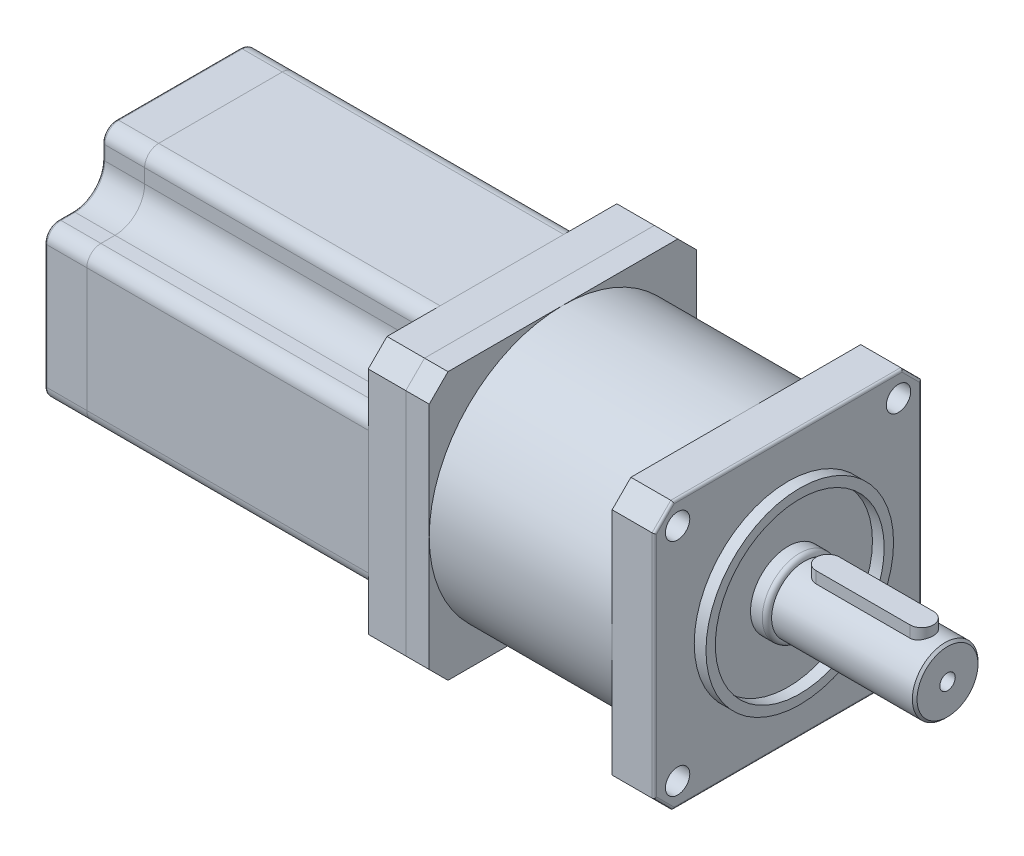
ISO-10303-21;
HEADER;
FILE_DESCRIPTION(('STEP AP214'),'2;1');
FILE_NAME('part.step','',(''),(''),'','','');
FILE_SCHEMA(('AUTOMOTIVE_DESIGN { 1 0 10303 214 1 1 1 1 }'));
ENDSEC;
DATA;
#1=APPLICATION_CONTEXT('core data for automotive mechanical design processes');
#2=APPLICATION_PROTOCOL_DEFINITION('international standard','automotive_design',2000,#1);
#3=PRODUCT_CONTEXT('',#1,'mechanical');
#4=PRODUCT('Part','Part','',(#3));
#5=PRODUCT_RELATED_PRODUCT_CATEGORY('part','',(#4));
#6=PRODUCT_DEFINITION_FORMATION('','',#4);
#7=PRODUCT_DEFINITION_CONTEXT('part definition',#1,'design');
#8=PRODUCT_DEFINITION('design','',#6,#7);
#9=PRODUCT_DEFINITION_SHAPE('','',#8);
#10=(LENGTH_UNIT() NAMED_UNIT(*) SI_UNIT(.MILLI.,.METRE.));
#11=(NAMED_UNIT(*) PLANE_ANGLE_UNIT() SI_UNIT($,.RADIAN.));
#12=(NAMED_UNIT(*) SI_UNIT($,.STERADIAN.) SOLID_ANGLE_UNIT());
#13=UNCERTAINTY_MEASURE_WITH_UNIT(LENGTH_MEASURE(1.E-05),#10,'distance_accuracy_value','');
#14=(GEOMETRIC_REPRESENTATION_CONTEXT(3) GLOBAL_UNCERTAINTY_ASSIGNED_CONTEXT((#13)) GLOBAL_UNIT_ASSIGNED_CONTEXT((#10,
#11,#12)) REPRESENTATION_CONTEXT('',''));
#15=CARTESIAN_POINT('',(0.,0.,0.));
#16=DIRECTION('',(0.,0.,1.));
#17=DIRECTION('',(1.,0.,0.));
#18=AXIS2_PLACEMENT_3D('',#15,#16,#17);
#19=CARTESIAN_POINT('',(28.5,9.,0.));
#20=DIRECTION('',(0.,-1.,0.));
#21=DIRECTION('',(0.,0.,-1.));
#22=AXIS2_PLACEMENT_3D('',#19,#20,#21);
#23=CYLINDRICAL_SURFACE('',#22,2.5);
#24=CARTESIAN_POINT('',(28.5,4.,0.));
#25=DIRECTION('',(0.,1.,0.));
#26=DIRECTION('',(0.,0.,1.));
#27=AXIS2_PLACEMENT_3D('',#24,#25,#26);
#28=CIRCLE('',#27,2.5);
#29=CARTESIAN_POINT('',(28.5,4.,2.5));
#30=VERTEX_POINT('',#29);
#31=CARTESIAN_POINT('',(28.5,4.,-2.5));
#32=VERTEX_POINT('',#31);
#33=EDGE_CURVE('E111',#30,#32,#28,.T.);
#34=ORIENTED_EDGE('',*,*,#33,.T.);
#35=DIRECTION('',(0.,-1.,0.));
#36=VECTOR('',#35,1.);
#37=CARTESIAN_POINT('',(28.5,9.,-2.5));
#38=LINE('',#37,#36);
#39=CARTESIAN_POINT('',(28.5,9.,-2.5));
#40=VERTEX_POINT('',#39);
#41=EDGE_CURVE('E12',#40,#32,#38,.T.);
#42=ORIENTED_EDGE('',*,*,#41,.F.);
#43=CARTESIAN_POINT('',(28.5,9.,0.));
#44=DIRECTION('',(0.,1.,0.));
#45=DIRECTION('',(0.,0.,1.));
#46=AXIS2_PLACEMENT_3D('',#43,#44,#45);
#47=CIRCLE('',#46,2.5);
#48=CARTESIAN_POINT('',(28.5,9.,2.5));
#49=VERTEX_POINT('',#48);
#50=EDGE_CURVE('E99',#49,#40,#47,.T.);
#51=ORIENTED_EDGE('',*,*,#50,.F.);
#52=DIRECTION('',(0.,-1.,0.));
#53=VECTOR('',#52,1.);
#54=CARTESIAN_POINT('',(28.5,9.,2.5));
#55=LINE('',#54,#53);
#56=EDGE_CURVE('E107',#49,#30,#55,.T.);
#57=ORIENTED_EDGE('',*,*,#56,.T.);
#58=EDGE_LOOP('',(#34,#42,#51,#57));
#59=FACE_BOUND('',#58,.T.);
#60=ADVANCED_FACE('F48',(#59),#23,.T.);
#61=CARTESIAN_POINT('',(28.5,9.,-2.5));
#62=DIRECTION('',(0.,0.,1.));
#63=DIRECTION('',(1.,0.,0.));
#64=AXIS2_PLACEMENT_3D('',#61,#62,#63);
#65=PLANE('',#64);
#66=DIRECTION('',(-1.,0.,0.));
#67=VECTOR('',#66,1.);
#68=CARTESIAN_POINT('',(28.5,4.,-2.5));
#69=LINE('',#68,#67);
#70=CARTESIAN_POINT('',(8.5,4.,-2.5));
#71=VERTEX_POINT('',#70);
#72=EDGE_CURVE('E103',#32,#71,#69,.T.);
#73=ORIENTED_EDGE('',*,*,#72,.T.);
#74=DIRECTION('',(0.,-1.,0.));
#75=VECTOR('',#74,1.);
#76=CARTESIAN_POINT('',(8.5,9.,-2.5));
#77=LINE('',#76,#75);
#78=CARTESIAN_POINT('',(8.5,9.,-2.5));
#79=VERTEX_POINT('',#78);
#80=EDGE_CURVE('E56',#79,#71,#77,.T.);
#81=ORIENTED_EDGE('',*,*,#80,.F.);
#82=DIRECTION('',(-1.,0.,0.));
#83=VECTOR('',#82,1.);
#84=CARTESIAN_POINT('',(28.5,9.,-2.5));
#85=LINE('',#84,#83);
#86=EDGE_CURVE('E94',#40,#79,#85,.T.);
#87=ORIENTED_EDGE('',*,*,#86,.F.);
#88=ORIENTED_EDGE('',*,*,#41,.T.);
#89=EDGE_LOOP('',(#73,#81,#87,#88));
#90=FACE_BOUND('',#89,.T.);
#91=ADVANCED_FACE('F102',(#90),#65,.F.);
#92=CARTESIAN_POINT('',(8.5,9.,0.));
#93=DIRECTION('',(0.,-1.,0.));
#94=DIRECTION('',(0.,0.,-1.));
#95=AXIS2_PLACEMENT_3D('',#92,#93,#94);
#96=CYLINDRICAL_SURFACE('',#95,2.5);
#97=CARTESIAN_POINT('',(8.5,4.,0.));
#98=DIRECTION('',(0.,1.,0.));
#99=DIRECTION('',(0.,0.,1.));
#100=AXIS2_PLACEMENT_3D('',#97,#98,#99);
#101=CIRCLE('',#100,2.5);
#102=CARTESIAN_POINT('',(8.5,4.,2.5));
#103=VERTEX_POINT('',#102);
#104=EDGE_CURVE('E81',#71,#103,#101,.T.);
#105=ORIENTED_EDGE('',*,*,#104,.T.);
#106=DIRECTION('',(0.,-1.,0.));
#107=VECTOR('',#106,1.);
#108=CARTESIAN_POINT('',(8.5,9.,2.5));
#109=LINE('',#108,#107);
#110=CARTESIAN_POINT('',(8.5,9.,2.5));
#111=VERTEX_POINT('',#110);
#112=EDGE_CURVE('E104',#111,#103,#109,.T.);
#113=ORIENTED_EDGE('',*,*,#112,.F.);
#114=CARTESIAN_POINT('',(8.5,9.,0.));
#115=DIRECTION('',(0.,1.,0.));
#116=DIRECTION('',(0.,0.,1.));
#117=AXIS2_PLACEMENT_3D('',#114,#115,#116);
#118=CIRCLE('',#117,2.5);
#119=EDGE_CURVE('E97',#79,#111,#118,.T.);
#120=ORIENTED_EDGE('',*,*,#119,.F.);
#121=ORIENTED_EDGE('',*,*,#80,.T.);
#122=EDGE_LOOP('',(#105,#113,#120,#121));
#123=FACE_BOUND('',#122,.T.);
#124=ADVANCED_FACE('F105',(#123),#96,.T.);
#125=CARTESIAN_POINT('',(8.5,9.,2.5));
#126=DIRECTION('',(0.,0.,-1.));
#127=DIRECTION('',(-1.,0.,0.));
#128=AXIS2_PLACEMENT_3D('',#125,#126,#127);
#129=PLANE('',#128);
#130=DIRECTION('',(1.,0.,0.));
#131=VECTOR('',#130,1.);
#132=CARTESIAN_POINT('',(8.5,4.,2.5));
#133=LINE('',#132,#131);
#134=EDGE_CURVE('E87',#103,#30,#133,.T.);
#135=ORIENTED_EDGE('',*,*,#134,.T.);
#136=ORIENTED_EDGE('',*,*,#56,.F.);
#137=DIRECTION('',(1.,0.,0.));
#138=VECTOR('',#137,1.);
#139=CARTESIAN_POINT('',(8.5,9.,2.5));
#140=LINE('',#139,#138);
#141=EDGE_CURVE('E64',#111,#49,#140,.T.);
#142=ORIENTED_EDGE('',*,*,#141,.F.);
#143=ORIENTED_EDGE('',*,*,#112,.T.);
#144=EDGE_LOOP('',(#135,#136,#142,#143));
#145=FACE_BOUND('',#144,.T.);
#146=ADVANCED_FACE('F118',(#145),#129,.F.);
#147=CARTESIAN_POINT('',(28.5,9.,0.));
#148=DIRECTION('',(0.,1.,0.));
#149=DIRECTION('',(0.,0.,1.));
#150=AXIS2_PLACEMENT_3D('',#147,#148,#149);
#151=PLANE('',#150);
#152=ORIENTED_EDGE('',*,*,#50,.T.);
#153=ORIENTED_EDGE('',*,*,#86,.T.);
#154=ORIENTED_EDGE('',*,*,#119,.T.);
#155=ORIENTED_EDGE('',*,*,#141,.T.);
#156=EDGE_LOOP('',(#152,#153,#154,#155));
#157=FACE_BOUND('',#156,.T.);
#158=ADVANCED_FACE('F95',(#157),#151,.T.);
#159=CARTESIAN_POINT('',(28.5,4.,0.));
#160=DIRECTION('',(0.,1.,0.));
#161=DIRECTION('',(0.,0.,1.));
#162=AXIS2_PLACEMENT_3D('',#159,#160,#161);
#163=PLANE('',#162);
#164=ORIENTED_EDGE('',*,*,#33,.F.);
#165=ORIENTED_EDGE('',*,*,#134,.F.);
#166=ORIENTED_EDGE('',*,*,#104,.F.);
#167=ORIENTED_EDGE('',*,*,#72,.F.);
#168=EDGE_LOOP('',(#164,#165,#166,#167));
#169=FACE_BOUND('',#168,.T.);
#170=ADVANCED_FACE('F121',(#169),#163,.F.);
#171=CLOSED_SHELL('',(#60,#91,#124,#146,#158,#170));
#172=MANIFOLD_SOLID_BREP('B2',#171);
#173=CARTESIAN_POINT('',(34.,0.,0.));
#174=DIRECTION('',(-1.,0.,0.));
#175=DIRECTION('',(0.,0.,1.));
#176=AXIS2_PLACEMENT_3D('',#173,#174,#175);
#177=CYLINDRICAL_SURFACE('',#176,7.);
#178=CARTESIAN_POINT('',(33.5,0.,0.));
#179=DIRECTION('',(1.,0.,0.));
#180=DIRECTION('',(0.,0.,-1.));
#181=AXIS2_PLACEMENT_3D('',#178,#179,#180);
#182=CIRCLE('',#181,7.);
#183=CARTESIAN_POINT('',(33.5,0.,-7.));
#184=VERTEX_POINT('',#183);
#185=EDGE_CURVE('E46',#184,#184,#182,.F.);
#186=ORIENTED_EDGE('',*,*,#185,.T.);
#187=EDGE_LOOP('',(#186));
#188=FACE_BOUND('',#187,.T.);
#189=DIRECTION('',(-1.,0.,0.));
#190=VECTOR('',#189,1.);
#191=CARTESIAN_POINT('',(34.,6.53834841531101,-2.5));
#192=LINE('',#191,#190);
#193=CARTESIAN_POINT('',(8.5,6.53834841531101,-2.5));
#194=VERTEX_POINT('',#193);
#195=CARTESIAN_POINT('',(28.5,6.53834841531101,-2.5));
#196=VERTEX_POINT('',#195);
#197=EDGE_CURVE('E205',#194,#196,#192,.F.);
#198=ORIENTED_EDGE('',*,*,#197,.T.);
#199=CARTESIAN_POINT('',(28.5,6.53834841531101,-2.5));
#200=CARTESIAN_POINT('',(28.5678892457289,6.53833653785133,-2.50000932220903));
#201=CARTESIAN_POINT('',(28.6357719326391,6.53940549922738,-2.49723485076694));
#202=CARTESIAN_POINT('',(28.7710039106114,6.54361657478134,-2.4861910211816));
#203=CARTESIAN_POINT('',(28.8383533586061,6.54675805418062,-2.47792334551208));
#204=CARTESIAN_POINT('',(28.9718214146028,6.55501217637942,-2.45600175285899));
#205=CARTESIAN_POINT('',(29.0379433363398,6.56011831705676,-2.44236559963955));
#206=CARTESIAN_POINT('',(29.1687018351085,6.57213177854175,-2.40985115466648));
#207=CARTESIAN_POINT('',(29.2333383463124,6.57903917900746,-2.39097263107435));
#208=CARTESIAN_POINT('',(29.4242643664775,6.6021493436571,-2.32673964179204));
#209=CARTESIAN_POINT('',(29.5477904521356,6.62075475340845,-2.27375112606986));
#210=CARTESIAN_POINT('',(29.784230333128,6.6622539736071,-2.14910757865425));
#211=CARTESIAN_POINT('',(29.8971363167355,6.68515090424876,-2.07743895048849));
#212=CARTESIAN_POINT('',(30.1142152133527,6.73379913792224,-1.91402571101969));
#213=CARTESIAN_POINT('',(30.2178464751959,6.75962864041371,-1.82158337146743));
#214=CARTESIAN_POINT('',(30.4085087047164,6.81057592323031,-1.6207338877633));
#215=CARTESIAN_POINT('',(30.4955365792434,6.83569357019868,-1.51232377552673));
#216=CARTESIAN_POINT('',(30.653089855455,6.88331133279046,-1.27853915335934));
#217=CARTESIAN_POINT('',(30.7230315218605,6.90570835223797,-1.15274833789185));
#218=CARTESIAN_POINT('',(30.8405366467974,6.94442357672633,-0.890250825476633));
#219=CARTESIAN_POINT('',(30.888107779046,6.96074386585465,-0.753547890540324));
#220=CARTESIAN_POINT('',(30.9576406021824,6.9849105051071,-0.478829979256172));
#221=CARTESIAN_POINT('',(30.9805391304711,6.99306594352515,-0.341079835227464));
#222=CARTESIAN_POINT('',(31.0030684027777,7.00108798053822,-0.0634643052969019));
#223=CARTESIAN_POINT('',(31.0027055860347,7.00095687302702,0.0764004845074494));
#224=CARTESIAN_POINT('',(30.9792887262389,6.99262258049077,0.347593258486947));
#225=CARTESIAN_POINT('',(30.9572552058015,6.98478243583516,0.479022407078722));
#226=CARTESIAN_POINT('',(30.8928265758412,6.96237832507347,0.736175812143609));
#227=CARTESIAN_POINT('',(30.8504303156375,6.94781397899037,0.861899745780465));
#228=CARTESIAN_POINT('',(30.7459530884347,6.91316506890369,1.10616102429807));
#229=CARTESIAN_POINT('',(30.6836042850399,6.89300592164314,1.22457279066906));
#230=CARTESIAN_POINT('',(30.5412206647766,6.8492335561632,1.44953531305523));
#231=CARTESIAN_POINT('',(30.4611804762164,6.82561928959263,1.5560824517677));
#232=CARTESIAN_POINT('',(30.2806767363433,6.7759054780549,1.7603244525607));
#233=CARTESIAN_POINT('',(30.1793502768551,6.74974055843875,1.85724185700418));
#234=CARTESIAN_POINT('',(29.9616726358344,6.69890342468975,2.03299914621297));
#235=CARTESIAN_POINT('',(29.8453160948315,6.67423174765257,2.11183255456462));
#236=CARTESIAN_POINT('',(29.598057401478,6.62877803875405,2.25049860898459));
#237=CARTESIAN_POINT('',(29.4669210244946,6.60807875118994,2.30994207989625));
#238=CARTESIAN_POINT('',(29.1956351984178,6.57388213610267,2.4055543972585));
#239=CARTESIAN_POINT('',(29.055500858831,6.56037307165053,2.44176119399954));
#240=CARTESIAN_POINT('',(28.8449694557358,6.54708542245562,2.47705497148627));
#241=CARTESIAN_POINT('',(28.7762636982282,6.54382010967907,2.48565347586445));
#242=CARTESIAN_POINT('',(28.6383848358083,6.53944910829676,2.49712352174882));
#243=CARTESIAN_POINT('',(28.5692123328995,6.53834103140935,2.50000139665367));
#244=CARTESIAN_POINT('',(28.5,6.53834841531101,2.5));
#245=B_SPLINE_CURVE_WITH_KNOTS('',3,(#199,#200,#201,#202,#203,#204,#205,#206,#207,#208,#209,
#210,#211,#212,#213,#214,#215,#216,#217,#218,#219,#220,#221,#222,#223,#224,#225,#226,#227,#228,
#229,#230,#231,#232,#233,#234,#235,#236,#237,#238,#239,#240,#241,#242,#243,#244),.UNSPECIFIED.,
.F.,.F.,(4,2,2,2,2,2,2,2,2,2,2,2,2,2,2,2,2,2,2,2,2,2,4),(0.,0.203591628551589,0.407120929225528,
0.609982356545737,0.812852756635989,1.21793118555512,1.6233052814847,2.0451597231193,
2.4670926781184,2.90188398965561,3.33652604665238,3.75400993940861,4.17137826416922,
4.56998920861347,4.96862268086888,5.37284909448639,5.77719841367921,6.20315837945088,
6.6292706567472,7.06347329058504,7.49696496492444,7.70468580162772,7.91217653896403),.UNSPECIFIED.);
#246=CARTESIAN_POINT('',(28.5,6.53834841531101,2.5));
#247=VERTEX_POINT('',#246);
#248=EDGE_CURVE('E263',#196,#247,#245,.T.);
#249=ORIENTED_EDGE('',*,*,#248,.T.);
#250=DIRECTION('',(-1.,0.,0.));
#251=VECTOR('',#250,1.);
#252=CARTESIAN_POINT('',(34.,6.53834841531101,2.5));
#253=LINE('',#252,#251);
#254=CARTESIAN_POINT('',(8.5,6.53834841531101,2.5));
#255=VERTEX_POINT('',#254);
#256=EDGE_CURVE('E310',#247,#255,#253,.T.);
#257=ORIENTED_EDGE('',*,*,#256,.T.);
#258=CARTESIAN_POINT('',(8.5,6.53834841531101,2.5));
#259=CARTESIAN_POINT('',(8.43211075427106,6.53833653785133,2.50000932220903));
#260=CARTESIAN_POINT('',(8.36422806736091,6.53940549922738,2.49723485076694));
#261=CARTESIAN_POINT('',(8.22899608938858,6.54361657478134,2.4861910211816));
#262=CARTESIAN_POINT('',(8.16164664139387,6.54675805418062,2.47792334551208));
#263=CARTESIAN_POINT('',(8.02817858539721,6.55501217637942,2.456001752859));
#264=CARTESIAN_POINT('',(7.96205666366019,6.56011831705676,2.44236559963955));
#265=CARTESIAN_POINT('',(7.83129816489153,6.57213177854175,2.40985115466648));
#266=CARTESIAN_POINT('',(7.76666165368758,6.57903917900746,2.39097263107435));
#267=CARTESIAN_POINT('',(7.57573563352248,6.6021493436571,2.32673964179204));
#268=CARTESIAN_POINT('',(7.45220954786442,6.62075475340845,2.27375112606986));
#269=CARTESIAN_POINT('',(7.21576966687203,6.6622539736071,2.14910757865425));
#270=CARTESIAN_POINT('',(7.10286368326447,6.68515090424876,2.07743895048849));
#271=CARTESIAN_POINT('',(6.88578478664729,6.73379913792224,1.9140257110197));
#272=CARTESIAN_POINT('',(6.78215352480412,6.75962864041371,1.82158337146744));
#273=CARTESIAN_POINT('',(6.59149129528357,6.81057592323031,1.6207338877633));
#274=CARTESIAN_POINT('',(6.50446342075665,6.83569357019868,1.51232377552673));
#275=CARTESIAN_POINT('',(6.34691014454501,6.88331133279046,1.27853915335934));
#276=CARTESIAN_POINT('',(6.27696847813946,6.90570835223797,1.15274833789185));
#277=CARTESIAN_POINT('',(6.15946335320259,6.94442357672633,0.890250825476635));
#278=CARTESIAN_POINT('',(6.11189222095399,6.96074386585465,0.753547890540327));
#279=CARTESIAN_POINT('',(6.04235939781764,6.9849105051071,0.478829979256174));
#280=CARTESIAN_POINT('',(6.01946086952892,6.99306594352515,0.341079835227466));
#281=CARTESIAN_POINT('',(5.99693159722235,7.00108798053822,0.0634643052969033));
#282=CARTESIAN_POINT('',(5.99729441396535,7.00095687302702,-0.0764004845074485));
#283=CARTESIAN_POINT('',(6.02071127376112,6.99262258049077,-0.347593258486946));
#284=CARTESIAN_POINT('',(6.04274479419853,6.98478243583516,-0.479022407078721));
#285=CARTESIAN_POINT('',(6.1071734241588,6.96237832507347,-0.736175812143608));
#286=CARTESIAN_POINT('',(6.14956968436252,6.94781397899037,-0.861899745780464));
#287=CARTESIAN_POINT('',(6.25404691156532,6.91316506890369,-1.10616102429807));
#288=CARTESIAN_POINT('',(6.31639571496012,6.89300592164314,-1.22457279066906));
#289=CARTESIAN_POINT('',(6.45877933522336,6.8492335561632,-1.44953531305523));
#290=CARTESIAN_POINT('',(6.53881952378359,6.82561928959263,-1.5560824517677));
#291=CARTESIAN_POINT('',(6.7193232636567,6.7759054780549,-1.7603244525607));
#292=CARTESIAN_POINT('',(6.8206497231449,6.74974055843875,-1.85724185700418));
#293=CARTESIAN_POINT('',(7.03832736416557,6.69890342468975,-2.03299914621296));
#294=CARTESIAN_POINT('',(7.15468390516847,6.67423174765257,-2.11183255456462));
#295=CARTESIAN_POINT('',(7.40194259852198,6.62877803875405,-2.25049860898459));
#296=CARTESIAN_POINT('',(7.53307897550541,6.60807875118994,-2.30994207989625));
#297=CARTESIAN_POINT('',(7.80436480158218,6.57388213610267,-2.4055543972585));
#298=CARTESIAN_POINT('',(7.94449914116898,6.56037307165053,-2.44176119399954));
#299=CARTESIAN_POINT('',(8.15503054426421,6.54708542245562,-2.47705497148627));
#300=CARTESIAN_POINT('',(8.22373630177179,6.54382010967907,-2.48565347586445));
#301=CARTESIAN_POINT('',(8.36161516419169,6.53944910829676,-2.49712352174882));
#302=CARTESIAN_POINT('',(8.43078766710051,6.53834103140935,-2.50000139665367));
#303=CARTESIAN_POINT('',(8.5,6.53834841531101,-2.5));
#304=B_SPLINE_CURVE_WITH_KNOTS('',3,(#258,#259,#260,#261,#262,#263,#264,#265,#266,#267,#268,
#269,#270,#271,#272,#273,#274,#275,#276,#277,#278,#279,#280,#281,#282,#283,#284,#285,#286,#287,
#288,#289,#290,#291,#292,#293,#294,#295,#296,#297,#298,#299,#300,#301,#302,#303),.UNSPECIFIED.,
.F.,.F.,(4,2,2,2,2,2,2,2,2,2,2,2,2,2,2,2,2,2,2,2,2,2,4),(0.,0.203591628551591,0.40712092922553,
0.609982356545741,0.812852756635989,1.21793118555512,1.6233052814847,2.0451597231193,
2.4670926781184,2.90188398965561,3.33652604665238,3.75400993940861,4.17137826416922,
4.56998920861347,4.96862268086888,5.37284909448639,5.77719841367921,6.20315837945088,
6.62927065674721,7.06347329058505,7.49696496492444,7.70468580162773,7.91217653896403),.UNSPECIFIED.);
#305=EDGE_CURVE('E197',#255,#194,#304,.T.);
#306=ORIENTED_EDGE('',*,*,#305,.T.);
#307=EDGE_LOOP('',(#198,#249,#257,#306));
#308=FACE_BOUND('',#307,.T.);
#309=CARTESIAN_POINT('',(3.5,0.,0.));
#310=DIRECTION('',(1.,0.,0.));
#311=DIRECTION('',(0.,0.,-1.));
#312=AXIS2_PLACEMENT_3D('',#309,#310,#311);
#313=CIRCLE('',#312,7.);
#314=CARTESIAN_POINT('',(3.5,0.,-7.));
#315=VERTEX_POINT('',#314);
#316=EDGE_CURVE('E254',#315,#315,#313,.T.);
#317=ORIENTED_EDGE('',*,*,#316,.T.);
#318=EDGE_LOOP('',(#317));
#319=FACE_BOUND('',#318,.T.);
#320=ADVANCED_FACE('F182',(#188,#308,#319),#177,.T.);
#321=CARTESIAN_POINT('',(34.,0.,0.));
#322=DIRECTION('',(1.,0.,0.));
#323=DIRECTION('',(0.,0.,-1.));
#324=AXIS2_PLACEMENT_3D('',#321,#322,#323);
#325=PLANE('',#324);
#326=CARTESIAN_POINT('',(34.,0.,0.));
#327=DIRECTION('',(1.,0.,0.));
#328=DIRECTION('',(0.,0.,-1.));
#329=AXIS2_PLACEMENT_3D('',#326,#327,#328);
#330=CIRCLE('',#329,1.64999999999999);
#331=CARTESIAN_POINT('',(34.,0.,-1.64999999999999));
#332=VERTEX_POINT('',#331);
#333=EDGE_CURVE('E235',#332,#332,#330,.T.);
#334=ORIENTED_EDGE('',*,*,#333,.F.);
#335=EDGE_LOOP('',(#334));
#336=FACE_BOUND('',#335,.T.);
#337=CARTESIAN_POINT('',(34.,0.,0.));
#338=DIRECTION('',(1.,0.,0.));
#339=DIRECTION('',(0.,0.,-1.));
#340=AXIS2_PLACEMENT_3D('',#337,#338,#339);
#341=CIRCLE('',#340,6.50000000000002);
#342=CARTESIAN_POINT('',(34.,0.,-6.50000000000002));
#343=VERTEX_POINT('',#342);
#344=EDGE_CURVE('E190',#343,#343,#341,.T.);
#345=ORIENTED_EDGE('',*,*,#344,.T.);
#346=EDGE_LOOP('',(#345));
#347=FACE_BOUND('',#346,.T.);
#348=ADVANCED_FACE('F294',(#336,#347),#325,.T.);
#349=CARTESIAN_POINT('',(3.5,0.,0.));
#350=DIRECTION('',(1.,0.,0.));
#351=DIRECTION('',(0.,0.,-1.));
#352=AXIS2_PLACEMENT_3D('',#349,#350,#351);
#353=PLANE('',#352);
#354=ORIENTED_EDGE('',*,*,#316,.F.);
#355=EDGE_LOOP('',(#354));
#356=FACE_BOUND('',#355,.T.);
#357=ADVANCED_FACE('F293',(#356),#353,.F.);
#358=CARTESIAN_POINT('',(8.5,4.,0.));
#359=DIRECTION('',(0.,1.,0.));
#360=DIRECTION('',(0.,0.,1.));
#361=AXIS2_PLACEMENT_3D('',#358,#359,#360);
#362=CYLINDRICAL_SURFACE('',#361,2.5);
#363=DIRECTION('',(0.,1.,0.));
#364=VECTOR('',#363,1.);
#365=CARTESIAN_POINT('',(8.5,4.,2.5));
#366=LINE('',#365,#364);
#367=CARTESIAN_POINT('',(8.5,4.,2.5));
#368=VERTEX_POINT('',#367);
#369=EDGE_CURVE('E251',#368,#255,#366,.T.);
#370=ORIENTED_EDGE('',*,*,#369,.F.);
#371=CARTESIAN_POINT('',(8.5,4.,0.));
#372=DIRECTION('',(0.,1.,0.));
#373=DIRECTION('',(0.,0.,1.));
#374=AXIS2_PLACEMENT_3D('',#371,#372,#373);
#375=CIRCLE('',#374,2.5);
#376=CARTESIAN_POINT('',(8.5,4.,-2.5));
#377=VERTEX_POINT('',#376);
#378=EDGE_CURVE('E234',#377,#368,#375,.T.);
#379=ORIENTED_EDGE('',*,*,#378,.F.);
#380=DIRECTION('',(0.,1.,0.));
#381=VECTOR('',#380,1.);
#382=CARTESIAN_POINT('',(8.5,4.,-2.5));
#383=LINE('',#382,#381);
#384=EDGE_CURVE('E252',#377,#194,#383,.T.);
#385=ORIENTED_EDGE('',*,*,#384,.T.);
#386=ORIENTED_EDGE('',*,*,#305,.F.);
#387=EDGE_LOOP('',(#370,#379,#385,#386));
#388=FACE_BOUND('',#387,.T.);
#389=ADVANCED_FACE('F289',(#388),#362,.F.);
#390=CARTESIAN_POINT('',(8.5,4.,-2.5));
#391=DIRECTION('',(0.,0.,-1.));
#392=DIRECTION('',(-1.,0.,0.));
#393=AXIS2_PLACEMENT_3D('',#390,#391,#392);
#394=PLANE('',#393);
#395=ORIENTED_EDGE('',*,*,#384,.F.);
#396=DIRECTION('',(-1.,0.,0.));
#397=VECTOR('',#396,1.);
#398=CARTESIAN_POINT('',(8.5,4.,-2.5));
#399=LINE('',#398,#397);
#400=CARTESIAN_POINT('',(28.5,4.,-2.5));
#401=VERTEX_POINT('',#400);
#402=EDGE_CURVE('E248',#401,#377,#399,.T.);
#403=ORIENTED_EDGE('',*,*,#402,.F.);
#404=DIRECTION('',(0.,1.,0.));
#405=VECTOR('',#404,1.);
#406=CARTESIAN_POINT('',(28.5,4.,-2.5));
#407=LINE('',#406,#405);
#408=EDGE_CURVE('E255',#401,#196,#407,.T.);
#409=ORIENTED_EDGE('',*,*,#408,.T.);
#410=ORIENTED_EDGE('',*,*,#197,.F.);
#411=EDGE_LOOP('',(#395,#403,#409,#410));
#412=FACE_BOUND('',#411,.T.);
#413=ADVANCED_FACE('F283',(#412),#394,.F.);
#414=CARTESIAN_POINT('',(28.5,4.,0.));
#415=DIRECTION('',(0.,1.,0.));
#416=DIRECTION('',(0.,0.,1.));
#417=AXIS2_PLACEMENT_3D('',#414,#415,#416);
#418=CYLINDRICAL_SURFACE('',#417,2.5);
#419=ORIENTED_EDGE('',*,*,#408,.F.);
#420=CARTESIAN_POINT('',(28.5,4.,0.));
#421=DIRECTION('',(0.,1.,0.));
#422=DIRECTION('',(0.,0.,1.));
#423=AXIS2_PLACEMENT_3D('',#420,#421,#422);
#424=CIRCLE('',#423,2.5);
#425=CARTESIAN_POINT('',(28.5,4.,2.5));
#426=VERTEX_POINT('',#425);
#427=EDGE_CURVE('E245',#426,#401,#424,.T.);
#428=ORIENTED_EDGE('',*,*,#427,.F.);
#429=DIRECTION('',(0.,1.,0.));
#430=VECTOR('',#429,1.);
#431=CARTESIAN_POINT('',(28.5,4.,2.5));
#432=LINE('',#431,#430);
#433=EDGE_CURVE('E257',#426,#247,#432,.T.);
#434=ORIENTED_EDGE('',*,*,#433,.T.);
#435=ORIENTED_EDGE('',*,*,#248,.F.);
#436=EDGE_LOOP('',(#419,#428,#434,#435));
#437=FACE_BOUND('',#436,.T.);
#438=ADVANCED_FACE('F277',(#437),#418,.F.);
#439=CARTESIAN_POINT('',(28.5,4.,2.5));
#440=DIRECTION('',(0.,0.,1.));
#441=DIRECTION('',(1.,0.,0.));
#442=AXIS2_PLACEMENT_3D('',#439,#440,#441);
#443=PLANE('',#442);
#444=ORIENTED_EDGE('',*,*,#433,.F.);
#445=DIRECTION('',(1.,0.,0.));
#446=VECTOR('',#445,1.);
#447=CARTESIAN_POINT('',(28.5,4.,2.5));
#448=LINE('',#447,#446);
#449=EDGE_CURVE('E238',#368,#426,#448,.T.);
#450=ORIENTED_EDGE('',*,*,#449,.F.);
#451=ORIENTED_EDGE('',*,*,#369,.T.);
#452=ORIENTED_EDGE('',*,*,#256,.F.);
#453=EDGE_LOOP('',(#444,#450,#451,#452));
#454=FACE_BOUND('',#453,.T.);
#455=ADVANCED_FACE('F282',(#454),#443,.F.);
#456=CARTESIAN_POINT('',(8.5,4.,0.));
#457=DIRECTION('',(0.,1.,0.));
#458=DIRECTION('',(0.,0.,1.));
#459=AXIS2_PLACEMENT_3D('',#456,#457,#458);
#460=PLANE('',#459);
#461=ORIENTED_EDGE('',*,*,#378,.T.);
#462=ORIENTED_EDGE('',*,*,#449,.T.);
#463=ORIENTED_EDGE('',*,*,#427,.T.);
#464=ORIENTED_EDGE('',*,*,#402,.T.);
#465=EDGE_LOOP('',(#461,#462,#463,#464));
#466=FACE_BOUND('',#465,.T.);
#467=ADVANCED_FACE('F287',(#466),#460,.T.);
#468=CARTESIAN_POINT('',(34.,0.,0.));
#469=DIRECTION('',(-1.,0.,0.));
#470=DIRECTION('',(0.,0.,1.));
#471=AXIS2_PLACEMENT_3D('',#468,#469,#470);
#472=CONICAL_SURFACE('',#471,6.50000000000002,0.785398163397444);
#473=ORIENTED_EDGE('',*,*,#185,.F.);
#474=EDGE_LOOP('',(#473));
#475=FACE_BOUND('',#474,.T.);
#476=ORIENTED_EDGE('',*,*,#344,.F.);
#477=EDGE_LOOP('',(#476));
#478=FACE_BOUND('',#477,.T.);
#479=ADVANCED_FACE('F184',(#475,#478),#472,.T.);
#480=CARTESIAN_POINT('',(24.5,0.,0.));
#481=DIRECTION('',(1.,0.,0.));
#482=DIRECTION('',(0.,0.,-1.));
#483=AXIS2_PLACEMENT_3D('',#480,#481,#482);
#484=CONICAL_SURFACE('',#483,1.65,1.02974425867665);
#485=CARTESIAN_POINT('',(23.5085799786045,0.,0.));
#486=VERTEX_POINT('',#485);
#487=VERTEX_LOOP('',#486);
#488=FACE_BOUND('',#487,.T.);
#489=CARTESIAN_POINT('',(24.5,0.,0.));
#490=DIRECTION('',(1.,0.,0.));
#491=DIRECTION('',(0.,0.,-1.));
#492=AXIS2_PLACEMENT_3D('',#489,#490,#491);
#493=CIRCLE('',#492,1.65);
#494=CARTESIAN_POINT('',(24.5,0.,-1.65));
#495=VERTEX_POINT('',#494);
#496=EDGE_CURVE('E232',#495,#495,#493,.T.);
#497=ORIENTED_EDGE('',*,*,#496,.T.);
#498=EDGE_LOOP('',(#497));
#499=FACE_BOUND('',#498,.T.);
#500=ADVANCED_FACE('F225',(#488,#499),#484,.F.);
#501=CARTESIAN_POINT('',(34.,0.,0.));
#502=DIRECTION('',(1.,0.,0.));
#503=DIRECTION('',(0.,0.,-1.));
#504=AXIS2_PLACEMENT_3D('',#501,#502,#503);
#505=CYLINDRICAL_SURFACE('',#504,1.64999999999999);
#506=ORIENTED_EDGE('',*,*,#496,.F.);
#507=EDGE_LOOP('',(#506));
#508=FACE_BOUND('',#507,.T.);
#509=ORIENTED_EDGE('',*,*,#333,.T.);
#510=EDGE_LOOP('',(#509));
#511=FACE_BOUND('',#510,.T.);
#512=ADVANCED_FACE('F228',(#508,#511),#505,.F.);
#513=CLOSED_SHELL('',(#320,#348,#357,#389,#413,#438,#455,#467,#479,#500,#512));
#514=MANIFOLD_SOLID_BREP('B6',#513);
#515=CARTESIAN_POINT('',(-130.,-24.5,-28.5));
#516=DIRECTION('',(0.,0.,1.));
#517=DIRECTION('',(1.,0.,0.));
#518=AXIS2_PLACEMENT_3D('',#515,#516,#517);
#519=PLANE('',#518);
#520=DIRECTION('',(-1.,0.,0.));
#521=VECTOR('',#520,1.);
#522=CARTESIAN_POINT('',(-61.,-13.1754446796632,-28.5));
#523=LINE('',#522,#521);
#524=CARTESIAN_POINT('',(-121.,-13.1754446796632,-28.5));
#525=VERTEX_POINT('',#524);
#526=CARTESIAN_POINT('',(-129.5,-13.1754446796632,-28.5));
#527=VERTEX_POINT('',#526);
#528=EDGE_CURVE('E908',#525,#527,#523,.T.);
#529=ORIENTED_EDGE('',*,*,#528,.T.);
#530=DIRECTION('',(0.,-1.,0.));
#531=VECTOR('',#530,1.);
#532=CARTESIAN_POINT('',(-129.5,13.1754446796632,-28.5));
#533=LINE('',#532,#531);
#534=CARTESIAN_POINT('',(-129.5,13.1754446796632,-28.5));
#535=VERTEX_POINT('',#534);
#536=EDGE_CURVE('E807',#527,#535,#533,.F.);
#537=ORIENTED_EDGE('',*,*,#536,.T.);
#538=DIRECTION('',(-1.,0.,0.));
#539=VECTOR('',#538,1.);
#540=CARTESIAN_POINT('',(-61.,13.1754446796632,-28.5));
#541=LINE('',#540,#539);
#542=CARTESIAN_POINT('',(-121.,13.1754446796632,-28.5));
#543=VERTEX_POINT('',#542);
#544=EDGE_CURVE('E980',#543,#535,#541,.T.);
#545=ORIENTED_EDGE('',*,*,#544,.F.);
#546=DIRECTION('',(0.,-1.,0.));
#547=VECTOR('',#546,1.);
#548=CARTESIAN_POINT('',(-121.,-24.5,-28.5));
#549=LINE('',#548,#547);
#550=EDGE_CURVE('E950',#543,#525,#549,.T.);
#551=ORIENTED_EDGE('',*,*,#550,.T.);
#552=EDGE_LOOP('',(#529,#537,#545,#551));
#553=FACE_BOUND('',#552,.T.);
#554=ADVANCED_FACE('F409',(#553),#519,.F.);
#555=CARTESIAN_POINT('',(-130.,-28.5,-24.5));
#556=DIRECTION('',(0.,1.,0.));
#557=DIRECTION('',(0.,0.,1.));
#558=AXIS2_PLACEMENT_3D('',#555,#556,#557);
#559=PLANE('',#558);
#560=DIRECTION('',(-1.,0.,0.));
#561=VECTOR('',#560,1.);
#562=CARTESIAN_POINT('',(-61.,-28.5,13.1754446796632));
#563=LINE('',#562,#561);
#564=CARTESIAN_POINT('',(-121.,-28.5,13.1754446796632));
#565=VERTEX_POINT('',#564);
#566=CARTESIAN_POINT('',(-129.5,-28.5,13.1754446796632));
#567=VERTEX_POINT('',#566);
#568=EDGE_CURVE('E902',#565,#567,#563,.T.);
#569=ORIENTED_EDGE('',*,*,#568,.T.);
#570=DIRECTION('',(0.,0.,1.));
#571=VECTOR('',#570,1.);
#572=CARTESIAN_POINT('',(-129.5,-28.5,-13.1754446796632));
#573=LINE('',#572,#571);
#574=CARTESIAN_POINT('',(-129.5,-28.5,-13.1754446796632));
#575=VERTEX_POINT('',#574);
#576=EDGE_CURVE('E795',#567,#575,#573,.F.);
#577=ORIENTED_EDGE('',*,*,#576,.T.);
#578=DIRECTION('',(-1.,0.,0.));
#579=VECTOR('',#578,1.);
#580=CARTESIAN_POINT('',(-61.,-28.5,-13.1754446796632));
#581=LINE('',#580,#579);
#582=CARTESIAN_POINT('',(-121.,-28.5,-13.1754446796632));
#583=VERTEX_POINT('',#582);
#584=EDGE_CURVE('E900',#583,#575,#581,.T.);
#585=ORIENTED_EDGE('',*,*,#584,.F.);
#586=DIRECTION('',(0.,0.,1.));
#587=VECTOR('',#586,1.);
#588=CARTESIAN_POINT('',(-121.,-28.5,-24.5));
#589=LINE('',#588,#587);
#590=EDGE_CURVE('E953',#583,#565,#589,.T.);
#591=ORIENTED_EDGE('',*,*,#590,.T.);
#592=EDGE_LOOP('',(#569,#577,#585,#591));
#593=FACE_BOUND('',#592,.T.);
#594=ADVANCED_FACE('F898',(#593),#559,.F.);
#595=CARTESIAN_POINT('',(-130.,-24.5,28.5));
#596=DIRECTION('',(0.,0.,-1.));
#597=DIRECTION('',(0.,1.,0.));
#598=AXIS2_PLACEMENT_3D('',#595,#596,#597);
#599=PLANE('',#598);
#600=DIRECTION('',(-1.,0.,0.));
#601=VECTOR('',#600,1.);
#602=CARTESIAN_POINT('',(-61.,13.1754446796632,28.5));
#603=LINE('',#602,#601);
#604=CARTESIAN_POINT('',(-121.,13.1754446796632,28.5));
#605=VERTEX_POINT('',#604);
#606=CARTESIAN_POINT('',(-129.5,13.1754446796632,28.5));
#607=VERTEX_POINT('',#606);
#608=EDGE_CURVE('E946',#605,#607,#603,.T.);
#609=ORIENTED_EDGE('',*,*,#608,.T.);
#610=DIRECTION('',(0.,1.,0.));
#611=VECTOR('',#610,1.);
#612=CARTESIAN_POINT('',(-129.5,-13.1754446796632,28.5));
#613=LINE('',#612,#611);
#614=CARTESIAN_POINT('',(-129.5,-13.1754446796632,28.5));
#615=VERTEX_POINT('',#614);
#616=EDGE_CURVE('E783',#607,#615,#613,.F.);
#617=ORIENTED_EDGE('',*,*,#616,.T.);
#618=DIRECTION('',(-1.,0.,0.));
#619=VECTOR('',#618,1.);
#620=CARTESIAN_POINT('',(-61.,-13.1754446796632,28.5));
#621=LINE('',#620,#619);
#622=CARTESIAN_POINT('',(-121.,-13.1754446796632,28.5));
#623=VERTEX_POINT('',#622);
#624=EDGE_CURVE('E928',#623,#615,#621,.T.);
#625=ORIENTED_EDGE('',*,*,#624,.F.);
#626=DIRECTION('',(0.,1.,0.));
#627=VECTOR('',#626,1.);
#628=CARTESIAN_POINT('',(-121.,-24.5,28.5));
#629=LINE('',#628,#627);
#630=EDGE_CURVE('E956',#623,#605,#629,.T.);
#631=ORIENTED_EDGE('',*,*,#630,.T.);
#632=EDGE_LOOP('',(#609,#617,#625,#631));
#633=FACE_BOUND('',#632,.T.);
#634=ADVANCED_FACE('F1094',(#633),#599,.F.);
#635=CARTESIAN_POINT('',(-130.,28.5,-24.5));
#636=DIRECTION('',(0.,-1.,0.));
#637=DIRECTION('',(0.,0.,-1.));
#638=AXIS2_PLACEMENT_3D('',#635,#636,#637);
#639=PLANE('',#638);
#640=DIRECTION('',(-1.,0.,0.));
#641=VECTOR('',#640,1.);
#642=CARTESIAN_POINT('',(-61.,28.5,-13.1754446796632));
#643=LINE('',#642,#641);
#644=CARTESIAN_POINT('',(-121.,28.5,-13.1754446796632));
#645=VERTEX_POINT('',#644);
#646=CARTESIAN_POINT('',(-129.5,28.5,-13.1754446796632));
#647=VERTEX_POINT('',#646);
#648=EDGE_CURVE('E965',#645,#647,#643,.T.);
#649=ORIENTED_EDGE('',*,*,#648,.T.);
#650=DIRECTION('',(0.,0.,-1.));
#651=VECTOR('',#650,1.);
#652=CARTESIAN_POINT('',(-129.5,28.5,13.1754446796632));
#653=LINE('',#652,#651);
#654=CARTESIAN_POINT('',(-129.5,28.5,13.1754446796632));
#655=VERTEX_POINT('',#654);
#656=EDGE_CURVE('E771',#647,#655,#653,.F.);
#657=ORIENTED_EDGE('',*,*,#656,.T.);
#658=DIRECTION('',(-1.,0.,0.));
#659=VECTOR('',#658,1.);
#660=CARTESIAN_POINT('',(-61.,28.5,13.1754446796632));
#661=LINE('',#660,#659);
#662=CARTESIAN_POINT('',(-121.,28.5,13.1754446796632));
#663=VERTEX_POINT('',#662);
#664=EDGE_CURVE('E943',#663,#655,#661,.T.);
#665=ORIENTED_EDGE('',*,*,#664,.F.);
#666=DIRECTION('',(0.,0.,-1.));
#667=VECTOR('',#666,1.);
#668=CARTESIAN_POINT('',(-121.,28.5,-24.5));
#669=LINE('',#668,#667);
#670=EDGE_CURVE('E657',#663,#645,#669,.T.);
#671=ORIENTED_EDGE('',*,*,#670,.T.);
#672=EDGE_LOOP('',(#649,#657,#665,#671));
#673=FACE_BOUND('',#672,.T.);
#674=ADVANCED_FACE('F964',(#673),#639,.F.);
#675=CARTESIAN_POINT('',(-130.,0.,0.));
#676=DIRECTION('',(-1.,0.,0.));
#677=DIRECTION('',(0.,0.,1.));
#678=AXIS2_PLACEMENT_3D('',#675,#676,#677);
#679=PLANE('',#678);
#680=CARTESIAN_POINT('',(-130.,25.5,13.1754446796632));
#681=DIRECTION('',(-1.,0.,0.));
#682=DIRECTION('',(0.,0.,1.));
#683=AXIS2_PLACEMENT_3D('',#680,#681,#682);
#684=CIRCLE('',#683,2.5);
#685=CARTESIAN_POINT('',(-130.,25.5,15.6754446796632));
#686=VERTEX_POINT('',#685);
#687=CARTESIAN_POINT('',(-130.,28.,13.1754446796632));
#688=VERTEX_POINT('',#687);
#689=EDGE_CURVE('E766',#686,#688,#684,.T.);
#690=ORIENTED_EDGE('',*,*,#689,.T.);
#691=DIRECTION('',(0.,0.,-1.));
#692=VECTOR('',#691,1.);
#693=CARTESIAN_POINT('',(-130.,28.,-13.1754446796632));
#694=LINE('',#693,#692);
#695=CARTESIAN_POINT('',(-130.,28.,-13.1754446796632));
#696=VERTEX_POINT('',#695);
#697=EDGE_CURVE('E768',#688,#696,#694,.T.);
#698=ORIENTED_EDGE('',*,*,#697,.T.);
#699=CARTESIAN_POINT('',(-130.,25.5,-13.1754446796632));
#700=DIRECTION('',(-1.,0.,0.));
#701=DIRECTION('',(0.,0.,1.));
#702=AXIS2_PLACEMENT_3D('',#699,#700,#701);
#703=CIRCLE('',#702,2.5);
#704=CARTESIAN_POINT('',(-130.,25.5,-15.6754446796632));
#705=VERTEX_POINT('',#704);
#706=EDGE_CURVE('E722',#696,#705,#703,.T.);
#707=ORIENTED_EDGE('',*,*,#706,.T.);
#708=DIRECTION('',(0.,1.,0.));
#709=VECTOR('',#708,1.);
#710=CARTESIAN_POINT('',(-130.,22.5,-15.6754446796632));
#711=LINE('',#710,#709);
#712=CARTESIAN_POINT('',(-130.,22.5,-15.6754446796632));
#713=VERTEX_POINT('',#712);
#714=EDGE_CURVE('E724',#705,#713,#711,.F.);
#715=ORIENTED_EDGE('',*,*,#714,.T.);
#716=CARTESIAN_POINT('',(-130.,22.5,-22.5));
#717=DIRECTION('',(-1.,0.,0.));
#718=DIRECTION('',(0.,0.,1.));
#719=AXIS2_PLACEMENT_3D('',#716,#717,#718);
#720=CIRCLE('',#719,6.82455532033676);
#721=CARTESIAN_POINT('',(-130.,15.6754446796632,-22.5));
#722=VERTEX_POINT('',#721);
#723=EDGE_CURVE('E726',#713,#722,#720,.F.);
#724=ORIENTED_EDGE('',*,*,#723,.T.);
#725=DIRECTION('',(0.,0.,1.));
#726=VECTOR('',#725,1.);
#727=CARTESIAN_POINT('',(-130.,15.6754446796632,-25.5));
#728=LINE('',#727,#726);
#729=CARTESIAN_POINT('',(-130.,15.6754446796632,-25.5));
#730=VERTEX_POINT('',#729);
#731=EDGE_CURVE('E728',#722,#730,#728,.F.);
#732=ORIENTED_EDGE('',*,*,#731,.T.);
#733=CARTESIAN_POINT('',(-130.,13.1754446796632,-25.5));
#734=DIRECTION('',(-1.,0.,0.));
#735=DIRECTION('',(0.,0.,1.));
#736=AXIS2_PLACEMENT_3D('',#733,#734,#735);
#737=CIRCLE('',#736,2.5);
#738=CARTESIAN_POINT('',(-130.,13.1754446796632,-28.));
#739=VERTEX_POINT('',#738);
#740=EDGE_CURVE('E730',#730,#739,#737,.T.);
#741=ORIENTED_EDGE('',*,*,#740,.T.);
#742=DIRECTION('',(0.,-1.,0.));
#743=VECTOR('',#742,1.);
#744=CARTESIAN_POINT('',(-130.,-13.1754446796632,-28.));
#745=LINE('',#744,#743);
#746=CARTESIAN_POINT('',(-130.,-13.1754446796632,-28.));
#747=VERTEX_POINT('',#746);
#748=EDGE_CURVE('E732',#739,#747,#745,.T.);
#749=ORIENTED_EDGE('',*,*,#748,.T.);
#750=CARTESIAN_POINT('',(-130.,-13.1754446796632,-25.5));
#751=DIRECTION('',(-1.,0.,0.));
#752=DIRECTION('',(0.,0.,1.));
#753=AXIS2_PLACEMENT_3D('',#750,#751,#752);
#754=CIRCLE('',#753,2.5);
#755=CARTESIAN_POINT('',(-130.,-15.6754446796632,-25.5));
#756=VERTEX_POINT('',#755);
#757=EDGE_CURVE('E734',#747,#756,#754,.T.);
#758=ORIENTED_EDGE('',*,*,#757,.T.);
#759=DIRECTION('',(0.,0.,-1.));
#760=VECTOR('',#759,1.);
#761=CARTESIAN_POINT('',(-130.,-15.6754446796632,-22.5));
#762=LINE('',#761,#760);
#763=CARTESIAN_POINT('',(-130.,-15.6754446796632,-22.5));
#764=VERTEX_POINT('',#763);
#765=EDGE_CURVE('E736',#756,#764,#762,.F.);
#766=ORIENTED_EDGE('',*,*,#765,.T.);
#767=CARTESIAN_POINT('',(-130.,-22.5,-22.5));
#768=DIRECTION('',(-1.,0.,0.));
#769=DIRECTION('',(0.,0.,1.));
#770=AXIS2_PLACEMENT_3D('',#767,#768,#769);
#771=CIRCLE('',#770,6.82455532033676);
#772=CARTESIAN_POINT('',(-130.,-22.5,-15.6754446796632));
#773=VERTEX_POINT('',#772);
#774=EDGE_CURVE('E738',#764,#773,#771,.F.);
#775=ORIENTED_EDGE('',*,*,#774,.T.);
#776=DIRECTION('',(0.,1.,0.));
#777=VECTOR('',#776,1.);
#778=CARTESIAN_POINT('',(-130.,-25.5,-15.6754446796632));
#779=LINE('',#778,#777);
#780=CARTESIAN_POINT('',(-130.,-25.5,-15.6754446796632));
#781=VERTEX_POINT('',#780);
#782=EDGE_CURVE('E740',#773,#781,#779,.F.);
#783=ORIENTED_EDGE('',*,*,#782,.T.);
#784=CARTESIAN_POINT('',(-130.,-25.5,-13.1754446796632));
#785=DIRECTION('',(-1.,0.,0.));
#786=DIRECTION('',(0.,0.,1.));
#787=AXIS2_PLACEMENT_3D('',#784,#785,#786);
#788=CIRCLE('',#787,2.5);
#789=CARTESIAN_POINT('',(-130.,-28.,-13.1754446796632));
#790=VERTEX_POINT('',#789);
#791=EDGE_CURVE('E742',#781,#790,#788,.T.);
#792=ORIENTED_EDGE('',*,*,#791,.T.);
#793=DIRECTION('',(0.,0.,1.));
#794=VECTOR('',#793,1.);
#795=CARTESIAN_POINT('',(-130.,-28.,13.1754446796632));
#796=LINE('',#795,#794);
#797=CARTESIAN_POINT('',(-130.,-28.,13.1754446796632));
#798=VERTEX_POINT('',#797);
#799=EDGE_CURVE('E744',#790,#798,#796,.T.);
#800=ORIENTED_EDGE('',*,*,#799,.T.);
#801=CARTESIAN_POINT('',(-130.,-25.5,13.1754446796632));
#802=DIRECTION('',(-1.,0.,0.));
#803=DIRECTION('',(0.,0.,1.));
#804=AXIS2_PLACEMENT_3D('',#801,#802,#803);
#805=CIRCLE('',#804,2.5);
#806=CARTESIAN_POINT('',(-130.,-25.5,15.6754446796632));
#807=VERTEX_POINT('',#806);
#808=EDGE_CURVE('E746',#798,#807,#805,.T.);
#809=ORIENTED_EDGE('',*,*,#808,.T.);
#810=DIRECTION('',(0.,-1.,0.));
#811=VECTOR('',#810,1.);
#812=CARTESIAN_POINT('',(-130.,-22.5,15.6754446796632));
#813=LINE('',#812,#811);
#814=CARTESIAN_POINT('',(-130.,-22.5,15.6754446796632));
#815=VERTEX_POINT('',#814);
#816=EDGE_CURVE('E748',#807,#815,#813,.F.);
#817=ORIENTED_EDGE('',*,*,#816,.T.);
#818=CARTESIAN_POINT('',(-130.,-22.5,22.5));
#819=DIRECTION('',(-1.,0.,0.));
#820=DIRECTION('',(0.,0.,1.));
#821=AXIS2_PLACEMENT_3D('',#818,#819,#820);
#822=CIRCLE('',#821,6.82455532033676);
#823=CARTESIAN_POINT('',(-130.,-15.6754446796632,22.5));
#824=VERTEX_POINT('',#823);
#825=EDGE_CURVE('E750',#815,#824,#822,.F.);
#826=ORIENTED_EDGE('',*,*,#825,.T.);
#827=DIRECTION('',(0.,0.,-1.));
#828=VECTOR('',#827,1.);
#829=CARTESIAN_POINT('',(-130.,-15.6754446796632,25.5));
#830=LINE('',#829,#828);
#831=CARTESIAN_POINT('',(-130.,-15.6754446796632,25.5));
#832=VERTEX_POINT('',#831);
#833=EDGE_CURVE('E752',#824,#832,#830,.F.);
#834=ORIENTED_EDGE('',*,*,#833,.T.);
#835=CARTESIAN_POINT('',(-130.,-13.1754446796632,25.5));
#836=DIRECTION('',(-1.,0.,0.));
#837=DIRECTION('',(0.,0.,1.));
#838=AXIS2_PLACEMENT_3D('',#835,#836,#837);
#839=CIRCLE('',#838,2.5);
#840=CARTESIAN_POINT('',(-130.,-13.1754446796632,28.));
#841=VERTEX_POINT('',#840);
#842=EDGE_CURVE('E754',#832,#841,#839,.T.);
#843=ORIENTED_EDGE('',*,*,#842,.T.);
#844=DIRECTION('',(0.,1.,0.));
#845=VECTOR('',#844,1.);
#846=CARTESIAN_POINT('',(-130.,13.1754446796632,28.));
#847=LINE('',#846,#845);
#848=CARTESIAN_POINT('',(-130.,13.1754446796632,28.));
#849=VERTEX_POINT('',#848);
#850=EDGE_CURVE('E756',#841,#849,#847,.T.);
#851=ORIENTED_EDGE('',*,*,#850,.T.);
#852=CARTESIAN_POINT('',(-130.,13.1754446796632,25.5));
#853=DIRECTION('',(-1.,0.,0.));
#854=DIRECTION('',(0.,0.,1.));
#855=AXIS2_PLACEMENT_3D('',#852,#853,#854);
#856=CIRCLE('',#855,2.5);
#857=CARTESIAN_POINT('',(-130.,15.6754446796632,25.5));
#858=VERTEX_POINT('',#857);
#859=EDGE_CURVE('E758',#849,#858,#856,.T.);
#860=ORIENTED_EDGE('',*,*,#859,.T.);
#861=DIRECTION('',(0.,0.,1.));
#862=VECTOR('',#861,1.);
#863=CARTESIAN_POINT('',(-130.,15.6754446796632,22.5));
#864=LINE('',#863,#862);
#865=CARTESIAN_POINT('',(-130.,15.6754446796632,22.5));
#866=VERTEX_POINT('',#865);
#867=EDGE_CURVE('E760',#858,#866,#864,.F.);
#868=ORIENTED_EDGE('',*,*,#867,.T.);
#869=CARTESIAN_POINT('',(-130.,22.5,22.5));
#870=DIRECTION('',(-1.,0.,0.));
#871=DIRECTION('',(0.,0.,1.));
#872=AXIS2_PLACEMENT_3D('',#869,#870,#871);
#873=CIRCLE('',#872,6.82455532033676);
#874=CARTESIAN_POINT('',(-130.,22.5,15.6754446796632));
#875=VERTEX_POINT('',#874);
#876=EDGE_CURVE('E762',#866,#875,#873,.F.);
#877=ORIENTED_EDGE('',*,*,#876,.T.);
#878=DIRECTION('',(0.,-1.,0.));
#879=VECTOR('',#878,1.);
#880=CARTESIAN_POINT('',(-130.,25.5,15.6754446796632));
#881=LINE('',#880,#879);
#882=EDGE_CURVE('E764',#875,#686,#881,.F.);
#883=ORIENTED_EDGE('',*,*,#882,.T.);
#884=EDGE_LOOP('',(#690,#698,#707,#715,#724,#732,#741,#749,#758,#766,#775,#783,#792,#800,#809,
#817,#826,#834,#843,#851,#860,#868,#877,#883));
#885=FACE_BOUND('',#884,.T.);
#886=ADVANCED_FACE('F1015',(#885),#679,.T.);
#887=CARTESIAN_POINT('',(-121.,0.,0.));
#888=DIRECTION('',(-1.,0.,0.));
#889=DIRECTION('',(0.,0.,1.));
#890=AXIS2_PLACEMENT_3D('',#887,#888,#889);
#891=PLANE('',#890);
#892=DIRECTION('',(0.,1.,0.));
#893=VECTOR('',#892,1.);
#894=CARTESIAN_POINT('',(-121.,0.,-16.1754446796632));
#895=LINE('',#894,#893);
#896=CARTESIAN_POINT('',(-121.,22.5,-16.1754446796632));
#897=VERTEX_POINT('',#896);
#898=CARTESIAN_POINT('',(-121.,25.5,-16.1754446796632));
#899=VERTEX_POINT('',#898);
#900=EDGE_CURVE('E717',#897,#899,#895,.T.);
#901=ORIENTED_EDGE('',*,*,#900,.T.);
#902=CARTESIAN_POINT('',(-121.,25.5,-13.1754446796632));
#903=DIRECTION('',(-1.,0.,0.));
#904=DIRECTION('',(0.,0.,1.));
#905=AXIS2_PLACEMENT_3D('',#902,#903,#904);
#906=CIRCLE('',#905,3.);
#907=EDGE_CURVE('E719',#899,#645,#906,.F.);
#908=ORIENTED_EDGE('',*,*,#907,.T.);
#909=ORIENTED_EDGE('',*,*,#670,.F.);
#910=CARTESIAN_POINT('',(-121.,25.5,13.1754446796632));
#911=DIRECTION('',(-1.,0.,0.));
#912=DIRECTION('',(0.,0.,1.));
#913=AXIS2_PLACEMENT_3D('',#910,#911,#912);
#914=CIRCLE('',#913,3.);
#915=CARTESIAN_POINT('',(-121.,25.5,16.1754446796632));
#916=VERTEX_POINT('',#915);
#917=EDGE_CURVE('E673',#663,#916,#914,.F.);
#918=ORIENTED_EDGE('',*,*,#917,.T.);
#919=DIRECTION('',(0.,-1.,0.));
#920=VECTOR('',#919,1.);
#921=CARTESIAN_POINT('',(-121.,0.,16.1754446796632));
#922=LINE('',#921,#920);
#923=CARTESIAN_POINT('',(-121.,22.5,16.1754446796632));
#924=VERTEX_POINT('',#923);
#925=EDGE_CURVE('E671',#916,#924,#922,.T.);
#926=ORIENTED_EDGE('',*,*,#925,.T.);
#927=CARTESIAN_POINT('',(-121.,22.5,22.5));
#928=DIRECTION('',(-1.,0.,0.));
#929=DIRECTION('',(0.,0.,1.));
#930=AXIS2_PLACEMENT_3D('',#927,#928,#929);
#931=CIRCLE('',#930,6.32455532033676);
#932=CARTESIAN_POINT('',(-121.,16.1754446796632,22.5));
#933=VERTEX_POINT('',#932);
#934=EDGE_CURVE('E662',#924,#933,#931,.T.);
#935=ORIENTED_EDGE('',*,*,#934,.T.);
#936=DIRECTION('',(0.,0.,1.));
#937=VECTOR('',#936,1.);
#938=CARTESIAN_POINT('',(-121.,16.1754446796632,0.));
#939=LINE('',#938,#937);
#940=CARTESIAN_POINT('',(-121.,16.1754446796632,25.5));
#941=VERTEX_POINT('',#940);
#942=EDGE_CURVE('E645',#933,#941,#939,.T.);
#943=ORIENTED_EDGE('',*,*,#942,.T.);
#944=CARTESIAN_POINT('',(-121.,13.1754446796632,25.5));
#945=DIRECTION('',(-1.,0.,0.));
#946=DIRECTION('',(0.,0.,1.));
#947=AXIS2_PLACEMENT_3D('',#944,#945,#946);
#948=CIRCLE('',#947,3.);
#949=EDGE_CURVE('E656',#941,#605,#948,.F.);
#950=ORIENTED_EDGE('',*,*,#949,.T.);
#951=ORIENTED_EDGE('',*,*,#630,.F.);
#952=CARTESIAN_POINT('',(-121.,-13.1754446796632,25.5));
#953=DIRECTION('',(-1.,0.,0.));
#954=DIRECTION('',(0.,0.,1.));
#955=AXIS2_PLACEMENT_3D('',#952,#953,#954);
#956=CIRCLE('',#955,3.);
#957=CARTESIAN_POINT('',(-121.,-16.1754446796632,25.5));
#958=VERTEX_POINT('',#957);
#959=EDGE_CURVE('E690',#623,#958,#956,.F.);
#960=ORIENTED_EDGE('',*,*,#959,.T.);
#961=DIRECTION('',(0.,0.,-1.));
#962=VECTOR('',#961,1.);
#963=CARTESIAN_POINT('',(-121.,-16.1754446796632,0.));
#964=LINE('',#963,#962);
#965=CARTESIAN_POINT('',(-121.,-16.1754446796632,22.5));
#966=VERTEX_POINT('',#965);
#967=EDGE_CURVE('E687',#958,#966,#964,.T.);
#968=ORIENTED_EDGE('',*,*,#967,.T.);
#969=CARTESIAN_POINT('',(-121.,-22.5,22.5));
#970=DIRECTION('',(-1.,0.,0.));
#971=DIRECTION('',(0.,0.,1.));
#972=AXIS2_PLACEMENT_3D('',#969,#970,#971);
#973=CIRCLE('',#972,6.32455532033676);
#974=CARTESIAN_POINT('',(-121.,-22.5,16.1754446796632));
#975=VERTEX_POINT('',#974);
#976=EDGE_CURVE('E684',#966,#975,#973,.T.);
#977=ORIENTED_EDGE('',*,*,#976,.T.);
#978=DIRECTION('',(0.,-1.,0.));
#979=VECTOR('',#978,1.);
#980=CARTESIAN_POINT('',(-121.,0.,16.1754446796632));
#981=LINE('',#980,#979);
#982=CARTESIAN_POINT('',(-121.,-25.5,16.1754446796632));
#983=VERTEX_POINT('',#982);
#984=EDGE_CURVE('E678',#975,#983,#981,.T.);
#985=ORIENTED_EDGE('',*,*,#984,.T.);
#986=CARTESIAN_POINT('',(-121.,-25.5,13.1754446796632));
#987=DIRECTION('',(-1.,0.,0.));
#988=DIRECTION('',(0.,0.,1.));
#989=AXIS2_PLACEMENT_3D('',#986,#987,#988);
#990=CIRCLE('',#989,3.);
#991=EDGE_CURVE('E681',#983,#565,#990,.F.);
#992=ORIENTED_EDGE('',*,*,#991,.T.);
#993=ORIENTED_EDGE('',*,*,#590,.F.);
#994=CARTESIAN_POINT('',(-121.,-25.5,-13.1754446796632));
#995=DIRECTION('',(-1.,0.,0.));
#996=DIRECTION('',(0.,0.,1.));
#997=AXIS2_PLACEMENT_3D('',#994,#995,#996);
#998=CIRCLE('',#997,3.);
#999=CARTESIAN_POINT('',(-121.,-25.5,-16.1754446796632));
#1000=VERTEX_POINT('',#999);
#1001=EDGE_CURVE('E705',#583,#1000,#998,.F.);
#1002=ORIENTED_EDGE('',*,*,#1001,.T.);
#1003=DIRECTION('',(0.,1.,0.));
#1004=VECTOR('',#1003,1.);
#1005=CARTESIAN_POINT('',(-121.,0.,-16.1754446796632));
#1006=LINE('',#1005,#1004);
#1007=CARTESIAN_POINT('',(-121.,-22.5,-16.1754446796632));
#1008=VERTEX_POINT('',#1007);
#1009=EDGE_CURVE('E702',#1000,#1008,#1006,.T.);
#1010=ORIENTED_EDGE('',*,*,#1009,.T.);
#1011=CARTESIAN_POINT('',(-121.,-22.5,-22.5));
#1012=DIRECTION('',(-1.,0.,0.));
#1013=DIRECTION('',(0.,0.,1.));
#1014=AXIS2_PLACEMENT_3D('',#1011,#1012,#1013);
#1015=CIRCLE('',#1014,6.32455532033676);
#1016=CARTESIAN_POINT('',(-121.,-16.1754446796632,-22.5));
#1017=VERTEX_POINT('',#1016);
#1018=EDGE_CURVE('E699',#1008,#1017,#1015,.T.);
#1019=ORIENTED_EDGE('',*,*,#1018,.T.);
#1020=DIRECTION('',(0.,0.,-1.));
#1021=VECTOR('',#1020,1.);
#1022=CARTESIAN_POINT('',(-121.,-16.1754446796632,0.));
#1023=LINE('',#1022,#1021);
#1024=CARTESIAN_POINT('',(-121.,-16.1754446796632,-25.5));
#1025=VERTEX_POINT('',#1024);
#1026=EDGE_CURVE('E693',#1017,#1025,#1023,.T.);
#1027=ORIENTED_EDGE('',*,*,#1026,.T.);
#1028=CARTESIAN_POINT('',(-121.,-13.1754446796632,-25.5));
#1029=DIRECTION('',(-1.,0.,0.));
#1030=DIRECTION('',(0.,0.,1.));
#1031=AXIS2_PLACEMENT_3D('',#1028,#1029,#1030);
#1032=CIRCLE('',#1031,3.);
#1033=EDGE_CURVE('E696',#1025,#525,#1032,.F.);
#1034=ORIENTED_EDGE('',*,*,#1033,.T.);
#1035=ORIENTED_EDGE('',*,*,#550,.F.);
#1036=CARTESIAN_POINT('',(-121.,13.1754446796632,-25.5));
#1037=DIRECTION('',(-1.,0.,0.));
#1038=DIRECTION('',(0.,0.,1.));
#1039=AXIS2_PLACEMENT_3D('',#1036,#1037,#1038);
#1040=CIRCLE('',#1039,3.);
#1041=CARTESIAN_POINT('',(-121.,16.1754446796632,-25.5));
#1042=VERTEX_POINT('',#1041);
#1043=EDGE_CURVE('E708',#543,#1042,#1040,.F.);
#1044=ORIENTED_EDGE('',*,*,#1043,.T.);
#1045=DIRECTION('',(0.,0.,1.));
#1046=VECTOR('',#1045,1.);
#1047=CARTESIAN_POINT('',(-121.,16.1754446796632,0.));
#1048=LINE('',#1047,#1046);
#1049=CARTESIAN_POINT('',(-121.,16.1754446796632,-22.5));
#1050=VERTEX_POINT('',#1049);
#1051=EDGE_CURVE('E711',#1042,#1050,#1048,.T.);
#1052=ORIENTED_EDGE('',*,*,#1051,.T.);
#1053=CARTESIAN_POINT('',(-121.,22.5,-22.5));
#1054=DIRECTION('',(-1.,0.,0.));
#1055=DIRECTION('',(0.,0.,1.));
#1056=AXIS2_PLACEMENT_3D('',#1053,#1054,#1055);
#1057=CIRCLE('',#1056,6.32455532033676);
#1058=EDGE_CURVE('E714',#1050,#897,#1057,.T.);
#1059=ORIENTED_EDGE('',*,*,#1058,.T.);
#1060=EDGE_LOOP('',(#901,#908,#909,#918,#926,#935,#943,#950,#951,#960,#968,#977,#985,#992,#993,
#1002,#1010,#1019,#1027,#1034,#1035,#1044,#1052,#1059));
#1061=FACE_BOUND('',#1060,.T.);
#1062=ADVANCED_FACE('F669',(#1061),#891,.F.);
#1063=CARTESIAN_POINT('',(-61.,22.5,22.5));
#1064=DIRECTION('',(-1.,0.,0.));
#1065=DIRECTION('',(0.,0.,1.));
#1066=AXIS2_PLACEMENT_3D('',#1063,#1064,#1065);
#1067=CYLINDRICAL_SURFACE('',#1066,6.32455532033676);
#1068=DIRECTION('',(-1.,0.,0.));
#1069=VECTOR('',#1068,1.);
#1070=CARTESIAN_POINT('',(-61.,22.5,16.1754446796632));
#1071=LINE('',#1070,#1069);
#1072=CARTESIAN_POINT('',(-129.5,22.5,16.1754446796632));
#1073=VERTEX_POINT('',#1072);
#1074=EDGE_CURVE('E938',#924,#1073,#1071,.T.);
#1075=ORIENTED_EDGE('',*,*,#1074,.T.);
#1076=CARTESIAN_POINT('',(-129.5,22.5,22.5));
#1077=DIRECTION('',(-1.,0.,0.));
#1078=DIRECTION('',(0.,0.,1.));
#1079=AXIS2_PLACEMENT_3D('',#1076,#1077,#1078);
#1080=CIRCLE('',#1079,6.32455532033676);
#1081=CARTESIAN_POINT('',(-129.5,16.1754446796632,22.5));
#1082=VERTEX_POINT('',#1081);
#1083=EDGE_CURVE('E665',#1073,#1082,#1080,.T.);
#1084=ORIENTED_EDGE('',*,*,#1083,.T.);
#1085=DIRECTION('',(-1.,0.,0.));
#1086=VECTOR('',#1085,1.);
#1087=CARTESIAN_POINT('',(-61.,16.1754446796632,22.5));
#1088=LINE('',#1087,#1086);
#1089=EDGE_CURVE('E648',#933,#1082,#1088,.T.);
#1090=ORIENTED_EDGE('',*,*,#1089,.F.);
#1091=ORIENTED_EDGE('',*,*,#934,.F.);
#1092=EDGE_LOOP('',(#1075,#1084,#1090,#1091));
#1093=FACE_BOUND('',#1092,.T.);
#1094=ADVANCED_FACE('F661',(#1093),#1067,.F.);
#1095=CARTESIAN_POINT('',(-61.,22.5,16.1754446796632));
#1096=DIRECTION('',(0.,0.,-1.));
#1097=DIRECTION('',(-1.,0.,0.));
#1098=AXIS2_PLACEMENT_3D('',#1095,#1096,#1097);
#1099=PLANE('',#1098);
#1100=DIRECTION('',(-1.,0.,0.));
#1101=VECTOR('',#1100,1.);
#1102=CARTESIAN_POINT('',(-61.,25.5,16.1754446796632));
#1103=LINE('',#1102,#1101);
#1104=CARTESIAN_POINT('',(-129.5,25.5,16.1754446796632));
#1105=VERTEX_POINT('',#1104);
#1106=EDGE_CURVE('E940',#916,#1105,#1103,.T.);
#1107=ORIENTED_EDGE('',*,*,#1106,.T.);
#1108=DIRECTION('',(0.,-1.,0.));
#1109=VECTOR('',#1108,1.);
#1110=CARTESIAN_POINT('',(-129.5,22.5,16.1754446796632));
#1111=LINE('',#1110,#1109);
#1112=EDGE_CURVE('E776',#1105,#1073,#1111,.T.);
#1113=ORIENTED_EDGE('',*,*,#1112,.T.);
#1114=ORIENTED_EDGE('',*,*,#1074,.F.);
#1115=ORIENTED_EDGE('',*,*,#925,.F.);
#1116=EDGE_LOOP('',(#1107,#1113,#1114,#1115));
#1117=FACE_BOUND('',#1116,.T.);
#1118=ADVANCED_FACE('F1063',(#1117),#1099,.F.);
#1119=CARTESIAN_POINT('',(-61.,25.5,13.1754446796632));
#1120=DIRECTION('',(-1.,0.,0.));
#1121=DIRECTION('',(0.,0.,1.));
#1122=AXIS2_PLACEMENT_3D('',#1119,#1120,#1121);
#1123=CYLINDRICAL_SURFACE('',#1122,3.);
#1124=ORIENTED_EDGE('',*,*,#664,.T.);
#1125=CARTESIAN_POINT('',(-129.5,25.5,13.1754446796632));
#1126=DIRECTION('',(-1.,0.,0.));
#1127=DIRECTION('',(0.,0.,1.));
#1128=AXIS2_PLACEMENT_3D('',#1125,#1126,#1127);
#1129=CIRCLE('',#1128,3.);
#1130=EDGE_CURVE('E774',#655,#1105,#1129,.F.);
#1131=ORIENTED_EDGE('',*,*,#1130,.T.);
#1132=ORIENTED_EDGE('',*,*,#1106,.F.);
#1133=ORIENTED_EDGE('',*,*,#917,.F.);
#1134=EDGE_LOOP('',(#1124,#1131,#1132,#1133));
#1135=FACE_BOUND('',#1134,.T.);
#1136=ADVANCED_FACE('F1059',(#1135),#1123,.T.);
#1137=CARTESIAN_POINT('',(-61.,13.1754446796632,25.5));
#1138=DIRECTION('',(-1.,0.,0.));
#1139=DIRECTION('',(0.,0.,1.));
#1140=AXIS2_PLACEMENT_3D('',#1137,#1138,#1139);
#1141=CYLINDRICAL_SURFACE('',#1140,3.);
#1142=DIRECTION('',(-1.,0.,0.));
#1143=VECTOR('',#1142,1.);
#1144=CARTESIAN_POINT('',(-61.,16.1754446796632,25.5));
#1145=LINE('',#1144,#1143);
#1146=CARTESIAN_POINT('',(-129.5,16.1754446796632,25.5));
#1147=VERTEX_POINT('',#1146);
#1148=EDGE_CURVE('E651',#941,#1147,#1145,.T.);
#1149=ORIENTED_EDGE('',*,*,#1148,.T.);
#1150=CARTESIAN_POINT('',(-129.5,13.1754446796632,25.5));
#1151=DIRECTION('',(-1.,0.,0.));
#1152=DIRECTION('',(0.,0.,1.));
#1153=AXIS2_PLACEMENT_3D('',#1150,#1151,#1152);
#1154=CIRCLE('',#1153,3.);
#1155=EDGE_CURVE('E781',#1147,#607,#1154,.F.);
#1156=ORIENTED_EDGE('',*,*,#1155,.T.);
#1157=ORIENTED_EDGE('',*,*,#608,.F.);
#1158=ORIENTED_EDGE('',*,*,#949,.F.);
#1159=EDGE_LOOP('',(#1149,#1156,#1157,#1158));
#1160=FACE_BOUND('',#1159,.T.);
#1161=ADVANCED_FACE('F1082',(#1160),#1141,.T.);
#1162=CARTESIAN_POINT('',(-61.,16.1754446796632,25.5));
#1163=DIRECTION('',(0.,-1.,0.));
#1164=DIRECTION('',(0.,0.,-1.));
#1165=AXIS2_PLACEMENT_3D('',#1162,#1163,#1164);
#1166=PLANE('',#1165);
#1167=ORIENTED_EDGE('',*,*,#1089,.T.);
#1168=DIRECTION('',(0.,0.,1.));
#1169=VECTOR('',#1168,1.);
#1170=CARTESIAN_POINT('',(-129.5,16.1754446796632,25.5));
#1171=LINE('',#1170,#1169);
#1172=EDGE_CURVE('E779',#1082,#1147,#1171,.T.);
#1173=ORIENTED_EDGE('',*,*,#1172,.T.);
#1174=ORIENTED_EDGE('',*,*,#1148,.F.);
#1175=ORIENTED_EDGE('',*,*,#942,.F.);
#1176=EDGE_LOOP('',(#1167,#1173,#1174,#1175));
#1177=FACE_BOUND('',#1176,.T.);
#1178=ADVANCED_FACE('F647',(#1177),#1166,.F.);
#1179=CARTESIAN_POINT('',(-61.,-22.5,22.5));
#1180=DIRECTION('',(-1.,0.,0.));
#1181=DIRECTION('',(0.,0.,1.));
#1182=AXIS2_PLACEMENT_3D('',#1179,#1180,#1181);
#1183=CYLINDRICAL_SURFACE('',#1182,6.32455532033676);
#1184=DIRECTION('',(-1.,0.,0.));
#1185=VECTOR('',#1184,1.);
#1186=CARTESIAN_POINT('',(-61.,-16.1754446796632,22.5));
#1187=LINE('',#1186,#1185);
#1188=CARTESIAN_POINT('',(-129.5,-16.1754446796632,22.5));
#1189=VERTEX_POINT('',#1188);
#1190=EDGE_CURVE('E922',#966,#1189,#1187,.T.);
#1191=ORIENTED_EDGE('',*,*,#1190,.T.);
#1192=CARTESIAN_POINT('',(-129.5,-22.5,22.5));
#1193=DIRECTION('',(-1.,0.,0.));
#1194=DIRECTION('',(0.,0.,1.));
#1195=AXIS2_PLACEMENT_3D('',#1192,#1193,#1194);
#1196=CIRCLE('',#1195,6.32455532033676);
#1197=CARTESIAN_POINT('',(-129.5,-22.5,16.1754446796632));
#1198=VERTEX_POINT('',#1197);
#1199=EDGE_CURVE('E789',#1189,#1198,#1196,.T.);
#1200=ORIENTED_EDGE('',*,*,#1199,.T.);
#1201=DIRECTION('',(-1.,0.,0.));
#1202=VECTOR('',#1201,1.);
#1203=CARTESIAN_POINT('',(-61.,-22.5,16.1754446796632));
#1204=LINE('',#1203,#1202);
#1205=EDGE_CURVE('E935',#975,#1198,#1204,.T.);
#1206=ORIENTED_EDGE('',*,*,#1205,.F.);
#1207=ORIENTED_EDGE('',*,*,#976,.F.);
#1208=EDGE_LOOP('',(#1191,#1200,#1206,#1207));
#1209=FACE_BOUND('',#1208,.T.);
#1210=ADVANCED_FACE('F1114',(#1209),#1183,.F.);
#1211=CARTESIAN_POINT('',(-61.,-16.1754446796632,22.5));
#1212=DIRECTION('',(0.,1.,0.));
#1213=DIRECTION('',(0.,0.,1.));
#1214=AXIS2_PLACEMENT_3D('',#1211,#1212,#1213);
#1215=PLANE('',#1214);
#1216=DIRECTION('',(-1.,0.,0.));
#1217=VECTOR('',#1216,1.);
#1218=CARTESIAN_POINT('',(-61.,-16.1754446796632,25.5));
#1219=LINE('',#1218,#1217);
#1220=CARTESIAN_POINT('',(-129.5,-16.1754446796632,25.5));
#1221=VERTEX_POINT('',#1220);
#1222=EDGE_CURVE('E925',#958,#1221,#1219,.T.);
#1223=ORIENTED_EDGE('',*,*,#1222,.T.);
#1224=DIRECTION('',(0.,0.,-1.));
#1225=VECTOR('',#1224,1.);
#1226=CARTESIAN_POINT('',(-129.5,-16.1754446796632,22.5));
#1227=LINE('',#1226,#1225);
#1228=EDGE_CURVE('E787',#1221,#1189,#1227,.T.);
#1229=ORIENTED_EDGE('',*,*,#1228,.T.);
#1230=ORIENTED_EDGE('',*,*,#1190,.F.);
#1231=ORIENTED_EDGE('',*,*,#967,.F.);
#1232=EDGE_LOOP('',(#1223,#1229,#1230,#1231));
#1233=FACE_BOUND('',#1232,.T.);
#1234=ADVANCED_FACE('F1111',(#1233),#1215,.F.);
#1235=CARTESIAN_POINT('',(-61.,-13.1754446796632,25.5));
#1236=DIRECTION('',(-1.,0.,0.));
#1237=DIRECTION('',(0.,0.,1.));
#1238=AXIS2_PLACEMENT_3D('',#1235,#1236,#1237);
#1239=CYLINDRICAL_SURFACE('',#1238,3.);
#1240=ORIENTED_EDGE('',*,*,#624,.T.);
#1241=CARTESIAN_POINT('',(-129.5,-13.1754446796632,25.5));
#1242=DIRECTION('',(-1.,0.,0.));
#1243=DIRECTION('',(0.,0.,1.));
#1244=AXIS2_PLACEMENT_3D('',#1241,#1242,#1243);
#1245=CIRCLE('',#1244,3.);
#1246=EDGE_CURVE('E785',#615,#1221,#1245,.F.);
#1247=ORIENTED_EDGE('',*,*,#1246,.T.);
#1248=ORIENTED_EDGE('',*,*,#1222,.F.);
#1249=ORIENTED_EDGE('',*,*,#959,.F.);
#1250=EDGE_LOOP('',(#1240,#1247,#1248,#1249));
#1251=FACE_BOUND('',#1250,.T.);
#1252=ADVANCED_FACE('F1098',(#1251),#1239,.T.);
#1253=CARTESIAN_POINT('',(-61.,-25.5,13.1754446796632));
#1254=DIRECTION('',(-1.,0.,0.));
#1255=DIRECTION('',(0.,0.,1.));
#1256=AXIS2_PLACEMENT_3D('',#1253,#1254,#1255);
#1257=CYLINDRICAL_SURFACE('',#1256,3.);
#1258=DIRECTION('',(-1.,0.,0.));
#1259=VECTOR('',#1258,1.);
#1260=CARTESIAN_POINT('',(-61.,-25.5,16.1754446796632));
#1261=LINE('',#1260,#1259);
#1262=CARTESIAN_POINT('',(-129.5,-25.5,16.1754446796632));
#1263=VERTEX_POINT('',#1262);
#1264=EDGE_CURVE('E932',#983,#1263,#1261,.T.);
#1265=ORIENTED_EDGE('',*,*,#1264,.T.);
#1266=CARTESIAN_POINT('',(-129.5,-25.5,13.1754446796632));
#1267=DIRECTION('',(-1.,0.,0.));
#1268=DIRECTION('',(0.,0.,1.));
#1269=AXIS2_PLACEMENT_3D('',#1266,#1267,#1268);
#1270=CIRCLE('',#1269,3.);
#1271=EDGE_CURVE('E793',#1263,#567,#1270,.F.);
#1272=ORIENTED_EDGE('',*,*,#1271,.T.);
#1273=ORIENTED_EDGE('',*,*,#568,.F.);
#1274=ORIENTED_EDGE('',*,*,#991,.F.);
#1275=EDGE_LOOP('',(#1265,#1272,#1273,#1274));
#1276=FACE_BOUND('',#1275,.T.);
#1277=ADVANCED_FACE('F1128',(#1276),#1257,.T.);
#1278=CARTESIAN_POINT('',(-61.,-25.5,16.1754446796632));
#1279=DIRECTION('',(0.,0.,-1.));
#1280=DIRECTION('',(-1.,0.,0.));
#1281=AXIS2_PLACEMENT_3D('',#1278,#1279,#1280);
#1282=PLANE('',#1281);
#1283=ORIENTED_EDGE('',*,*,#1205,.T.);
#1284=DIRECTION('',(0.,-1.,0.));
#1285=VECTOR('',#1284,1.);
#1286=CARTESIAN_POINT('',(-129.5,-25.5,16.1754446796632));
#1287=LINE('',#1286,#1285);
#1288=EDGE_CURVE('E791',#1198,#1263,#1287,.T.);
#1289=ORIENTED_EDGE('',*,*,#1288,.T.);
#1290=ORIENTED_EDGE('',*,*,#1264,.F.);
#1291=ORIENTED_EDGE('',*,*,#984,.F.);
#1292=EDGE_LOOP('',(#1283,#1289,#1290,#1291));
#1293=FACE_BOUND('',#1292,.T.);
#1294=ADVANCED_FACE('F1125',(#1293),#1282,.F.);
#1295=CARTESIAN_POINT('',(-61.,-22.5,-22.5));
#1296=DIRECTION('',(-1.,0.,0.));
#1297=DIRECTION('',(0.,0.,1.));
#1298=AXIS2_PLACEMENT_3D('',#1295,#1296,#1297);
#1299=CYLINDRICAL_SURFACE('',#1298,6.32455532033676);
#1300=DIRECTION('',(-1.,0.,0.));
#1301=VECTOR('',#1300,1.);
#1302=CARTESIAN_POINT('',(-61.,-22.5,-16.1754446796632));
#1303=LINE('',#1302,#1301);
#1304=CARTESIAN_POINT('',(-129.5,-22.5,-16.1754446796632));
#1305=VERTEX_POINT('',#1304);
#1306=EDGE_CURVE('E910',#1008,#1305,#1303,.T.);
#1307=ORIENTED_EDGE('',*,*,#1306,.T.);
#1308=CARTESIAN_POINT('',(-129.5,-22.5,-22.5));
#1309=DIRECTION('',(-1.,0.,0.));
#1310=DIRECTION('',(0.,0.,1.));
#1311=AXIS2_PLACEMENT_3D('',#1308,#1309,#1310);
#1312=CIRCLE('',#1311,6.32455532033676);
#1313=CARTESIAN_POINT('',(-129.5,-16.1754446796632,-22.5));
#1314=VERTEX_POINT('',#1313);
#1315=EDGE_CURVE('E801',#1305,#1314,#1312,.T.);
#1316=ORIENTED_EDGE('',*,*,#1315,.T.);
#1317=DIRECTION('',(-1.,0.,0.));
#1318=VECTOR('',#1317,1.);
#1319=CARTESIAN_POINT('',(-61.,-16.1754446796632,-22.5));
#1320=LINE('',#1319,#1318);
#1321=EDGE_CURVE('E919',#1017,#1314,#1320,.T.);
#1322=ORIENTED_EDGE('',*,*,#1321,.F.);
#1323=ORIENTED_EDGE('',*,*,#1018,.F.);
#1324=EDGE_LOOP('',(#1307,#1316,#1322,#1323));
#1325=FACE_BOUND('',#1324,.T.);
#1326=ADVANCED_FACE('F987',(#1325),#1299,.F.);
#1327=CARTESIAN_POINT('',(-61.,-22.5,-16.1754446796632));
#1328=DIRECTION('',(0.,0.,1.));
#1329=DIRECTION('',(1.,0.,0.));
#1330=AXIS2_PLACEMENT_3D('',#1327,#1328,#1329);
#1331=PLANE('',#1330);
#1332=DIRECTION('',(-1.,0.,0.));
#1333=VECTOR('',#1332,1.);
#1334=CARTESIAN_POINT('',(-61.,-25.5,-16.1754446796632));
#1335=LINE('',#1334,#1333);
#1336=CARTESIAN_POINT('',(-129.5,-25.5,-16.1754446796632));
#1337=VERTEX_POINT('',#1336);
#1338=EDGE_CURVE('E907',#1000,#1337,#1335,.T.);
#1339=ORIENTED_EDGE('',*,*,#1338,.T.);
#1340=DIRECTION('',(0.,1.,0.));
#1341=VECTOR('',#1340,1.);
#1342=CARTESIAN_POINT('',(-129.5,-22.5,-16.1754446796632));
#1343=LINE('',#1342,#1341);
#1344=EDGE_CURVE('E799',#1337,#1305,#1343,.T.);
#1345=ORIENTED_EDGE('',*,*,#1344,.T.);
#1346=ORIENTED_EDGE('',*,*,#1306,.F.);
#1347=ORIENTED_EDGE('',*,*,#1009,.F.);
#1348=EDGE_LOOP('',(#1339,#1345,#1346,#1347));
#1349=FACE_BOUND('',#1348,.T.);
#1350=ADVANCED_FACE('F1011',(#1349),#1331,.F.);
#1351=CARTESIAN_POINT('',(-61.,-25.5,-13.1754446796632));
#1352=DIRECTION('',(-1.,0.,0.));
#1353=DIRECTION('',(0.,0.,1.));
#1354=AXIS2_PLACEMENT_3D('',#1351,#1352,#1353);
#1355=CYLINDRICAL_SURFACE('',#1354,3.);
#1356=ORIENTED_EDGE('',*,*,#584,.T.);
#1357=CARTESIAN_POINT('',(-129.5,-25.5,-13.1754446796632));
#1358=DIRECTION('',(-1.,0.,0.));
#1359=DIRECTION('',(0.,0.,1.));
#1360=AXIS2_PLACEMENT_3D('',#1357,#1358,#1359);
#1361=CIRCLE('',#1360,3.);
#1362=EDGE_CURVE('E797',#575,#1337,#1361,.F.);
#1363=ORIENTED_EDGE('',*,*,#1362,.T.);
#1364=ORIENTED_EDGE('',*,*,#1338,.F.);
#1365=ORIENTED_EDGE('',*,*,#1001,.F.);
#1366=EDGE_LOOP('',(#1356,#1363,#1364,#1365));
#1367=FACE_BOUND('',#1366,.T.);
#1368=ADVANCED_FACE('F904',(#1367),#1355,.T.);
#1369=CARTESIAN_POINT('',(-61.,-13.1754446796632,-25.5));
#1370=DIRECTION('',(-1.,0.,0.));
#1371=DIRECTION('',(0.,0.,1.));
#1372=AXIS2_PLACEMENT_3D('',#1369,#1370,#1371);
#1373=CYLINDRICAL_SURFACE('',#1372,3.);
#1374=DIRECTION('',(-1.,0.,0.));
#1375=VECTOR('',#1374,1.);
#1376=CARTESIAN_POINT('',(-61.,-16.1754446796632,-25.5));
#1377=LINE('',#1376,#1375);
#1378=CARTESIAN_POINT('',(-129.5,-16.1754446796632,-25.5));
#1379=VERTEX_POINT('',#1378);
#1380=EDGE_CURVE('E913',#1025,#1379,#1377,.T.);
#1381=ORIENTED_EDGE('',*,*,#1380,.T.);
#1382=CARTESIAN_POINT('',(-129.5,-13.1754446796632,-25.5));
#1383=DIRECTION('',(-1.,0.,0.));
#1384=DIRECTION('',(0.,0.,1.));
#1385=AXIS2_PLACEMENT_3D('',#1382,#1383,#1384);
#1386=CIRCLE('',#1385,3.);
#1387=EDGE_CURVE('E805',#1379,#527,#1386,.F.);
#1388=ORIENTED_EDGE('',*,*,#1387,.T.);
#1389=ORIENTED_EDGE('',*,*,#528,.F.);
#1390=ORIENTED_EDGE('',*,*,#1033,.F.);
#1391=EDGE_LOOP('',(#1381,#1388,#1389,#1390));
#1392=FACE_BOUND('',#1391,.T.);
#1393=ADVANCED_FACE('F1009',(#1392),#1373,.T.);
#1394=CARTESIAN_POINT('',(-61.,-16.1754446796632,-25.5));
#1395=DIRECTION('',(0.,1.,0.));
#1396=DIRECTION('',(0.,0.,1.));
#1397=AXIS2_PLACEMENT_3D('',#1394,#1395,#1396);
#1398=PLANE('',#1397);
#1399=ORIENTED_EDGE('',*,*,#1321,.T.);
#1400=DIRECTION('',(0.,0.,-1.));
#1401=VECTOR('',#1400,1.);
#1402=CARTESIAN_POINT('',(-129.5,-16.1754446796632,-25.5));
#1403=LINE('',#1402,#1401);
#1404=EDGE_CURVE('E803',#1314,#1379,#1403,.T.);
#1405=ORIENTED_EDGE('',*,*,#1404,.T.);
#1406=ORIENTED_EDGE('',*,*,#1380,.F.);
#1407=ORIENTED_EDGE('',*,*,#1026,.F.);
#1408=EDGE_LOOP('',(#1399,#1405,#1406,#1407));
#1409=FACE_BOUND('',#1408,.T.);
#1410=ADVANCED_FACE('F1006',(#1409),#1398,.F.);
#1411=CARTESIAN_POINT('',(-61.,25.5,-13.1754446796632));
#1412=DIRECTION('',(-1.,0.,0.));
#1413=DIRECTION('',(0.,0.,1.));
#1414=AXIS2_PLACEMENT_3D('',#1411,#1412,#1413);
#1415=CYLINDRICAL_SURFACE('',#1414,3.);
#1416=DIRECTION('',(-1.,0.,0.));
#1417=VECTOR('',#1416,1.);
#1418=CARTESIAN_POINT('',(-61.,25.5,-16.1754446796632));
#1419=LINE('',#1418,#1417);
#1420=CARTESIAN_POINT('',(-129.5,25.5,-16.1754446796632));
#1421=VERTEX_POINT('',#1420);
#1422=EDGE_CURVE('E954',#899,#1421,#1419,.T.);
#1423=ORIENTED_EDGE('',*,*,#1422,.T.);
#1424=CARTESIAN_POINT('',(-129.5,25.5,-13.1754446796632));
#1425=DIRECTION('',(-1.,0.,0.));
#1426=DIRECTION('',(0.,0.,1.));
#1427=AXIS2_PLACEMENT_3D('',#1424,#1425,#1426);
#1428=CIRCLE('',#1427,3.);
#1429=EDGE_CURVE('E180',#1421,#647,#1428,.F.);
#1430=ORIENTED_EDGE('',*,*,#1429,.T.);
#1431=ORIENTED_EDGE('',*,*,#648,.F.);
#1432=ORIENTED_EDGE('',*,*,#907,.F.);
#1433=EDGE_LOOP('',(#1423,#1430,#1431,#1432));
#1434=FACE_BOUND('',#1433,.T.);
#1435=ADVANCED_FACE('F968',(#1434),#1415,.T.);
#1436=CARTESIAN_POINT('',(-61.,25.5,-16.1754446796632));
#1437=DIRECTION('',(0.,0.,1.));
#1438=DIRECTION('',(1.,0.,0.));
#1439=AXIS2_PLACEMENT_3D('',#1436,#1437,#1438);
#1440=PLANE('',#1439);
#1441=DIRECTION('',(-1.,0.,0.));
#1442=VECTOR('',#1441,1.);
#1443=CARTESIAN_POINT('',(-61.,22.5,-16.1754446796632));
#1444=LINE('',#1443,#1442);
#1445=CARTESIAN_POINT('',(-129.5,22.5,-16.1754446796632));
#1446=VERTEX_POINT('',#1445);
#1447=EDGE_CURVE('E971',#897,#1446,#1444,.T.);
#1448=ORIENTED_EDGE('',*,*,#1447,.T.);
#1449=DIRECTION('',(0.,1.,0.));
#1450=VECTOR('',#1449,1.);
#1451=CARTESIAN_POINT('',(-129.5,25.5,-16.1754446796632));
#1452=LINE('',#1451,#1450);
#1453=EDGE_CURVE('E418',#1446,#1421,#1452,.T.);
#1454=ORIENTED_EDGE('',*,*,#1453,.T.);
#1455=ORIENTED_EDGE('',*,*,#1422,.F.);
#1456=ORIENTED_EDGE('',*,*,#900,.F.);
#1457=EDGE_LOOP('',(#1448,#1454,#1455,#1456));
#1458=FACE_BOUND('',#1457,.T.);
#1459=ADVANCED_FACE('F970',(#1458),#1440,.F.);
#1460=CARTESIAN_POINT('',(-61.,22.5,-22.5));
#1461=DIRECTION('',(-1.,0.,0.));
#1462=DIRECTION('',(0.,0.,1.));
#1463=AXIS2_PLACEMENT_3D('',#1460,#1461,#1462);
#1464=CYLINDRICAL_SURFACE('',#1463,6.32455532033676);
#1465=DIRECTION('',(-1.,0.,0.));
#1466=VECTOR('',#1465,1.);
#1467=CARTESIAN_POINT('',(-61.,16.1754446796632,-22.5));
#1468=LINE('',#1467,#1466);
#1469=CARTESIAN_POINT('',(-129.5,16.1754446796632,-22.5));
#1470=VERTEX_POINT('',#1469);
#1471=EDGE_CURVE('E973',#1050,#1470,#1468,.T.);
#1472=ORIENTED_EDGE('',*,*,#1471,.T.);
#1473=CARTESIAN_POINT('',(-129.5,22.5,-22.5));
#1474=DIRECTION('',(-1.,0.,0.));
#1475=DIRECTION('',(0.,0.,1.));
#1476=AXIS2_PLACEMENT_3D('',#1473,#1474,#1475);
#1477=CIRCLE('',#1476,6.32455532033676);
#1478=EDGE_CURVE('E433',#1470,#1446,#1477,.T.);
#1479=ORIENTED_EDGE('',*,*,#1478,.T.);
#1480=ORIENTED_EDGE('',*,*,#1447,.F.);
#1481=ORIENTED_EDGE('',*,*,#1058,.F.);
#1482=EDGE_LOOP('',(#1472,#1479,#1480,#1481));
#1483=FACE_BOUND('',#1482,.T.);
#1484=ADVANCED_FACE('F1037',(#1483),#1464,.F.);
#1485=CARTESIAN_POINT('',(-61.,16.1754446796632,-22.5));
#1486=DIRECTION('',(0.,-1.,0.));
#1487=DIRECTION('',(0.,0.,-1.));
#1488=AXIS2_PLACEMENT_3D('',#1485,#1486,#1487);
#1489=PLANE('',#1488);
#1490=DIRECTION('',(-1.,0.,0.));
#1491=VECTOR('',#1490,1.);
#1492=CARTESIAN_POINT('',(-61.,16.1754446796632,-25.5));
#1493=LINE('',#1492,#1491);
#1494=CARTESIAN_POINT('',(-129.5,16.1754446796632,-25.5));
#1495=VERTEX_POINT('',#1494);
#1496=EDGE_CURVE('E977',#1042,#1495,#1493,.T.);
#1497=ORIENTED_EDGE('',*,*,#1496,.T.);
#1498=DIRECTION('',(0.,0.,1.));
#1499=VECTOR('',#1498,1.);
#1500=CARTESIAN_POINT('',(-129.5,16.1754446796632,-22.5));
#1501=LINE('',#1500,#1499);
#1502=EDGE_CURVE('E811',#1495,#1470,#1501,.T.);
#1503=ORIENTED_EDGE('',*,*,#1502,.T.);
#1504=ORIENTED_EDGE('',*,*,#1471,.F.);
#1505=ORIENTED_EDGE('',*,*,#1051,.F.);
#1506=EDGE_LOOP('',(#1497,#1503,#1504,#1505));
#1507=FACE_BOUND('',#1506,.T.);
#1508=ADVANCED_FACE('F1033',(#1507),#1489,.F.);
#1509=CARTESIAN_POINT('',(-61.,13.1754446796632,-25.5));
#1510=DIRECTION('',(-1.,0.,0.));
#1511=DIRECTION('',(0.,0.,1.));
#1512=AXIS2_PLACEMENT_3D('',#1509,#1510,#1511);
#1513=CYLINDRICAL_SURFACE('',#1512,3.);
#1514=ORIENTED_EDGE('',*,*,#544,.T.);
#1515=CARTESIAN_POINT('',(-129.5,13.1754446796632,-25.5));
#1516=DIRECTION('',(-1.,0.,0.));
#1517=DIRECTION('',(0.,0.,1.));
#1518=AXIS2_PLACEMENT_3D('',#1515,#1516,#1517);
#1519=CIRCLE('',#1518,3.);
#1520=EDGE_CURVE('E809',#535,#1495,#1519,.F.);
#1521=ORIENTED_EDGE('',*,*,#1520,.T.);
#1522=ORIENTED_EDGE('',*,*,#1496,.F.);
#1523=ORIENTED_EDGE('',*,*,#1043,.F.);
#1524=EDGE_LOOP('',(#1514,#1521,#1522,#1523));
#1525=FACE_BOUND('',#1524,.T.);
#1526=ADVANCED_FACE('F1029',(#1525),#1513,.T.);
#1527=CARTESIAN_POINT('',(-129.5,-28.,0.));
#1528=DIRECTION('',(0.,0.,-1.));
#1529=DIRECTION('',(-1.,0.,0.));
#1530=AXIS2_PLACEMENT_3D('',#1527,#1528,#1529);
#1531=CYLINDRICAL_SURFACE('',#1530,0.5);
#1532=CARTESIAN_POINT('',(-129.5,-28.,-13.1754446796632));
#1533=DIRECTION('',(0.,0.,-1.));
#1534=DIRECTION('',(-1.,0.,0.));
#1535=AXIS2_PLACEMENT_3D('',#1532,#1533,#1534);
#1536=CIRCLE('',#1535,0.5);
#1537=EDGE_CURVE('E878',#575,#790,#1536,.T.);
#1538=ORIENTED_EDGE('',*,*,#1537,.F.);
#1539=ORIENTED_EDGE('',*,*,#576,.F.);
#1540=CARTESIAN_POINT('',(-129.5,-28.,13.1754446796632));
#1541=DIRECTION('',(0.,0.,1.));
#1542=DIRECTION('',(0.,-1.,0.));
#1543=AXIS2_PLACEMENT_3D('',#1540,#1541,#1542);
#1544=CIRCLE('',#1543,0.5);
#1545=EDGE_CURVE('E413',#798,#567,#1544,.T.);
#1546=ORIENTED_EDGE('',*,*,#1545,.F.);
#1547=ORIENTED_EDGE('',*,*,#799,.F.);
#1548=EDGE_LOOP('',(#1538,#1539,#1546,#1547));
#1549=FACE_BOUND('',#1548,.T.);
#1550=ADVANCED_FACE('F411',(#1549),#1531,.T.);
#1551=CARTESIAN_POINT('',(-129.5,-25.5,13.1754446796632));
#1552=DIRECTION('',(-1.,0.,0.));
#1553=DIRECTION('',(0.,0.,1.));
#1554=AXIS2_PLACEMENT_3D('',#1551,#1552,#1553);
#1555=TOROIDAL_SURFACE('',#1554,2.5,0.5);
#1556=ORIENTED_EDGE('',*,*,#1545,.T.);
#1557=ORIENTED_EDGE('',*,*,#1271,.F.);
#1558=CARTESIAN_POINT('',(-129.5,-25.5,15.6754446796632));
#1559=DIRECTION('',(0.,1.,0.));
#1560=DIRECTION('',(0.,0.,1.));
#1561=AXIS2_PLACEMENT_3D('',#1558,#1559,#1560);
#1562=CIRCLE('',#1561,0.5);
#1563=EDGE_CURVE('E876',#807,#1263,#1562,.T.);
#1564=ORIENTED_EDGE('',*,*,#1563,.F.);
#1565=ORIENTED_EDGE('',*,*,#808,.F.);
#1566=EDGE_LOOP('',(#1556,#1557,#1564,#1565));
#1567=FACE_BOUND('',#1566,.T.);
#1568=ADVANCED_FACE('F889',(#1567),#1555,.T.);
#1569=CARTESIAN_POINT('',(-129.5,-25.5,-13.1754446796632));
#1570=DIRECTION('',(-1.,0.,0.));
#1571=DIRECTION('',(0.,0.,1.));
#1572=AXIS2_PLACEMENT_3D('',#1569,#1570,#1571);
#1573=TOROIDAL_SURFACE('',#1572,2.5,0.5);
#1574=ORIENTED_EDGE('',*,*,#1537,.T.);
#1575=ORIENTED_EDGE('',*,*,#791,.F.);
#1576=CARTESIAN_POINT('',(-129.5,-25.5,-15.6754446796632));
#1577=DIRECTION('',(0.,1.,0.));
#1578=DIRECTION('',(0.,0.,1.));
#1579=AXIS2_PLACEMENT_3D('',#1576,#1577,#1578);
#1580=CIRCLE('',#1579,0.5);
#1581=EDGE_CURVE('E873',#1337,#781,#1580,.T.);
#1582=ORIENTED_EDGE('',*,*,#1581,.F.);
#1583=ORIENTED_EDGE('',*,*,#1362,.F.);
#1584=EDGE_LOOP('',(#1574,#1575,#1582,#1583));
#1585=FACE_BOUND('',#1584,.T.);
#1586=ADVANCED_FACE('F1013',(#1585),#1573,.T.);
#1587=CARTESIAN_POINT('',(-129.5,-25.5,15.6754446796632));
#1588=DIRECTION('',(0.,1.,0.));
#1589=DIRECTION('',(0.,0.,1.));
#1590=AXIS2_PLACEMENT_3D('',#1587,#1588,#1589);
#1591=CYLINDRICAL_SURFACE('',#1590,0.5);
#1592=ORIENTED_EDGE('',*,*,#1563,.T.);
#1593=ORIENTED_EDGE('',*,*,#1288,.F.);
#1594=CARTESIAN_POINT('',(-129.5,-22.5,15.6754446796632));
#1595=DIRECTION('',(0.,1.,0.));
#1596=DIRECTION('',(0.,0.,1.));
#1597=AXIS2_PLACEMENT_3D('',#1594,#1595,#1596);
#1598=CIRCLE('',#1597,0.5);
#1599=EDGE_CURVE('E870',#815,#1198,#1598,.T.);
#1600=ORIENTED_EDGE('',*,*,#1599,.F.);
#1601=ORIENTED_EDGE('',*,*,#816,.F.);
#1602=EDGE_LOOP('',(#1592,#1593,#1600,#1601));
#1603=FACE_BOUND('',#1602,.T.);
#1604=ADVANCED_FACE('F1123',(#1603),#1591,.T.);
#1605=CARTESIAN_POINT('',(-129.5,-22.5,-15.6754446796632));
#1606=DIRECTION('',(0.,-1.,0.));
#1607=DIRECTION('',(0.,0.,-1.));
#1608=AXIS2_PLACEMENT_3D('',#1605,#1606,#1607);
#1609=CYLINDRICAL_SURFACE('',#1608,0.5);
#1610=ORIENTED_EDGE('',*,*,#1581,.T.);
#1611=ORIENTED_EDGE('',*,*,#782,.F.);
#1612=CARTESIAN_POINT('',(-129.5,-22.5,-15.6754446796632));
#1613=DIRECTION('',(0.,1.,0.));
#1614=DIRECTION('',(0.,0.,1.));
#1615=AXIS2_PLACEMENT_3D('',#1612,#1613,#1614);
#1616=CIRCLE('',#1615,0.5);
#1617=EDGE_CURVE('E867',#1305,#773,#1616,.T.);
#1618=ORIENTED_EDGE('',*,*,#1617,.F.);
#1619=ORIENTED_EDGE('',*,*,#1344,.F.);
#1620=EDGE_LOOP('',(#1610,#1611,#1618,#1619));
#1621=FACE_BOUND('',#1620,.T.);
#1622=ADVANCED_FACE('F994',(#1621),#1609,.T.);
#1623=CARTESIAN_POINT('',(-129.5,-22.5,22.5));
#1624=DIRECTION('',(-1.,0.,0.));
#1625=DIRECTION('',(0.,0.,1.));
#1626=AXIS2_PLACEMENT_3D('',#1623,#1624,#1625);
#1627=TOROIDAL_SURFACE('',#1626,6.82455532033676,0.5);
#1628=ORIENTED_EDGE('',*,*,#1599,.T.);
#1629=ORIENTED_EDGE('',*,*,#1199,.F.);
#1630=CARTESIAN_POINT('',(-129.5,-15.6754446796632,22.5));
#1631=DIRECTION('',(0.,0.,1.));
#1632=DIRECTION('',(1.,0.,0.));
#1633=AXIS2_PLACEMENT_3D('',#1630,#1631,#1632);
#1634=CIRCLE('',#1633,0.5);
#1635=EDGE_CURVE('E864',#824,#1189,#1634,.T.);
#1636=ORIENTED_EDGE('',*,*,#1635,.F.);
#1637=ORIENTED_EDGE('',*,*,#825,.F.);
#1638=EDGE_LOOP('',(#1628,#1629,#1636,#1637));
#1639=FACE_BOUND('',#1638,.T.);
#1640=ADVANCED_FACE('F1117',(#1639),#1627,.T.);
#1641=CARTESIAN_POINT('',(-129.5,-22.5,-22.5));
#1642=DIRECTION('',(-1.,0.,0.));
#1643=DIRECTION('',(0.,0.,1.));
#1644=AXIS2_PLACEMENT_3D('',#1641,#1642,#1643);
#1645=TOROIDAL_SURFACE('',#1644,6.82455532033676,0.5);
#1646=ORIENTED_EDGE('',*,*,#1617,.T.);
#1647=ORIENTED_EDGE('',*,*,#774,.F.);
#1648=CARTESIAN_POINT('',(-129.5,-15.6754446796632,-22.5));
#1649=DIRECTION('',(0.,0.,-1.));
#1650=DIRECTION('',(-1.,0.,0.));
#1651=AXIS2_PLACEMENT_3D('',#1648,#1649,#1650);
#1652=CIRCLE('',#1651,0.5);
#1653=EDGE_CURVE('E861',#1314,#764,#1652,.T.);
#1654=ORIENTED_EDGE('',*,*,#1653,.F.);
#1655=ORIENTED_EDGE('',*,*,#1315,.F.);
#1656=EDGE_LOOP('',(#1646,#1647,#1654,#1655));
#1657=FACE_BOUND('',#1656,.T.);
#1658=ADVANCED_FACE('F998',(#1657),#1645,.T.);
#1659=CARTESIAN_POINT('',(-129.5,-15.6754446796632,22.5));
#1660=DIRECTION('',(0.,0.,1.));
#1661=DIRECTION('',(1.,0.,0.));
#1662=AXIS2_PLACEMENT_3D('',#1659,#1660,#1661);
#1663=CYLINDRICAL_SURFACE('',#1662,0.5);
#1664=ORIENTED_EDGE('',*,*,#1635,.T.);
#1665=ORIENTED_EDGE('',*,*,#1228,.F.);
#1666=CARTESIAN_POINT('',(-129.5,-15.6754446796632,25.5));
#1667=DIRECTION('',(0.,0.,1.));
#1668=DIRECTION('',(0.,-1.,0.));
#1669=AXIS2_PLACEMENT_3D('',#1666,#1667,#1668);
#1670=CIRCLE('',#1669,0.5);
#1671=EDGE_CURVE('E858',#832,#1221,#1670,.T.);
#1672=ORIENTED_EDGE('',*,*,#1671,.F.);
#1673=ORIENTED_EDGE('',*,*,#833,.F.);
#1674=EDGE_LOOP('',(#1664,#1665,#1672,#1673));
#1675=FACE_BOUND('',#1674,.T.);
#1676=ADVANCED_FACE('F1107',(#1675),#1663,.T.);
#1677=CARTESIAN_POINT('',(-129.5,-15.6754446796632,-25.5));
#1678=DIRECTION('',(0.,0.,1.));
#1679=DIRECTION('',(1.,0.,0.));
#1680=AXIS2_PLACEMENT_3D('',#1677,#1678,#1679);
#1681=CYLINDRICAL_SURFACE('',#1680,0.5);
#1682=ORIENTED_EDGE('',*,*,#1653,.T.);
#1683=ORIENTED_EDGE('',*,*,#765,.F.);
#1684=CARTESIAN_POINT('',(-129.5,-15.6754446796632,-25.5));
#1685=DIRECTION('',(0.,0.,-1.));
#1686=DIRECTION('',(-1.,0.,0.));
#1687=AXIS2_PLACEMENT_3D('',#1684,#1685,#1686);
#1688=CIRCLE('',#1687,0.5);
#1689=EDGE_CURVE('E855',#1379,#756,#1688,.T.);
#1690=ORIENTED_EDGE('',*,*,#1689,.F.);
#1691=ORIENTED_EDGE('',*,*,#1404,.F.);
#1692=EDGE_LOOP('',(#1682,#1683,#1690,#1691));
#1693=FACE_BOUND('',#1692,.T.);
#1694=ADVANCED_FACE('F1003',(#1693),#1681,.T.);
#1695=CARTESIAN_POINT('',(-129.5,-13.1754446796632,25.5));
#1696=DIRECTION('',(-1.,0.,0.));
#1697=DIRECTION('',(0.,0.,1.));
#1698=AXIS2_PLACEMENT_3D('',#1695,#1696,#1697);
#1699=TOROIDAL_SURFACE('',#1698,2.5,0.5);
#1700=ORIENTED_EDGE('',*,*,#1671,.T.);
#1701=ORIENTED_EDGE('',*,*,#1246,.F.);
#1702=CARTESIAN_POINT('',(-129.5,-13.1754446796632,28.));
#1703=DIRECTION('',(0.,1.,0.));
#1704=DIRECTION('',(0.,0.,1.));
#1705=AXIS2_PLACEMENT_3D('',#1702,#1703,#1704);
#1706=CIRCLE('',#1705,0.5);
#1707=EDGE_CURVE('E852',#841,#615,#1706,.T.);
#1708=ORIENTED_EDGE('',*,*,#1707,.F.);
#1709=ORIENTED_EDGE('',*,*,#842,.F.);
#1710=EDGE_LOOP('',(#1700,#1701,#1708,#1709));
#1711=FACE_BOUND('',#1710,.T.);
#1712=ADVANCED_FACE('F1101',(#1711),#1699,.T.);
#1713=CARTESIAN_POINT('',(-129.5,-13.1754446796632,-25.5));
#1714=DIRECTION('',(-1.,0.,0.));
#1715=DIRECTION('',(0.,0.,1.));
#1716=AXIS2_PLACEMENT_3D('',#1713,#1714,#1715);
#1717=TOROIDAL_SURFACE('',#1716,2.5,0.5);
#1718=ORIENTED_EDGE('',*,*,#1689,.T.);
#1719=ORIENTED_EDGE('',*,*,#757,.F.);
#1720=CARTESIAN_POINT('',(-129.5,-13.1754446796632,-28.));
#1721=DIRECTION('',(0.,1.,0.));
#1722=DIRECTION('',(0.,0.,1.));
#1723=AXIS2_PLACEMENT_3D('',#1720,#1721,#1722);
#1724=CIRCLE('',#1723,0.5);
#1725=EDGE_CURVE('E849',#527,#747,#1724,.T.);
#1726=ORIENTED_EDGE('',*,*,#1725,.F.);
#1727=ORIENTED_EDGE('',*,*,#1387,.F.);
#1728=EDGE_LOOP('',(#1718,#1719,#1726,#1727));
#1729=FACE_BOUND('',#1728,.T.);
#1730=ADVANCED_FACE('F1018',(#1729),#1717,.T.);
#1731=CARTESIAN_POINT('',(-129.5,0.,28.));
#1732=DIRECTION('',(0.,-1.,0.));
#1733=DIRECTION('',(0.,0.,-1.));
#1734=AXIS2_PLACEMENT_3D('',#1731,#1732,#1733);
#1735=CYLINDRICAL_SURFACE('',#1734,0.5);
#1736=ORIENTED_EDGE('',*,*,#1707,.T.);
#1737=ORIENTED_EDGE('',*,*,#616,.F.);
#1738=CARTESIAN_POINT('',(-129.5,13.1754446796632,28.));
#1739=DIRECTION('',(0.,1.,0.));
#1740=DIRECTION('',(0.,0.,1.));
#1741=AXIS2_PLACEMENT_3D('',#1738,#1739,#1740);
#1742=CIRCLE('',#1741,0.5);
#1743=EDGE_CURVE('E846',#849,#607,#1742,.T.);
#1744=ORIENTED_EDGE('',*,*,#1743,.F.);
#1745=ORIENTED_EDGE('',*,*,#850,.F.);
#1746=EDGE_LOOP('',(#1736,#1737,#1744,#1745));
#1747=FACE_BOUND('',#1746,.T.);
#1748=ADVANCED_FACE('F1090',(#1747),#1735,.T.);
#1749=CARTESIAN_POINT('',(-129.5,0.,-28.));
#1750=DIRECTION('',(0.,1.,0.));
#1751=DIRECTION('',(0.,0.,1.));
#1752=AXIS2_PLACEMENT_3D('',#1749,#1750,#1751);
#1753=CYLINDRICAL_SURFACE('',#1752,0.5);
#1754=ORIENTED_EDGE('',*,*,#1725,.T.);
#1755=ORIENTED_EDGE('',*,*,#748,.F.);
#1756=CARTESIAN_POINT('',(-129.5,13.1754446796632,-28.));
#1757=DIRECTION('',(0.,1.,0.));
#1758=DIRECTION('',(0.,0.,1.));
#1759=AXIS2_PLACEMENT_3D('',#1756,#1757,#1758);
#1760=CIRCLE('',#1759,0.5);
#1761=EDGE_CURVE('E843',#535,#739,#1760,.T.);
#1762=ORIENTED_EDGE('',*,*,#1761,.F.);
#1763=ORIENTED_EDGE('',*,*,#536,.F.);
#1764=EDGE_LOOP('',(#1754,#1755,#1762,#1763));
#1765=FACE_BOUND('',#1764,.T.);
#1766=ADVANCED_FACE('F1024',(#1765),#1753,.T.);
#1767=CARTESIAN_POINT('',(-129.5,13.1754446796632,25.5));
#1768=DIRECTION('',(-1.,0.,0.));
#1769=DIRECTION('',(0.,0.,1.));
#1770=AXIS2_PLACEMENT_3D('',#1767,#1768,#1769);
#1771=TOROIDAL_SURFACE('',#1770,2.5,0.5);
#1772=ORIENTED_EDGE('',*,*,#1743,.T.);
#1773=ORIENTED_EDGE('',*,*,#1155,.F.);
#1774=CARTESIAN_POINT('',(-129.5,15.6754446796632,25.5));
#1775=DIRECTION('',(0.,0.,-1.));
#1776=DIRECTION('',(-1.,0.,0.));
#1777=AXIS2_PLACEMENT_3D('',#1774,#1775,#1776);
#1778=CIRCLE('',#1777,0.5);
#1779=EDGE_CURVE('E840',#858,#1147,#1778,.T.);
#1780=ORIENTED_EDGE('',*,*,#1779,.F.);
#1781=ORIENTED_EDGE('',*,*,#859,.F.);
#1782=EDGE_LOOP('',(#1772,#1773,#1780,#1781));
#1783=FACE_BOUND('',#1782,.T.);
#1784=ADVANCED_FACE('F1084',(#1783),#1771,.T.);
#1785=CARTESIAN_POINT('',(-129.5,13.1754446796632,-25.5));
#1786=DIRECTION('',(-1.,0.,0.));
#1787=DIRECTION('',(0.,0.,1.));
#1788=AXIS2_PLACEMENT_3D('',#1785,#1786,#1787);
#1789=TOROIDAL_SURFACE('',#1788,2.5,0.5);
#1790=ORIENTED_EDGE('',*,*,#1761,.T.);
#1791=ORIENTED_EDGE('',*,*,#740,.F.);
#1792=CARTESIAN_POINT('',(-129.5,15.6754446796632,-25.5));
#1793=DIRECTION('',(0.,0.,1.));
#1794=DIRECTION('',(0.,-1.,0.));
#1795=AXIS2_PLACEMENT_3D('',#1792,#1793,#1794);
#1796=CIRCLE('',#1795,0.5);
#1797=EDGE_CURVE('E837',#1495,#730,#1796,.T.);
#1798=ORIENTED_EDGE('',*,*,#1797,.F.);
#1799=ORIENTED_EDGE('',*,*,#1520,.F.);
#1800=EDGE_LOOP('',(#1790,#1791,#1798,#1799));
#1801=FACE_BOUND('',#1800,.T.);
#1802=ADVANCED_FACE('F1163',(#1801),#1789,.T.);
#1803=CARTESIAN_POINT('',(-129.5,15.6754446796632,25.5));
#1804=DIRECTION('',(0.,0.,-1.));
#1805=DIRECTION('',(-1.,0.,0.));
#1806=AXIS2_PLACEMENT_3D('',#1803,#1804,#1805);
#1807=CYLINDRICAL_SURFACE('',#1806,0.5);
#1808=ORIENTED_EDGE('',*,*,#1779,.T.);
#1809=ORIENTED_EDGE('',*,*,#1172,.F.);
#1810=CARTESIAN_POINT('',(-129.5,15.6754446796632,22.5));
#1811=DIRECTION('',(0.,0.,-1.));
#1812=DIRECTION('',(-1.,0.,0.));
#1813=AXIS2_PLACEMENT_3D('',#1810,#1811,#1812);
#1814=CIRCLE('',#1813,0.5);
#1815=EDGE_CURVE('E834',#866,#1082,#1814,.T.);
#1816=ORIENTED_EDGE('',*,*,#1815,.F.);
#1817=ORIENTED_EDGE('',*,*,#867,.F.);
#1818=EDGE_LOOP('',(#1808,#1809,#1816,#1817));
#1819=FACE_BOUND('',#1818,.T.);
#1820=ADVANCED_FACE('F1078',(#1819),#1807,.T.);
#1821=CARTESIAN_POINT('',(-129.5,15.6754446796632,-22.5));
#1822=DIRECTION('',(0.,0.,-1.));
#1823=DIRECTION('',(-1.,0.,0.));
#1824=AXIS2_PLACEMENT_3D('',#1821,#1822,#1823);
#1825=CYLINDRICAL_SURFACE('',#1824,0.5);
#1826=ORIENTED_EDGE('',*,*,#1797,.T.);
#1827=ORIENTED_EDGE('',*,*,#731,.F.);
#1828=CARTESIAN_POINT('',(-129.5,15.6754446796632,-22.5));
#1829=DIRECTION('',(0.,0.,1.));
#1830=DIRECTION('',(1.,0.,0.));
#1831=AXIS2_PLACEMENT_3D('',#1828,#1829,#1830);
#1832=CIRCLE('',#1831,0.5);
#1833=EDGE_CURVE('E831',#1470,#722,#1832,.T.);
#1834=ORIENTED_EDGE('',*,*,#1833,.F.);
#1835=ORIENTED_EDGE('',*,*,#1502,.F.);
#1836=EDGE_LOOP('',(#1826,#1827,#1834,#1835));
#1837=FACE_BOUND('',#1836,.T.);
#1838=ADVANCED_FACE('F1040',(#1837),#1825,.T.);
#1839=CARTESIAN_POINT('',(-129.5,22.5,22.5));
#1840=DIRECTION('',(-1.,0.,0.));
#1841=DIRECTION('',(0.,0.,1.));
#1842=AXIS2_PLACEMENT_3D('',#1839,#1840,#1841);
#1843=TOROIDAL_SURFACE('',#1842,6.82455532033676,0.5);
#1844=ORIENTED_EDGE('',*,*,#1815,.T.);
#1845=ORIENTED_EDGE('',*,*,#1083,.F.);
#1846=CARTESIAN_POINT('',(-129.5,22.5,15.6754446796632));
#1847=DIRECTION('',(0.,1.,0.));
#1848=DIRECTION('',(0.,0.,1.));
#1849=AXIS2_PLACEMENT_3D('',#1846,#1847,#1848);
#1850=CIRCLE('',#1849,0.5);
#1851=EDGE_CURVE('E828',#875,#1073,#1850,.T.);
#1852=ORIENTED_EDGE('',*,*,#1851,.F.);
#1853=ORIENTED_EDGE('',*,*,#876,.F.);
#1854=EDGE_LOOP('',(#1844,#1845,#1852,#1853));
#1855=FACE_BOUND('',#1854,.T.);
#1856=ADVANCED_FACE('F1076',(#1855),#1843,.T.);
#1857=CARTESIAN_POINT('',(-129.5,22.5,-22.5));
#1858=DIRECTION('',(-1.,0.,0.));
#1859=DIRECTION('',(0.,0.,1.));
#1860=AXIS2_PLACEMENT_3D('',#1857,#1858,#1859);
#1861=TOROIDAL_SURFACE('',#1860,6.82455532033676,0.5);
#1862=ORIENTED_EDGE('',*,*,#1833,.T.);
#1863=ORIENTED_EDGE('',*,*,#723,.F.);
#1864=CARTESIAN_POINT('',(-129.5,22.5,-15.6754446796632));
#1865=DIRECTION('',(0.,1.,0.));
#1866=DIRECTION('',(0.,0.,1.));
#1867=AXIS2_PLACEMENT_3D('',#1864,#1865,#1866);
#1868=CIRCLE('',#1867,0.5);
#1869=EDGE_CURVE('E825',#1446,#713,#1868,.T.);
#1870=ORIENTED_EDGE('',*,*,#1869,.F.);
#1871=ORIENTED_EDGE('',*,*,#1478,.F.);
#1872=EDGE_LOOP('',(#1862,#1863,#1870,#1871));
#1873=FACE_BOUND('',#1872,.T.);
#1874=ADVANCED_FACE('F1044',(#1873),#1861,.T.);
#1875=CARTESIAN_POINT('',(-129.5,22.5,15.6754446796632));
#1876=DIRECTION('',(0.,1.,0.));
#1877=DIRECTION('',(0.,0.,1.));
#1878=AXIS2_PLACEMENT_3D('',#1875,#1876,#1877);
#1879=CYLINDRICAL_SURFACE('',#1878,0.5);
#1880=ORIENTED_EDGE('',*,*,#1851,.T.);
#1881=ORIENTED_EDGE('',*,*,#1112,.F.);
#1882=CARTESIAN_POINT('',(-129.5,25.5,15.6754446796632));
#1883=DIRECTION('',(0.,1.,0.));
#1884=DIRECTION('',(0.,0.,1.));
#1885=AXIS2_PLACEMENT_3D('',#1882,#1883,#1884);
#1886=CIRCLE('',#1885,0.5);
#1887=EDGE_CURVE('E822',#686,#1105,#1886,.T.);
#1888=ORIENTED_EDGE('',*,*,#1887,.F.);
#1889=ORIENTED_EDGE('',*,*,#882,.F.);
#1890=EDGE_LOOP('',(#1880,#1881,#1888,#1889));
#1891=FACE_BOUND('',#1890,.T.);
#1892=ADVANCED_FACE('F1066',(#1891),#1879,.T.);
#1893=CARTESIAN_POINT('',(-129.5,25.5,-15.6754446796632));
#1894=DIRECTION('',(0.,-1.,0.));
#1895=DIRECTION('',(0.,0.,-1.));
#1896=AXIS2_PLACEMENT_3D('',#1893,#1894,#1895);
#1897=CYLINDRICAL_SURFACE('',#1896,0.5);
#1898=ORIENTED_EDGE('',*,*,#1869,.T.);
#1899=ORIENTED_EDGE('',*,*,#714,.F.);
#1900=CARTESIAN_POINT('',(-129.5,25.5,-15.6754446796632));
#1901=DIRECTION('',(0.,1.,0.));
#1902=DIRECTION('',(0.,0.,1.));
#1903=AXIS2_PLACEMENT_3D('',#1900,#1901,#1902);
#1904=CIRCLE('',#1903,0.5);
#1905=EDGE_CURVE('E819',#1421,#705,#1904,.T.);
#1906=ORIENTED_EDGE('',*,*,#1905,.F.);
#1907=ORIENTED_EDGE('',*,*,#1453,.F.);
#1908=EDGE_LOOP('',(#1898,#1899,#1906,#1907));
#1909=FACE_BOUND('',#1908,.T.);
#1910=ADVANCED_FACE('F1047',(#1909),#1897,.T.);
#1911=CARTESIAN_POINT('',(-129.5,25.5,13.1754446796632));
#1912=DIRECTION('',(-1.,0.,0.));
#1913=DIRECTION('',(0.,0.,1.));
#1914=AXIS2_PLACEMENT_3D('',#1911,#1912,#1913);
#1915=TOROIDAL_SURFACE('',#1914,2.5,0.5);
#1916=ORIENTED_EDGE('',*,*,#1887,.T.);
#1917=ORIENTED_EDGE('',*,*,#1130,.F.);
#1918=CARTESIAN_POINT('',(-129.5,28.,13.1754446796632));
#1919=DIRECTION('',(0.,0.,-1.));
#1920=DIRECTION('',(-1.,0.,0.));
#1921=AXIS2_PLACEMENT_3D('',#1918,#1919,#1920);
#1922=CIRCLE('',#1921,0.5);
#1923=EDGE_CURVE('E817',#688,#655,#1922,.T.);
#1924=ORIENTED_EDGE('',*,*,#1923,.F.);
#1925=ORIENTED_EDGE('',*,*,#689,.F.);
#1926=EDGE_LOOP('',(#1916,#1917,#1924,#1925));
#1927=FACE_BOUND('',#1926,.T.);
#1928=ADVANCED_FACE('F1071',(#1927),#1915,.T.);
#1929=CARTESIAN_POINT('',(-129.5,25.5,-13.1754446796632));
#1930=DIRECTION('',(-1.,0.,0.));
#1931=DIRECTION('',(0.,0.,1.));
#1932=AXIS2_PLACEMENT_3D('',#1929,#1930,#1931);
#1933=TOROIDAL_SURFACE('',#1932,2.5,0.5);
#1934=ORIENTED_EDGE('',*,*,#1905,.T.);
#1935=ORIENTED_EDGE('',*,*,#706,.F.);
#1936=CARTESIAN_POINT('',(-129.5,28.,-13.1754446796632));
#1937=DIRECTION('',(0.,0.,1.));
#1938=DIRECTION('',(1.,0.,0.));
#1939=AXIS2_PLACEMENT_3D('',#1936,#1937,#1938);
#1940=CIRCLE('',#1939,0.5);
#1941=EDGE_CURVE('E815',#647,#696,#1940,.T.);
#1942=ORIENTED_EDGE('',*,*,#1941,.F.);
#1943=ORIENTED_EDGE('',*,*,#1429,.F.);
#1944=EDGE_LOOP('',(#1934,#1935,#1942,#1943));
#1945=FACE_BOUND('',#1944,.T.);
#1946=ADVANCED_FACE('F1052',(#1945),#1933,.T.);
#1947=CARTESIAN_POINT('',(-129.5,28.,0.));
#1948=DIRECTION('',(0.,0.,1.));
#1949=DIRECTION('',(0.,-1.,0.));
#1950=AXIS2_PLACEMENT_3D('',#1947,#1948,#1949);
#1951=CYLINDRICAL_SURFACE('',#1950,0.5);
#1952=ORIENTED_EDGE('',*,*,#1923,.T.);
#1953=ORIENTED_EDGE('',*,*,#656,.F.);
#1954=ORIENTED_EDGE('',*,*,#1941,.T.);
#1955=ORIENTED_EDGE('',*,*,#697,.F.);
#1956=EDGE_LOOP('',(#1952,#1953,#1954,#1955));
#1957=FACE_BOUND('',#1956,.T.);
#1958=ADVANCED_FACE('F1055',(#1957),#1951,.T.);
#1959=CLOSED_SHELL('',(#554,#594,#634,#674,#886,#1062,#1094,#1118,#1136,#1161,#1178,#1210,#1234,
#1252,#1277,#1294,#1326,#1350,#1368,#1393,#1410,#1435,#1459,#1484,#1508,#1526,#1550,#1568,#1586,
#1604,#1622,#1640,#1658,#1676,#1694,#1712,#1730,#1748,#1766,#1784,#1802,#1820,#1838,#1856,#1874,
#1892,#1910,#1928,#1946,#1958));
#1960=MANIFOLD_SOLID_BREP('B40',#1959);
#1961=CARTESIAN_POINT('',(-121.,-24.5,-28.5));
#1962=DIRECTION('',(0.,0.,1.));
#1963=DIRECTION('',(1.,0.,0.));
#1964=AXIS2_PLACEMENT_3D('',#1961,#1962,#1963);
#1965=PLANE('',#1964);
#1966=DIRECTION('',(0.,-1.,0.));
#1967=VECTOR('',#1966,1.);
#1968=CARTESIAN_POINT('',(-121.,-24.5,-28.5));
#1969=LINE('',#1968,#1967);
#1970=CARTESIAN_POINT('',(-121.,13.1754446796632,-28.5));
#1971=VERTEX_POINT('',#1970);
#1972=CARTESIAN_POINT('',(-121.,-13.1754446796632,-28.5));
#1973=VERTEX_POINT('',#1972);
#1974=EDGE_CURVE('E1733',#1971,#1973,#1969,.T.);
#1975=ORIENTED_EDGE('',*,*,#1974,.F.);
#1976=DIRECTION('',(-1.,0.,0.));
#1977=VECTOR('',#1976,1.);
#1978=CARTESIAN_POINT('',(-61.,13.1754446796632,-28.5));
#1979=LINE('',#1978,#1977);
#1980=CARTESIAN_POINT('',(-61.,13.1754446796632,-28.5));
#1981=VERTEX_POINT('',#1980);
#1982=EDGE_CURVE('E1718',#1981,#1971,#1979,.T.);
#1983=ORIENTED_EDGE('',*,*,#1982,.F.);
#1984=DIRECTION('',(0.,-1.,0.));
#1985=VECTOR('',#1984,1.);
#1986=CARTESIAN_POINT('',(-61.,-24.5,-28.5));
#1987=LINE('',#1986,#1985);
#1988=CARTESIAN_POINT('',(-61.,-13.1754446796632,-28.5));
#1989=VERTEX_POINT('',#1988);
#1990=EDGE_CURVE('E1745',#1981,#1989,#1987,.T.);
#1991=ORIENTED_EDGE('',*,*,#1990,.T.);
#1992=DIRECTION('',(-1.,0.,0.));
#1993=VECTOR('',#1992,1.);
#1994=CARTESIAN_POINT('',(-61.,-13.1754446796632,-28.5));
#1995=LINE('',#1994,#1993);
#1996=EDGE_CURVE('E1862',#1989,#1973,#1995,.T.);
#1997=ORIENTED_EDGE('',*,*,#1996,.T.);
#1998=EDGE_LOOP('',(#1975,#1983,#1991,#1997));
#1999=FACE_BOUND('',#1998,.T.);
#2000=ADVANCED_FACE('F1543',(#1999),#1965,.F.);
#2001=CARTESIAN_POINT('',(-121.,-28.5,-24.5));
#2002=DIRECTION('',(0.,1.,0.));
#2003=DIRECTION('',(0.,0.,1.));
#2004=AXIS2_PLACEMENT_3D('',#2001,#2002,#2003);
#2005=PLANE('',#2004);
#2006=DIRECTION('',(0.,0.,1.));
#2007=VECTOR('',#2006,1.);
#2008=CARTESIAN_POINT('',(-121.,-28.5,-24.5));
#2009=LINE('',#2008,#2007);
#2010=CARTESIAN_POINT('',(-121.,-28.5,-13.1754446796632));
#2011=VERTEX_POINT('',#2010);
#2012=CARTESIAN_POINT('',(-121.,-28.5,13.1754446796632));
#2013=VERTEX_POINT('',#2012);
#2014=EDGE_CURVE('E1736',#2011,#2013,#2009,.T.);
#2015=ORIENTED_EDGE('',*,*,#2014,.F.);
#2016=DIRECTION('',(-1.,0.,0.));
#2017=VECTOR('',#2016,1.);
#2018=CARTESIAN_POINT('',(-61.,-28.5,-13.1754446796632));
#2019=LINE('',#2018,#2017);
#2020=CARTESIAN_POINT('',(-61.,-28.5,-13.1754446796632));
#2021=VERTEX_POINT('',#2020);
#2022=EDGE_CURVE('E1865',#2021,#2011,#2019,.T.);
#2023=ORIENTED_EDGE('',*,*,#2022,.F.);
#2024=DIRECTION('',(0.,0.,1.));
#2025=VECTOR('',#2024,1.);
#2026=CARTESIAN_POINT('',(-61.,-28.5,-24.5));
#2027=LINE('',#2026,#2025);
#2028=CARTESIAN_POINT('',(-61.,-28.5,13.1754446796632));
#2029=VERTEX_POINT('',#2028);
#2030=EDGE_CURVE('E1739',#2021,#2029,#2027,.T.);
#2031=ORIENTED_EDGE('',*,*,#2030,.T.);
#2032=DIRECTION('',(-1.,0.,0.));
#2033=VECTOR('',#2032,1.);
#2034=CARTESIAN_POINT('',(-61.,-28.5,13.1754446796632));
#2035=LINE('',#2034,#2033);
#2036=EDGE_CURVE('E1831',#2029,#2013,#2035,.T.);
#2037=ORIENTED_EDGE('',*,*,#2036,.T.);
#2038=EDGE_LOOP('',(#2015,#2023,#2031,#2037));
#2039=FACE_BOUND('',#2038,.T.);
#2040=ADVANCED_FACE('F1928',(#2039),#2005,.F.);
#2041=CARTESIAN_POINT('',(-121.,-24.5,28.5));
#2042=DIRECTION('',(0.,0.,-1.));
#2043=DIRECTION('',(0.,1.,0.));
#2044=AXIS2_PLACEMENT_3D('',#2041,#2042,#2043);
#2045=PLANE('',#2044);
#2046=DIRECTION('',(0.,1.,0.));
#2047=VECTOR('',#2046,1.);
#2048=CARTESIAN_POINT('',(-121.,-24.5,28.5));
#2049=LINE('',#2048,#2047);
#2050=CARTESIAN_POINT('',(-121.,-13.1754446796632,28.5));
#2051=VERTEX_POINT('',#2050);
#2052=CARTESIAN_POINT('',(-121.,13.1754446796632,28.5));
#2053=VERTEX_POINT('',#2052);
#2054=EDGE_CURVE('E1551',#2051,#2053,#2049,.T.);
#2055=ORIENTED_EDGE('',*,*,#2054,.F.);
#2056=DIRECTION('',(-1.,0.,0.));
#2057=VECTOR('',#2056,1.);
#2058=CARTESIAN_POINT('',(-61.,-13.1754446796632,28.5));
#2059=LINE('',#2058,#2057);
#2060=CARTESIAN_POINT('',(-61.,-13.1754446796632,28.5));
#2061=VERTEX_POINT('',#2060);
#2062=EDGE_CURVE('E1834',#2061,#2051,#2059,.T.);
#2063=ORIENTED_EDGE('',*,*,#2062,.F.);
#2064=DIRECTION('',(0.,1.,0.));
#2065=VECTOR('',#2064,1.);
#2066=CARTESIAN_POINT('',(-61.,-24.5,28.5));
#2067=LINE('',#2066,#2065);
#2068=CARTESIAN_POINT('',(-61.,13.1754446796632,28.5));
#2069=VERTEX_POINT('',#2068);
#2070=EDGE_CURVE('E1734',#2061,#2069,#2067,.T.);
#2071=ORIENTED_EDGE('',*,*,#2070,.T.);
#2072=DIRECTION('',(-1.,0.,0.));
#2073=VECTOR('',#2072,1.);
#2074=CARTESIAN_POINT('',(-61.,13.1754446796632,28.5));
#2075=LINE('',#2074,#2073);
#2076=EDGE_CURVE('E1801',#2069,#2053,#2075,.T.);
#2077=ORIENTED_EDGE('',*,*,#2076,.T.);
#2078=EDGE_LOOP('',(#2055,#2063,#2071,#2077));
#2079=FACE_BOUND('',#2078,.T.);
#2080=ADVANCED_FACE('F1932',(#2079),#2045,.F.);
#2081=CARTESIAN_POINT('',(-121.,28.5,-24.5));
#2082=DIRECTION('',(0.,-1.,0.));
#2083=DIRECTION('',(0.,0.,-1.));
#2084=AXIS2_PLACEMENT_3D('',#2081,#2082,#2083);
#2085=PLANE('',#2084);
#2086=DIRECTION('',(-1.,0.,0.));
#2087=VECTOR('',#2086,1.);
#2088=CARTESIAN_POINT('',(-61.,28.5,-13.1754446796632));
#2089=LINE('',#2088,#2087);
#2090=CARTESIAN_POINT('',(-61.,28.5,-13.1754446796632));
#2091=VERTEX_POINT('',#2090);
#2092=CARTESIAN_POINT('',(-121.,28.5,-13.1754446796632));
#2093=VERTEX_POINT('',#2092);
#2094=EDGE_CURVE('E1707',#2091,#2093,#2089,.T.);
#2095=ORIENTED_EDGE('',*,*,#2094,.T.);
#2096=DIRECTION('',(0.,0.,-1.));
#2097=VECTOR('',#2096,1.);
#2098=CARTESIAN_POINT('',(-121.,28.5,-24.5));
#2099=LINE('',#2098,#2097);
#2100=CARTESIAN_POINT('',(-121.,28.5,13.1754446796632));
#2101=VERTEX_POINT('',#2100);
#2102=EDGE_CURVE('E407',#2101,#2093,#2099,.T.);
#2103=ORIENTED_EDGE('',*,*,#2102,.F.);
#2104=DIRECTION('',(-1.,0.,0.));
#2105=VECTOR('',#2104,1.);
#2106=CARTESIAN_POINT('',(-61.,28.5,13.1754446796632));
#2107=LINE('',#2106,#2105);
#2108=CARTESIAN_POINT('',(-61.,28.5,13.1754446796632));
#2109=VERTEX_POINT('',#2108);
#2110=EDGE_CURVE('E1732',#2109,#2101,#2107,.T.);
#2111=ORIENTED_EDGE('',*,*,#2110,.F.);
#2112=DIRECTION('',(0.,0.,-1.));
#2113=VECTOR('',#2112,1.);
#2114=CARTESIAN_POINT('',(-61.,28.5,-24.5));
#2115=LINE('',#2114,#2113);
#2116=EDGE_CURVE('E1546',#2109,#2091,#2115,.T.);
#2117=ORIENTED_EDGE('',*,*,#2116,.T.);
#2118=EDGE_LOOP('',(#2095,#2103,#2111,#2117));
#2119=FACE_BOUND('',#2118,.T.);
#2120=ADVANCED_FACE('F1731',(#2119),#2085,.F.);
#2121=CARTESIAN_POINT('',(-121.,0.,0.));
#2122=DIRECTION('',(-1.,0.,0.));
#2123=DIRECTION('',(0.,0.,1.));
#2124=AXIS2_PLACEMENT_3D('',#2121,#2122,#2123);
#2125=PLANE('',#2124);
#2126=CARTESIAN_POINT('',(-121.,25.5,-13.1754446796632));
#2127=DIRECTION('',(-1.,0.,0.));
#2128=DIRECTION('',(0.,0.,1.));
#2129=AXIS2_PLACEMENT_3D('',#2126,#2127,#2128);
#2130=CIRCLE('',#2129,3.);
#2131=CARTESIAN_POINT('',(-121.,25.5,-16.1754446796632));
#2132=VERTEX_POINT('',#2131);
#2133=EDGE_CURVE('E1714',#2132,#2093,#2130,.F.);
#2134=ORIENTED_EDGE('',*,*,#2133,.F.);
#2135=DIRECTION('',(0.,1.,0.));
#2136=VECTOR('',#2135,1.);
#2137=CARTESIAN_POINT('',(-121.,0.,-16.1754446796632));
#2138=LINE('',#2137,#2136);
#2139=CARTESIAN_POINT('',(-121.,22.5,-16.1754446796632));
#2140=VERTEX_POINT('',#2139);
#2141=EDGE_CURVE('E1755',#2140,#2132,#2138,.T.);
#2142=ORIENTED_EDGE('',*,*,#2141,.F.);
#2143=CARTESIAN_POINT('',(-121.,22.5,-22.5));
#2144=DIRECTION('',(-1.,0.,0.));
#2145=DIRECTION('',(0.,0.,1.));
#2146=AXIS2_PLACEMENT_3D('',#2143,#2144,#2145);
#2147=CIRCLE('',#2146,6.32455532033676);
#2148=CARTESIAN_POINT('',(-121.,16.1754446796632,-22.5));
#2149=VERTEX_POINT('',#2148);
#2150=EDGE_CURVE('E1757',#2149,#2140,#2147,.T.);
#2151=ORIENTED_EDGE('',*,*,#2150,.F.);
#2152=DIRECTION('',(0.,0.,1.));
#2153=VECTOR('',#2152,1.);
#2154=CARTESIAN_POINT('',(-121.,16.1754446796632,0.));
#2155=LINE('',#2154,#2153);
#2156=CARTESIAN_POINT('',(-121.,16.1754446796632,-25.5));
#2157=VERTEX_POINT('',#2156);
#2158=EDGE_CURVE('E1759',#2157,#2149,#2155,.T.);
#2159=ORIENTED_EDGE('',*,*,#2158,.F.);
#2160=CARTESIAN_POINT('',(-121.,13.1754446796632,-25.5));
#2161=DIRECTION('',(-1.,0.,0.));
#2162=DIRECTION('',(0.,0.,1.));
#2163=AXIS2_PLACEMENT_3D('',#2160,#2161,#2162);
#2164=CIRCLE('',#2163,3.);
#2165=EDGE_CURVE('E1761',#1971,#2157,#2164,.F.);
#2166=ORIENTED_EDGE('',*,*,#2165,.F.);
#2167=ORIENTED_EDGE('',*,*,#1974,.T.);
#2168=CARTESIAN_POINT('',(-121.,-13.1754446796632,-25.5));
#2169=DIRECTION('',(-1.,0.,0.));
#2170=DIRECTION('',(0.,0.,1.));
#2171=AXIS2_PLACEMENT_3D('',#2168,#2169,#2170);
#2172=CIRCLE('',#2171,3.);
#2173=CARTESIAN_POINT('',(-121.,-16.1754446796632,-25.5));
#2174=VERTEX_POINT('',#2173);
#2175=EDGE_CURVE('E1769',#2174,#1973,#2172,.F.);
#2176=ORIENTED_EDGE('',*,*,#2175,.F.);
#2177=DIRECTION('',(0.,0.,-1.));
#2178=VECTOR('',#2177,1.);
#2179=CARTESIAN_POINT('',(-121.,-16.1754446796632,0.));
#2180=LINE('',#2179,#2178);
#2181=CARTESIAN_POINT('',(-121.,-16.1754446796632,-22.5));
#2182=VERTEX_POINT('',#2181);
#2183=EDGE_CURVE('E1771',#2182,#2174,#2180,.T.);
#2184=ORIENTED_EDGE('',*,*,#2183,.F.);
#2185=CARTESIAN_POINT('',(-121.,-22.5,-22.5));
#2186=DIRECTION('',(-1.,0.,0.));
#2187=DIRECTION('',(0.,0.,1.));
#2188=AXIS2_PLACEMENT_3D('',#2185,#2186,#2187);
#2189=CIRCLE('',#2188,6.32455532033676);
#2190=CARTESIAN_POINT('',(-121.,-22.5,-16.1754446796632));
#2191=VERTEX_POINT('',#2190);
#2192=EDGE_CURVE('E1763',#2191,#2182,#2189,.T.);
#2193=ORIENTED_EDGE('',*,*,#2192,.F.);
#2194=DIRECTION('',(0.,1.,0.));
#2195=VECTOR('',#2194,1.);
#2196=CARTESIAN_POINT('',(-121.,0.,-16.1754446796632));
#2197=LINE('',#2196,#2195);
#2198=CARTESIAN_POINT('',(-121.,-25.5,-16.1754446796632));
#2199=VERTEX_POINT('',#2198);
#2200=EDGE_CURVE('E1765',#2199,#2191,#2197,.T.);
#2201=ORIENTED_EDGE('',*,*,#2200,.F.);
#2202=CARTESIAN_POINT('',(-121.,-25.5,-13.1754446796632));
#2203=DIRECTION('',(-1.,0.,0.));
#2204=DIRECTION('',(0.,0.,1.));
#2205=AXIS2_PLACEMENT_3D('',#2202,#2203,#2204);
#2206=CIRCLE('',#2205,3.);
#2207=EDGE_CURVE('E1767',#2011,#2199,#2206,.F.);
#2208=ORIENTED_EDGE('',*,*,#2207,.F.);
#2209=ORIENTED_EDGE('',*,*,#2014,.T.);
#2210=CARTESIAN_POINT('',(-121.,-25.5,13.1754446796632));
#2211=DIRECTION('',(-1.,0.,0.));
#2212=DIRECTION('',(0.,0.,1.));
#2213=AXIS2_PLACEMENT_3D('',#2210,#2211,#2212);
#2214=CIRCLE('',#2213,3.);
#2215=CARTESIAN_POINT('',(-121.,-25.5,16.1754446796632));
#2216=VERTEX_POINT('',#2215);
#2217=EDGE_CURVE('E1779',#2216,#2013,#2214,.F.);
#2218=ORIENTED_EDGE('',*,*,#2217,.F.);
#2219=DIRECTION('',(0.,-1.,0.));
#2220=VECTOR('',#2219,1.);
#2221=CARTESIAN_POINT('',(-121.,0.,16.1754446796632));
#2222=LINE('',#2221,#2220);
#2223=CARTESIAN_POINT('',(-121.,-22.5,16.1754446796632));
#2224=VERTEX_POINT('',#2223);
#2225=EDGE_CURVE('E1781',#2224,#2216,#2222,.T.);
#2226=ORIENTED_EDGE('',*,*,#2225,.F.);
#2227=CARTESIAN_POINT('',(-121.,-22.5,22.5));
#2228=DIRECTION('',(-1.,0.,0.));
#2229=DIRECTION('',(0.,0.,1.));
#2230=AXIS2_PLACEMENT_3D('',#2227,#2228,#2229);
#2231=CIRCLE('',#2230,6.32455532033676);
#2232=CARTESIAN_POINT('',(-121.,-16.1754446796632,22.5));
#2233=VERTEX_POINT('',#2232);
#2234=EDGE_CURVE('E1773',#2233,#2224,#2231,.T.);
#2235=ORIENTED_EDGE('',*,*,#2234,.F.);
#2236=DIRECTION('',(0.,0.,-1.));
#2237=VECTOR('',#2236,1.);
#2238=CARTESIAN_POINT('',(-121.,-16.1754446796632,0.));
#2239=LINE('',#2238,#2237);
#2240=CARTESIAN_POINT('',(-121.,-16.1754446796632,25.5));
#2241=VERTEX_POINT('',#2240);
#2242=EDGE_CURVE('E1775',#2241,#2233,#2239,.T.);
#2243=ORIENTED_EDGE('',*,*,#2242,.F.);
#2244=CARTESIAN_POINT('',(-121.,-13.1754446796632,25.5));
#2245=DIRECTION('',(-1.,0.,0.));
#2246=DIRECTION('',(0.,0.,1.));
#2247=AXIS2_PLACEMENT_3D('',#2244,#2245,#2246);
#2248=CIRCLE('',#2247,3.);
#2249=EDGE_CURVE('E1777',#2051,#2241,#2248,.F.);
#2250=ORIENTED_EDGE('',*,*,#2249,.F.);
#2251=ORIENTED_EDGE('',*,*,#2054,.T.);
#2252=CARTESIAN_POINT('',(-121.,13.1754446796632,25.5));
#2253=DIRECTION('',(-1.,0.,0.));
#2254=DIRECTION('',(0.,0.,1.));
#2255=AXIS2_PLACEMENT_3D('',#2252,#2253,#2254);
#2256=CIRCLE('',#2255,3.);
#2257=CARTESIAN_POINT('',(-121.,16.1754446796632,25.5));
#2258=VERTEX_POINT('',#2257);
#2259=EDGE_CURVE('E1789',#2258,#2053,#2256,.F.);
#2260=ORIENTED_EDGE('',*,*,#2259,.F.);
#2261=DIRECTION('',(0.,0.,1.));
#2262=VECTOR('',#2261,1.);
#2263=CARTESIAN_POINT('',(-121.,16.1754446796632,0.));
#2264=LINE('',#2263,#2262);
#2265=CARTESIAN_POINT('',(-121.,16.1754446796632,22.5));
#2266=VERTEX_POINT('',#2265);
#2267=EDGE_CURVE('E1791',#2266,#2258,#2264,.T.);
#2268=ORIENTED_EDGE('',*,*,#2267,.F.);
#2269=CARTESIAN_POINT('',(-121.,22.5,22.5));
#2270=DIRECTION('',(-1.,0.,0.));
#2271=DIRECTION('',(0.,0.,1.));
#2272=AXIS2_PLACEMENT_3D('',#2269,#2270,#2271);
#2273=CIRCLE('',#2272,6.32455532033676);
#2274=CARTESIAN_POINT('',(-121.,22.5,16.1754446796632));
#2275=VERTEX_POINT('',#2274);
#2276=EDGE_CURVE('E1783',#2275,#2266,#2273,.T.);
#2277=ORIENTED_EDGE('',*,*,#2276,.F.);
#2278=DIRECTION('',(0.,-1.,0.));
#2279=VECTOR('',#2278,1.);
#2280=CARTESIAN_POINT('',(-121.,0.,16.1754446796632));
#2281=LINE('',#2280,#2279);
#2282=CARTESIAN_POINT('',(-121.,25.5,16.1754446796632));
#2283=VERTEX_POINT('',#2282);
#2284=EDGE_CURVE('E1785',#2283,#2275,#2281,.T.);
#2285=ORIENTED_EDGE('',*,*,#2284,.F.);
#2286=CARTESIAN_POINT('',(-121.,25.5,13.1754446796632));
#2287=DIRECTION('',(-1.,0.,0.));
#2288=DIRECTION('',(0.,0.,1.));
#2289=AXIS2_PLACEMENT_3D('',#2286,#2287,#2288);
#2290=CIRCLE('',#2289,3.);
#2291=EDGE_CURVE('E1787',#2101,#2283,#2290,.F.);
#2292=ORIENTED_EDGE('',*,*,#2291,.F.);
#2293=ORIENTED_EDGE('',*,*,#2102,.T.);
#2294=EDGE_LOOP('',(#2134,#2142,#2151,#2159,#2166,#2167,#2176,#2184,#2193,#2201,#2208,#2209,
#2218,#2226,#2235,#2243,#2250,#2251,#2260,#2268,#2277,#2285,#2292,#2293));
#2295=FACE_BOUND('',#2294,.T.);
#2296=ADVANCED_FACE('F1907',(#2295),#2125,.T.);
#2297=CARTESIAN_POINT('',(-61.,0.,0.));
#2298=DIRECTION('',(-1.,0.,0.));
#2299=DIRECTION('',(0.,0.,1.));
#2300=AXIS2_PLACEMENT_3D('',#2297,#2298,#2299);
#2301=PLANE('',#2300);
#2302=DIRECTION('',(0.,1.,0.));
#2303=VECTOR('',#2302,1.);
#2304=CARTESIAN_POINT('',(-61.,25.5,-16.1754446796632));
#2305=LINE('',#2304,#2303);
#2306=CARTESIAN_POINT('',(-61.,22.5,-16.1754446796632));
#2307=VERTEX_POINT('',#2306);
#2308=CARTESIAN_POINT('',(-61.,25.5,-16.1754446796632));
#2309=VERTEX_POINT('',#2308);
#2310=EDGE_CURVE('E1719',#2307,#2309,#2305,.T.);
#2311=ORIENTED_EDGE('',*,*,#2310,.T.);
#2312=CARTESIAN_POINT('',(-61.,25.5,-13.1754446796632));
#2313=DIRECTION('',(1.,0.,0.));
#2314=DIRECTION('',(0.,0.,1.));
#2315=AXIS2_PLACEMENT_3D('',#2312,#2313,#2314);
#2316=CIRCLE('',#2315,3.);
#2317=EDGE_CURVE('E1711',#2309,#2091,#2316,.T.);
#2318=ORIENTED_EDGE('',*,*,#2317,.T.);
#2319=ORIENTED_EDGE('',*,*,#2116,.F.);
#2320=CARTESIAN_POINT('',(-61.,25.5,13.1754446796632));
#2321=DIRECTION('',(1.,0.,0.));
#2322=DIRECTION('',(0.,0.,1.));
#2323=AXIS2_PLACEMENT_3D('',#2320,#2321,#2322);
#2324=CIRCLE('',#2323,3.);
#2325=CARTESIAN_POINT('',(-61.,25.5,16.1754446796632));
#2326=VERTEX_POINT('',#2325);
#2327=EDGE_CURVE('E1813',#2109,#2326,#2324,.T.);
#2328=ORIENTED_EDGE('',*,*,#2327,.T.);
#2329=DIRECTION('',(0.,-1.,0.));
#2330=VECTOR('',#2329,1.);
#2331=CARTESIAN_POINT('',(-61.,22.5,16.1754446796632));
#2332=LINE('',#2331,#2330);
#2333=CARTESIAN_POINT('',(-61.,22.5,16.1754446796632));
#2334=VERTEX_POINT('',#2333);
#2335=EDGE_CURVE('E1798',#2326,#2334,#2332,.T.);
#2336=ORIENTED_EDGE('',*,*,#2335,.T.);
#2337=CARTESIAN_POINT('',(-61.,22.5,22.5));
#2338=DIRECTION('',(-1.,0.,0.));
#2339=DIRECTION('',(0.,0.,1.));
#2340=AXIS2_PLACEMENT_3D('',#2337,#2338,#2339);
#2341=CIRCLE('',#2340,6.32455532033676);
#2342=CARTESIAN_POINT('',(-61.,16.1754446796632,22.5));
#2343=VERTEX_POINT('',#2342);
#2344=EDGE_CURVE('E1821',#2334,#2343,#2341,.T.);
#2345=ORIENTED_EDGE('',*,*,#2344,.T.);
#2346=DIRECTION('',(0.,0.,1.));
#2347=VECTOR('',#2346,1.);
#2348=CARTESIAN_POINT('',(-61.,16.1754446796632,25.5));
#2349=LINE('',#2348,#2347);
#2350=CARTESIAN_POINT('',(-61.,16.1754446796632,25.5));
#2351=VERTEX_POINT('',#2350);
#2352=EDGE_CURVE('E1818',#2343,#2351,#2349,.T.);
#2353=ORIENTED_EDGE('',*,*,#2352,.T.);
#2354=CARTESIAN_POINT('',(-61.,13.1754446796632,25.5));
#2355=DIRECTION('',(1.,0.,0.));
#2356=DIRECTION('',(0.,0.,1.));
#2357=AXIS2_PLACEMENT_3D('',#2354,#2355,#2356);
#2358=CIRCLE('',#2357,3.);
#2359=EDGE_CURVE('E1815',#2351,#2069,#2358,.T.);
#2360=ORIENTED_EDGE('',*,*,#2359,.T.);
#2361=ORIENTED_EDGE('',*,*,#2070,.F.);
#2362=CARTESIAN_POINT('',(-61.,-13.1754446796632,25.5));
#2363=DIRECTION('',(1.,0.,0.));
#2364=DIRECTION('',(0.,0.,1.));
#2365=AXIS2_PLACEMENT_3D('',#2362,#2363,#2364);
#2366=CIRCLE('',#2365,3.);
#2367=CARTESIAN_POINT('',(-61.,-16.1754446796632,25.5));
#2368=VERTEX_POINT('',#2367);
#2369=EDGE_CURVE('E1845',#2061,#2368,#2366,.T.);
#2370=ORIENTED_EDGE('',*,*,#2369,.T.);
#2371=DIRECTION('',(0.,0.,-1.));
#2372=VECTOR('',#2371,1.);
#2373=CARTESIAN_POINT('',(-61.,-16.1754446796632,22.5));
#2374=LINE('',#2373,#2372);
#2375=CARTESIAN_POINT('',(-61.,-16.1754446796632,22.5));
#2376=VERTEX_POINT('',#2375);
#2377=EDGE_CURVE('E1828',#2368,#2376,#2374,.T.);
#2378=ORIENTED_EDGE('',*,*,#2377,.T.);
#2379=CARTESIAN_POINT('',(-61.,-22.5,22.5));
#2380=DIRECTION('',(-1.,0.,0.));
#2381=DIRECTION('',(0.,0.,1.));
#2382=AXIS2_PLACEMENT_3D('',#2379,#2380,#2381);
#2383=CIRCLE('',#2382,6.32455532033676);
#2384=CARTESIAN_POINT('',(-61.,-22.5,16.1754446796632));
#2385=VERTEX_POINT('',#2384);
#2386=EDGE_CURVE('E1810',#2376,#2385,#2383,.T.);
#2387=ORIENTED_EDGE('',*,*,#2386,.T.);
#2388=DIRECTION('',(0.,-1.,0.));
#2389=VECTOR('',#2388,1.);
#2390=CARTESIAN_POINT('',(-61.,-25.5,16.1754446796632));
#2391=LINE('',#2390,#2389);
#2392=CARTESIAN_POINT('',(-61.,-25.5,16.1754446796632));
#2393=VERTEX_POINT('',#2392);
#2394=EDGE_CURVE('E1851',#2385,#2393,#2391,.T.);
#2395=ORIENTED_EDGE('',*,*,#2394,.T.);
#2396=CARTESIAN_POINT('',(-61.,-25.5,13.1754446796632));
#2397=DIRECTION('',(1.,0.,0.));
#2398=DIRECTION('',(0.,0.,1.));
#2399=AXIS2_PLACEMENT_3D('',#2396,#2397,#2398);
#2400=CIRCLE('',#2399,3.);
#2401=EDGE_CURVE('E1848',#2393,#2029,#2400,.T.);
#2402=ORIENTED_EDGE('',*,*,#2401,.T.);
#2403=ORIENTED_EDGE('',*,*,#2030,.F.);
#2404=CARTESIAN_POINT('',(-61.,-25.5,-13.1754446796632));
#2405=DIRECTION('',(1.,0.,0.));
#2406=DIRECTION('',(0.,0.,1.));
#2407=AXIS2_PLACEMENT_3D('',#2404,#2405,#2406);
#2408=CIRCLE('',#2407,3.);
#2409=CARTESIAN_POINT('',(-61.,-25.5,-16.1754446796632));
#2410=VERTEX_POINT('',#2409);
#2411=EDGE_CURVE('E1874',#2021,#2410,#2408,.T.);
#2412=ORIENTED_EDGE('',*,*,#2411,.T.);
#2413=DIRECTION('',(0.,1.,0.));
#2414=VECTOR('',#2413,1.);
#2415=CARTESIAN_POINT('',(-61.,-22.5,-16.1754446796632));
#2416=LINE('',#2415,#2414);
#2417=CARTESIAN_POINT('',(-61.,-22.5,-16.1754446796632));
#2418=VERTEX_POINT('',#2417);
#2419=EDGE_CURVE('E1860',#2410,#2418,#2416,.T.);
#2420=ORIENTED_EDGE('',*,*,#2419,.T.);
#2421=CARTESIAN_POINT('',(-61.,-22.5,-22.5));
#2422=DIRECTION('',(-1.,0.,0.));
#2423=DIRECTION('',(0.,0.,1.));
#2424=AXIS2_PLACEMENT_3D('',#2421,#2422,#2423);
#2425=CIRCLE('',#2424,6.32455532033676);
#2426=CARTESIAN_POINT('',(-61.,-16.1754446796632,-22.5));
#2427=VERTEX_POINT('',#2426);
#2428=EDGE_CURVE('E1842',#2418,#2427,#2425,.T.);
#2429=ORIENTED_EDGE('',*,*,#2428,.T.);
#2430=DIRECTION('',(0.,0.,-1.));
#2431=VECTOR('',#2430,1.);
#2432=CARTESIAN_POINT('',(-61.,-16.1754446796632,-25.5));
#2433=LINE('',#2432,#2431);
#2434=CARTESIAN_POINT('',(-61.,-16.1754446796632,-25.5));
#2435=VERTEX_POINT('',#2434);
#2436=EDGE_CURVE('E1878',#2427,#2435,#2433,.T.);
#2437=ORIENTED_EDGE('',*,*,#2436,.T.);
#2438=CARTESIAN_POINT('',(-61.,-13.1754446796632,-25.5));
#2439=DIRECTION('',(1.,0.,0.));
#2440=DIRECTION('',(0.,0.,1.));
#2441=AXIS2_PLACEMENT_3D('',#2438,#2439,#2440);
#2442=CIRCLE('',#2441,3.);
#2443=EDGE_CURVE('E1567',#2435,#1989,#2442,.T.);
#2444=ORIENTED_EDGE('',*,*,#2443,.T.);
#2445=ORIENTED_EDGE('',*,*,#1990,.F.);
#2446=CARTESIAN_POINT('',(-61.,13.1754446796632,-25.5));
#2447=DIRECTION('',(1.,0.,0.));
#2448=DIRECTION('',(0.,0.,1.));
#2449=AXIS2_PLACEMENT_3D('',#2446,#2447,#2448);
#2450=CIRCLE('',#2449,3.);
#2451=CARTESIAN_POINT('',(-61.,16.1754446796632,-25.5));
#2452=VERTEX_POINT('',#2451);
#2453=EDGE_CURVE('E1727',#1981,#2452,#2450,.T.);
#2454=ORIENTED_EDGE('',*,*,#2453,.T.);
#2455=DIRECTION('',(0.,0.,1.));
#2456=VECTOR('',#2455,1.);
#2457=CARTESIAN_POINT('',(-61.,16.1754446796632,-22.5));
#2458=LINE('',#2457,#2456);
#2459=CARTESIAN_POINT('',(-61.,16.1754446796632,-22.5));
#2460=VERTEX_POINT('',#2459);
#2461=EDGE_CURVE('E1559',#2452,#2460,#2458,.T.);
#2462=ORIENTED_EDGE('',*,*,#2461,.T.);
#2463=CARTESIAN_POINT('',(-61.,22.5,-22.5));
#2464=DIRECTION('',(-1.,0.,0.));
#2465=DIRECTION('',(0.,0.,1.));
#2466=AXIS2_PLACEMENT_3D('',#2463,#2464,#2465);
#2467=CIRCLE('',#2466,6.32455532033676);
#2468=EDGE_CURVE('E1894',#2460,#2307,#2467,.T.);
#2469=ORIENTED_EDGE('',*,*,#2468,.T.);
#2470=EDGE_LOOP('',(#2311,#2318,#2319,#2328,#2336,#2345,#2353,#2360,#2361,#2370,#2378,#2387,
#2395,#2402,#2403,#2412,#2420,#2429,#2437,#2444,#2445,#2454,#2462,#2469));
#2471=FACE_BOUND('',#2470,.T.);
#2472=ADVANCED_FACE('F1723',(#2471),#2301,.F.);
#2473=CARTESIAN_POINT('',(-61.,22.5,22.5));
#2474=DIRECTION('',(-1.,0.,0.));
#2475=DIRECTION('',(0.,0.,1.));
#2476=AXIS2_PLACEMENT_3D('',#2473,#2474,#2475);
#2477=CYLINDRICAL_SURFACE('',#2476,6.32455532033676);
#2478=ORIENTED_EDGE('',*,*,#2276,.T.);
#2479=DIRECTION('',(-1.,0.,0.));
#2480=VECTOR('',#2479,1.);
#2481=CARTESIAN_POINT('',(-61.,16.1754446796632,22.5));
#2482=LINE('',#2481,#2480);
#2483=EDGE_CURVE('E1794',#2343,#2266,#2482,.T.);
#2484=ORIENTED_EDGE('',*,*,#2483,.F.);
#2485=ORIENTED_EDGE('',*,*,#2344,.F.);
#2486=DIRECTION('',(-1.,0.,0.));
#2487=VECTOR('',#2486,1.);
#2488=CARTESIAN_POINT('',(-61.,22.5,16.1754446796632));
#2489=LINE('',#2488,#2487);
#2490=EDGE_CURVE('E1807',#2334,#2275,#2489,.T.);
#2491=ORIENTED_EDGE('',*,*,#2490,.T.);
#2492=EDGE_LOOP('',(#2478,#2484,#2485,#2491));
#2493=FACE_BOUND('',#2492,.T.);
#2494=ADVANCED_FACE('F1944',(#2493),#2477,.F.);
#2495=CARTESIAN_POINT('',(-61.,22.5,16.1754446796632));
#2496=DIRECTION('',(0.,0.,-1.));
#2497=DIRECTION('',(-1.,0.,0.));
#2498=AXIS2_PLACEMENT_3D('',#2495,#2496,#2497);
#2499=PLANE('',#2498);
#2500=ORIENTED_EDGE('',*,*,#2284,.T.);
#2501=ORIENTED_EDGE('',*,*,#2490,.F.);
#2502=ORIENTED_EDGE('',*,*,#2335,.F.);
#2503=DIRECTION('',(-1.,0.,0.));
#2504=VECTOR('',#2503,1.);
#2505=CARTESIAN_POINT('',(-61.,25.5,16.1754446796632));
#2506=LINE('',#2505,#2504);
#2507=EDGE_CURVE('E1804',#2326,#2283,#2506,.T.);
#2508=ORIENTED_EDGE('',*,*,#2507,.T.);
#2509=EDGE_LOOP('',(#2500,#2501,#2502,#2508));
#2510=FACE_BOUND('',#2509,.T.);
#2511=ADVANCED_FACE('F1949',(#2510),#2499,.F.);
#2512=CARTESIAN_POINT('',(-61.,25.5,13.1754446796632));
#2513=DIRECTION('',(-1.,0.,0.));
#2514=DIRECTION('',(0.,0.,1.));
#2515=AXIS2_PLACEMENT_3D('',#2512,#2513,#2514);
#2516=CYLINDRICAL_SURFACE('',#2515,3.);
#2517=ORIENTED_EDGE('',*,*,#2291,.T.);
#2518=ORIENTED_EDGE('',*,*,#2507,.F.);
#2519=ORIENTED_EDGE('',*,*,#2327,.F.);
#2520=ORIENTED_EDGE('',*,*,#2110,.T.);
#2521=EDGE_LOOP('',(#2517,#2518,#2519,#2520));
#2522=FACE_BOUND('',#2521,.T.);
#2523=ADVANCED_FACE('F1959',(#2522),#2516,.T.);
#2524=CARTESIAN_POINT('',(-61.,13.1754446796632,25.5));
#2525=DIRECTION('',(-1.,0.,0.));
#2526=DIRECTION('',(0.,0.,1.));
#2527=AXIS2_PLACEMENT_3D('',#2524,#2525,#2526);
#2528=CYLINDRICAL_SURFACE('',#2527,3.);
#2529=ORIENTED_EDGE('',*,*,#2259,.T.);
#2530=ORIENTED_EDGE('',*,*,#2076,.F.);
#2531=ORIENTED_EDGE('',*,*,#2359,.F.);
#2532=DIRECTION('',(-1.,0.,0.));
#2533=VECTOR('',#2532,1.);
#2534=CARTESIAN_POINT('',(-61.,16.1754446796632,25.5));
#2535=LINE('',#2534,#2533);
#2536=EDGE_CURVE('E1797',#2351,#2258,#2535,.T.);
#2537=ORIENTED_EDGE('',*,*,#2536,.T.);
#2538=EDGE_LOOP('',(#2529,#2530,#2531,#2537));
#2539=FACE_BOUND('',#2538,.T.);
#2540=ADVANCED_FACE('F1955',(#2539),#2528,.T.);
#2541=CARTESIAN_POINT('',(-61.,16.1754446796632,25.5));
#2542=DIRECTION('',(0.,-1.,0.));
#2543=DIRECTION('',(0.,0.,-1.));
#2544=AXIS2_PLACEMENT_3D('',#2541,#2542,#2543);
#2545=PLANE('',#2544);
#2546=ORIENTED_EDGE('',*,*,#2267,.T.);
#2547=ORIENTED_EDGE('',*,*,#2536,.F.);
#2548=ORIENTED_EDGE('',*,*,#2352,.F.);
#2549=ORIENTED_EDGE('',*,*,#2483,.T.);
#2550=EDGE_LOOP('',(#2546,#2547,#2548,#2549));
#2551=FACE_BOUND('',#2550,.T.);
#2552=ADVANCED_FACE('F1951',(#2551),#2545,.F.);
#2553=CARTESIAN_POINT('',(-61.,-22.5,22.5));
#2554=DIRECTION('',(-1.,0.,0.));
#2555=DIRECTION('',(0.,0.,1.));
#2556=AXIS2_PLACEMENT_3D('',#2553,#2554,#2555);
#2557=CYLINDRICAL_SURFACE('',#2556,6.32455532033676);
#2558=ORIENTED_EDGE('',*,*,#2234,.T.);
#2559=DIRECTION('',(-1.,0.,0.));
#2560=VECTOR('',#2559,1.);
#2561=CARTESIAN_POINT('',(-61.,-22.5,16.1754446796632));
#2562=LINE('',#2561,#2560);
#2563=EDGE_CURVE('E1824',#2385,#2224,#2562,.T.);
#2564=ORIENTED_EDGE('',*,*,#2563,.F.);
#2565=ORIENTED_EDGE('',*,*,#2386,.F.);
#2566=DIRECTION('',(-1.,0.,0.));
#2567=VECTOR('',#2566,1.);
#2568=CARTESIAN_POINT('',(-61.,-16.1754446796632,22.5));
#2569=LINE('',#2568,#2567);
#2570=EDGE_CURVE('E1839',#2376,#2233,#2569,.T.);
#2571=ORIENTED_EDGE('',*,*,#2570,.T.);
#2572=EDGE_LOOP('',(#2558,#2564,#2565,#2571));
#2573=FACE_BOUND('',#2572,.T.);
#2574=ADVANCED_FACE('F1954',(#2573),#2557,.F.);
#2575=CARTESIAN_POINT('',(-61.,-16.1754446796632,22.5));
#2576=DIRECTION('',(0.,1.,0.));
#2577=DIRECTION('',(0.,0.,1.));
#2578=AXIS2_PLACEMENT_3D('',#2575,#2576,#2577);
#2579=PLANE('',#2578);
#2580=ORIENTED_EDGE('',*,*,#2242,.T.);
#2581=ORIENTED_EDGE('',*,*,#2570,.F.);
#2582=ORIENTED_EDGE('',*,*,#2377,.F.);
#2583=DIRECTION('',(-1.,0.,0.));
#2584=VECTOR('',#2583,1.);
#2585=CARTESIAN_POINT('',(-61.,-16.1754446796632,25.5));
#2586=LINE('',#2585,#2584);
#2587=EDGE_CURVE('E1836',#2368,#2241,#2586,.T.);
#2588=ORIENTED_EDGE('',*,*,#2587,.T.);
#2589=EDGE_LOOP('',(#2580,#2581,#2582,#2588));
#2590=FACE_BOUND('',#2589,.T.);
#2591=ADVANCED_FACE('F1969',(#2590),#2579,.F.);
#2592=CARTESIAN_POINT('',(-61.,-13.1754446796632,25.5));
#2593=DIRECTION('',(-1.,0.,0.));
#2594=DIRECTION('',(0.,0.,1.));
#2595=AXIS2_PLACEMENT_3D('',#2592,#2593,#2594);
#2596=CYLINDRICAL_SURFACE('',#2595,3.);
#2597=ORIENTED_EDGE('',*,*,#2249,.T.);
#2598=ORIENTED_EDGE('',*,*,#2587,.F.);
#2599=ORIENTED_EDGE('',*,*,#2369,.F.);
#2600=ORIENTED_EDGE('',*,*,#2062,.T.);
#2601=EDGE_LOOP('',(#2597,#2598,#2599,#2600));
#2602=FACE_BOUND('',#2601,.T.);
#2603=ADVANCED_FACE('F1979',(#2602),#2596,.T.);
#2604=CARTESIAN_POINT('',(-61.,-25.5,13.1754446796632));
#2605=DIRECTION('',(-1.,0.,0.));
#2606=DIRECTION('',(0.,0.,1.));
#2607=AXIS2_PLACEMENT_3D('',#2604,#2605,#2606);
#2608=CYLINDRICAL_SURFACE('',#2607,3.);
#2609=ORIENTED_EDGE('',*,*,#2217,.T.);
#2610=ORIENTED_EDGE('',*,*,#2036,.F.);
#2611=ORIENTED_EDGE('',*,*,#2401,.F.);
#2612=DIRECTION('',(-1.,0.,0.));
#2613=VECTOR('',#2612,1.);
#2614=CARTESIAN_POINT('',(-61.,-25.5,16.1754446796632));
#2615=LINE('',#2614,#2613);
#2616=EDGE_CURVE('E1827',#2393,#2216,#2615,.T.);
#2617=ORIENTED_EDGE('',*,*,#2616,.T.);
#2618=EDGE_LOOP('',(#2609,#2610,#2611,#2617));
#2619=FACE_BOUND('',#2618,.T.);
#2620=ADVANCED_FACE('F1975',(#2619),#2608,.T.);
#2621=CARTESIAN_POINT('',(-61.,-25.5,16.1754446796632));
#2622=DIRECTION('',(0.,0.,-1.));
#2623=DIRECTION('',(-1.,0.,0.));
#2624=AXIS2_PLACEMENT_3D('',#2621,#2622,#2623);
#2625=PLANE('',#2624);
#2626=ORIENTED_EDGE('',*,*,#2225,.T.);
#2627=ORIENTED_EDGE('',*,*,#2616,.F.);
#2628=ORIENTED_EDGE('',*,*,#2394,.F.);
#2629=ORIENTED_EDGE('',*,*,#2563,.T.);
#2630=EDGE_LOOP('',(#2626,#2627,#2628,#2629));
#2631=FACE_BOUND('',#2630,.T.);
#2632=ADVANCED_FACE('F1971',(#2631),#2625,.F.);
#2633=CARTESIAN_POINT('',(-61.,-22.5,-22.5));
#2634=DIRECTION('',(-1.,0.,0.));
#2635=DIRECTION('',(0.,0.,1.));
#2636=AXIS2_PLACEMENT_3D('',#2633,#2634,#2635);
#2637=CYLINDRICAL_SURFACE('',#2636,6.32455532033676);
#2638=ORIENTED_EDGE('',*,*,#2192,.T.);
#2639=DIRECTION('',(-1.,0.,0.));
#2640=VECTOR('',#2639,1.);
#2641=CARTESIAN_POINT('',(-61.,-16.1754446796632,-22.5));
#2642=LINE('',#2641,#2640);
#2643=EDGE_CURVE('E1856',#2427,#2182,#2642,.T.);
#2644=ORIENTED_EDGE('',*,*,#2643,.F.);
#2645=ORIENTED_EDGE('',*,*,#2428,.F.);
#2646=DIRECTION('',(-1.,0.,0.));
#2647=VECTOR('',#2646,1.);
#2648=CARTESIAN_POINT('',(-61.,-22.5,-16.1754446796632));
#2649=LINE('',#2648,#2647);
#2650=EDGE_CURVE('E1728',#2418,#2191,#2649,.T.);
#2651=ORIENTED_EDGE('',*,*,#2650,.T.);
#2652=EDGE_LOOP('',(#2638,#2644,#2645,#2651));
#2653=FACE_BOUND('',#2652,.T.);
#2654=ADVANCED_FACE('F1974',(#2653),#2637,.F.);
#2655=CARTESIAN_POINT('',(-61.,-22.5,-16.1754446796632));
#2656=DIRECTION('',(0.,0.,1.));
#2657=DIRECTION('',(1.,0.,0.));
#2658=AXIS2_PLACEMENT_3D('',#2655,#2656,#2657);
#2659=PLANE('',#2658);
#2660=ORIENTED_EDGE('',*,*,#2200,.T.);
#2661=ORIENTED_EDGE('',*,*,#2650,.F.);
#2662=ORIENTED_EDGE('',*,*,#2419,.F.);
#2663=DIRECTION('',(-1.,0.,0.));
#2664=VECTOR('',#2663,1.);
#2665=CARTESIAN_POINT('',(-61.,-25.5,-16.1754446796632));
#2666=LINE('',#2665,#2664);
#2667=EDGE_CURVE('E1867',#2410,#2199,#2666,.T.);
#2668=ORIENTED_EDGE('',*,*,#2667,.T.);
#2669=EDGE_LOOP('',(#2660,#2661,#2662,#2668));
#2670=FACE_BOUND('',#2669,.T.);
#2671=ADVANCED_FACE('F1989',(#2670),#2659,.F.);
#2672=CARTESIAN_POINT('',(-61.,-25.5,-13.1754446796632));
#2673=DIRECTION('',(-1.,0.,0.));
#2674=DIRECTION('',(0.,0.,1.));
#2675=AXIS2_PLACEMENT_3D('',#2672,#2673,#2674);
#2676=CYLINDRICAL_SURFACE('',#2675,3.);
#2677=ORIENTED_EDGE('',*,*,#2207,.T.);
#2678=ORIENTED_EDGE('',*,*,#2667,.F.);
#2679=ORIENTED_EDGE('',*,*,#2411,.F.);
#2680=ORIENTED_EDGE('',*,*,#2022,.T.);
#2681=EDGE_LOOP('',(#2677,#2678,#2679,#2680));
#2682=FACE_BOUND('',#2681,.T.);
#2683=ADVANCED_FACE('F1997',(#2682),#2676,.T.);
#2684=CARTESIAN_POINT('',(-61.,-13.1754446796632,-25.5));
#2685=DIRECTION('',(-1.,0.,0.));
#2686=DIRECTION('',(0.,0.,1.));
#2687=AXIS2_PLACEMENT_3D('',#2684,#2685,#2686);
#2688=CYLINDRICAL_SURFACE('',#2687,3.);
#2689=ORIENTED_EDGE('',*,*,#2175,.T.);
#2690=ORIENTED_EDGE('',*,*,#1996,.F.);
#2691=ORIENTED_EDGE('',*,*,#2443,.F.);
#2692=DIRECTION('',(-1.,0.,0.));
#2693=VECTOR('',#2692,1.);
#2694=CARTESIAN_POINT('',(-61.,-16.1754446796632,-25.5));
#2695=LINE('',#2694,#2693);
#2696=EDGE_CURVE('E1859',#2435,#2174,#2695,.T.);
#2697=ORIENTED_EDGE('',*,*,#2696,.T.);
#2698=EDGE_LOOP('',(#2689,#2690,#2691,#2697));
#2699=FACE_BOUND('',#2698,.T.);
#2700=ADVANCED_FACE('F1993',(#2699),#2688,.T.);
#2701=CARTESIAN_POINT('',(-61.,-16.1754446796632,-25.5));
#2702=DIRECTION('',(0.,1.,0.));
#2703=DIRECTION('',(0.,0.,1.));
#2704=AXIS2_PLACEMENT_3D('',#2701,#2702,#2703);
#2705=PLANE('',#2704);
#2706=ORIENTED_EDGE('',*,*,#2183,.T.);
#2707=ORIENTED_EDGE('',*,*,#2696,.F.);
#2708=ORIENTED_EDGE('',*,*,#2436,.F.);
#2709=ORIENTED_EDGE('',*,*,#2643,.T.);
#2710=EDGE_LOOP('',(#2706,#2707,#2708,#2709));
#2711=FACE_BOUND('',#2710,.T.);
#2712=ADVANCED_FACE('F1925',(#2711),#2705,.F.);
#2713=CARTESIAN_POINT('',(-61.,25.5,-13.1754446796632));
#2714=DIRECTION('',(-1.,0.,0.));
#2715=DIRECTION('',(0.,0.,1.));
#2716=AXIS2_PLACEMENT_3D('',#2713,#2714,#2715);
#2717=CYLINDRICAL_SURFACE('',#2716,3.);
#2718=ORIENTED_EDGE('',*,*,#2133,.T.);
#2719=ORIENTED_EDGE('',*,*,#2094,.F.);
#2720=ORIENTED_EDGE('',*,*,#2317,.F.);
#2721=DIRECTION('',(-1.,0.,0.));
#2722=VECTOR('',#2721,1.);
#2723=CARTESIAN_POINT('',(-61.,25.5,-16.1754446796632));
#2724=LINE('',#2723,#2722);
#2725=EDGE_CURVE('E1793',#2309,#2132,#2724,.T.);
#2726=ORIENTED_EDGE('',*,*,#2725,.T.);
#2727=EDGE_LOOP('',(#2718,#2719,#2720,#2726));
#2728=FACE_BOUND('',#2727,.T.);
#2729=ADVANCED_FACE('F1709',(#2728),#2717,.T.);
#2730=CARTESIAN_POINT('',(-61.,25.5,-16.1754446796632));
#2731=DIRECTION('',(0.,0.,1.));
#2732=DIRECTION('',(1.,0.,0.));
#2733=AXIS2_PLACEMENT_3D('',#2730,#2731,#2732);
#2734=PLANE('',#2733);
#2735=ORIENTED_EDGE('',*,*,#2141,.T.);
#2736=ORIENTED_EDGE('',*,*,#2725,.F.);
#2737=ORIENTED_EDGE('',*,*,#2310,.F.);
#2738=DIRECTION('',(-1.,0.,0.));
#2739=VECTOR('',#2738,1.);
#2740=CARTESIAN_POINT('',(-61.,22.5,-16.1754446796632));
#2741=LINE('',#2740,#2739);
#2742=EDGE_CURVE('E1889',#2307,#2140,#2741,.T.);
#2743=ORIENTED_EDGE('',*,*,#2742,.T.);
#2744=EDGE_LOOP('',(#2735,#2736,#2737,#2743));
#2745=FACE_BOUND('',#2744,.T.);
#2746=ADVANCED_FACE('F1917',(#2745),#2734,.F.);
#2747=CARTESIAN_POINT('',(-61.,22.5,-22.5));
#2748=DIRECTION('',(-1.,0.,0.));
#2749=DIRECTION('',(0.,0.,1.));
#2750=AXIS2_PLACEMENT_3D('',#2747,#2748,#2749);
#2751=CYLINDRICAL_SURFACE('',#2750,6.32455532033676);
#2752=ORIENTED_EDGE('',*,*,#2150,.T.);
#2753=ORIENTED_EDGE('',*,*,#2742,.F.);
#2754=ORIENTED_EDGE('',*,*,#2468,.F.);
#2755=DIRECTION('',(-1.,0.,0.));
#2756=VECTOR('',#2755,1.);
#2757=CARTESIAN_POINT('',(-61.,16.1754446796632,-22.5));
#2758=LINE('',#2757,#2756);
#2759=EDGE_CURVE('E1886',#2460,#2149,#2758,.T.);
#2760=ORIENTED_EDGE('',*,*,#2759,.T.);
#2761=EDGE_LOOP('',(#2752,#2753,#2754,#2760));
#2762=FACE_BOUND('',#2761,.T.);
#2763=ADVANCED_FACE('F1914',(#2762),#2751,.F.);
#2764=CARTESIAN_POINT('',(-61.,16.1754446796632,-22.5));
#2765=DIRECTION('',(0.,-1.,0.));
#2766=DIRECTION('',(0.,0.,-1.));
#2767=AXIS2_PLACEMENT_3D('',#2764,#2765,#2766);
#2768=PLANE('',#2767);
#2769=ORIENTED_EDGE('',*,*,#2158,.T.);
#2770=ORIENTED_EDGE('',*,*,#2759,.F.);
#2771=ORIENTED_EDGE('',*,*,#2461,.F.);
#2772=DIRECTION('',(-1.,0.,0.));
#2773=VECTOR('',#2772,1.);
#2774=CARTESIAN_POINT('',(-61.,16.1754446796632,-25.5));
#2775=LINE('',#2774,#2773);
#2776=EDGE_CURVE('E1884',#2452,#2157,#2775,.T.);
#2777=ORIENTED_EDGE('',*,*,#2776,.T.);
#2778=EDGE_LOOP('',(#2769,#2770,#2771,#2777));
#2779=FACE_BOUND('',#2778,.T.);
#2780=ADVANCED_FACE('F1911',(#2779),#2768,.F.);
#2781=CARTESIAN_POINT('',(-61.,13.1754446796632,-25.5));
#2782=DIRECTION('',(-1.,0.,0.));
#2783=DIRECTION('',(0.,0.,1.));
#2784=AXIS2_PLACEMENT_3D('',#2781,#2782,#2783);
#2785=CYLINDRICAL_SURFACE('',#2784,3.);
#2786=ORIENTED_EDGE('',*,*,#2165,.T.);
#2787=ORIENTED_EDGE('',*,*,#2776,.F.);
#2788=ORIENTED_EDGE('',*,*,#2453,.F.);
#2789=ORIENTED_EDGE('',*,*,#1982,.T.);
#2790=EDGE_LOOP('',(#2786,#2787,#2788,#2789));
#2791=FACE_BOUND('',#2790,.T.);
#2792=ADVANCED_FACE('F1901',(#2791),#2785,.T.);
#2793=CLOSED_SHELL('',(#2000,#2040,#2080,#2120,#2296,#2472,#2494,#2511,#2523,#2540,#2552,#2574,
#2591,#2603,#2620,#2632,#2654,#2671,#2683,#2700,#2712,#2729,#2746,#2763,#2780,#2792));
#2794=MANIFOLD_SOLID_BREP('B174',#2793);
#2795=CARTESIAN_POINT('',(-61.,24.5,-28.5));
#2796=DIRECTION('',(0.,-0.707106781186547,0.707106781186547));
#2797=DIRECTION('',(0.,-0.707106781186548,-0.707106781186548));
#2798=AXIS2_PLACEMENT_3D('',#2795,#2796,#2797);
#2799=PLANE('',#2798);
#2800=DIRECTION('',(0.,-0.707106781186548,-0.707106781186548));
#2801=VECTOR('',#2800,1.);
#2802=CARTESIAN_POINT('',(-53.,24.5,-28.5));
#2803=LINE('',#2802,#2801);
#2804=CARTESIAN_POINT('',(-53.,28.5,-24.5));
#2805=VERTEX_POINT('',#2804);
#2806=CARTESIAN_POINT('',(-53.,24.5,-28.5));
#2807=VERTEX_POINT('',#2806);
#2808=EDGE_CURVE('E2295',#2805,#2807,#2803,.T.);
#2809=ORIENTED_EDGE('',*,*,#2808,.T.);
#2810=DIRECTION('',(1.,0.,0.));
#2811=VECTOR('',#2810,1.);
#2812=CARTESIAN_POINT('',(-61.,24.5,-28.5));
#2813=LINE('',#2812,#2811);
#2814=CARTESIAN_POINT('',(-61.,24.5,-28.5));
#2815=VERTEX_POINT('',#2814);
#2816=EDGE_CURVE('E1541',#2815,#2807,#2813,.T.);
#2817=ORIENTED_EDGE('',*,*,#2816,.F.);
#2818=DIRECTION('',(0.,-0.707106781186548,-0.707106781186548));
#2819=VECTOR('',#2818,1.);
#2820=CARTESIAN_POINT('',(-61.,24.5,-28.5));
#2821=LINE('',#2820,#2819);
#2822=CARTESIAN_POINT('',(-61.,28.5,-24.5));
#2823=VERTEX_POINT('',#2822);
#2824=EDGE_CURVE('E2309',#2823,#2815,#2821,.T.);
#2825=ORIENTED_EDGE('',*,*,#2824,.F.);
#2826=DIRECTION('',(1.,0.,0.));
#2827=VECTOR('',#2826,1.);
#2828=CARTESIAN_POINT('',(-61.,28.5,-24.5));
#2829=LINE('',#2828,#2827);
#2830=EDGE_CURVE('E2289',#2823,#2805,#2829,.T.);
#2831=ORIENTED_EDGE('',*,*,#2830,.T.);
#2832=EDGE_LOOP('',(#2809,#2817,#2825,#2831));
#2833=FACE_BOUND('',#2832,.T.);
#2834=ADVANCED_FACE('F2196',(#2833),#2799,.F.);
#2835=CARTESIAN_POINT('',(-61.,-24.5,-28.5));
#2836=DIRECTION('',(0.,0.,1.));
#2837=DIRECTION('',(1.,0.,0.));
#2838=AXIS2_PLACEMENT_3D('',#2835,#2836,#2837);
#2839=PLANE('',#2838);
#2840=DIRECTION('',(0.,-1.,0.));
#2841=VECTOR('',#2840,1.);
#2842=CARTESIAN_POINT('',(-53.,-24.5,-28.5));
#2843=LINE('',#2842,#2841);
#2844=CARTESIAN_POINT('',(-53.,-24.5,-28.5));
#2845=VERTEX_POINT('',#2844);
#2846=EDGE_CURVE('E2298',#2807,#2845,#2843,.T.);
#2847=ORIENTED_EDGE('',*,*,#2846,.T.);
#2848=DIRECTION('',(1.,0.,0.));
#2849=VECTOR('',#2848,1.);
#2850=CARTESIAN_POINT('',(-61.,-24.5,-28.5));
#2851=LINE('',#2850,#2849);
#2852=CARTESIAN_POINT('',(-61.,-24.5,-28.5));
#2853=VERTEX_POINT('',#2852);
#2854=EDGE_CURVE('E2206',#2853,#2845,#2851,.T.);
#2855=ORIENTED_EDGE('',*,*,#2854,.F.);
#2856=DIRECTION('',(0.,-1.,0.));
#2857=VECTOR('',#2856,1.);
#2858=CARTESIAN_POINT('',(-61.,-24.5,-28.5));
#2859=LINE('',#2858,#2857);
#2860=EDGE_CURVE('E2257',#2815,#2853,#2859,.T.);
#2861=ORIENTED_EDGE('',*,*,#2860,.F.);
#2862=ORIENTED_EDGE('',*,*,#2816,.T.);
#2863=EDGE_LOOP('',(#2847,#2855,#2861,#2862));
#2864=FACE_BOUND('',#2863,.T.);
#2865=ADVANCED_FACE('F2358',(#2864),#2839,.F.);
#2866=CARTESIAN_POINT('',(-61.,-24.5,-28.5));
#2867=DIRECTION('',(0.,0.707106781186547,0.707106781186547));
#2868=DIRECTION('',(0.,-0.707106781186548,0.707106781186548));
#2869=AXIS2_PLACEMENT_3D('',#2866,#2867,#2868);
#2870=PLANE('',#2869);
#2871=DIRECTION('',(0.,-0.707106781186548,0.707106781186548));
#2872=VECTOR('',#2871,1.);
#2873=CARTESIAN_POINT('',(-53.,-24.5,-28.5));
#2874=LINE('',#2873,#2872);
#2875=CARTESIAN_POINT('',(-53.,-28.5,-24.5));
#2876=VERTEX_POINT('',#2875);
#2877=EDGE_CURVE('E2300',#2845,#2876,#2874,.T.);
#2878=ORIENTED_EDGE('',*,*,#2877,.T.);
#2879=DIRECTION('',(1.,0.,0.));
#2880=VECTOR('',#2879,1.);
#2881=CARTESIAN_POINT('',(-61.,-28.5,-24.5));
#2882=LINE('',#2881,#2880);
#2883=CARTESIAN_POINT('',(-61.,-28.5,-24.5));
#2884=VERTEX_POINT('',#2883);
#2885=EDGE_CURVE('E2316',#2884,#2876,#2882,.T.);
#2886=ORIENTED_EDGE('',*,*,#2885,.F.);
#2887=DIRECTION('',(0.,-0.707106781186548,0.707106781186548));
#2888=VECTOR('',#2887,1.);
#2889=CARTESIAN_POINT('',(-61.,-24.5,-28.5));
#2890=LINE('',#2889,#2888);
#2891=EDGE_CURVE('E2323',#2853,#2884,#2890,.T.);
#2892=ORIENTED_EDGE('',*,*,#2891,.F.);
#2893=ORIENTED_EDGE('',*,*,#2854,.T.);
#2894=EDGE_LOOP('',(#2878,#2886,#2892,#2893));
#2895=FACE_BOUND('',#2894,.T.);
#2896=ADVANCED_FACE('F2362',(#2895),#2870,.F.);
#2897=CARTESIAN_POINT('',(-61.,-28.5,-24.5));
#2898=DIRECTION('',(0.,1.,0.));
#2899=DIRECTION('',(0.,0.,1.));
#2900=AXIS2_PLACEMENT_3D('',#2897,#2898,#2899);
#2901=PLANE('',#2900);
#2902=DIRECTION('',(0.,0.,1.));
#2903=VECTOR('',#2902,1.);
#2904=CARTESIAN_POINT('',(-53.,-28.5,-24.5));
#2905=LINE('',#2904,#2903);
#2906=CARTESIAN_POINT('',(-53.,-28.5,24.5));
#2907=VERTEX_POINT('',#2906);
#2908=EDGE_CURVE('E2302',#2876,#2907,#2905,.T.);
#2909=ORIENTED_EDGE('',*,*,#2908,.T.);
#2910=DIRECTION('',(1.,0.,0.));
#2911=VECTOR('',#2910,1.);
#2912=CARTESIAN_POINT('',(-61.,-28.5,24.5));
#2913=LINE('',#2912,#2911);
#2914=CARTESIAN_POINT('',(-61.,-28.5,24.5));
#2915=VERTEX_POINT('',#2914);
#2916=EDGE_CURVE('E2313',#2915,#2907,#2913,.T.);
#2917=ORIENTED_EDGE('',*,*,#2916,.F.);
#2918=DIRECTION('',(0.,0.,1.));
#2919=VECTOR('',#2918,1.);
#2920=CARTESIAN_POINT('',(-61.,-28.5,-24.5));
#2921=LINE('',#2920,#2919);
#2922=EDGE_CURVE('E2324',#2884,#2915,#2921,.T.);
#2923=ORIENTED_EDGE('',*,*,#2922,.F.);
#2924=ORIENTED_EDGE('',*,*,#2885,.T.);
#2925=EDGE_LOOP('',(#2909,#2917,#2923,#2924));
#2926=FACE_BOUND('',#2925,.T.);
#2927=ADVANCED_FACE('F2335',(#2926),#2901,.F.);
#2928=CARTESIAN_POINT('',(-61.,-28.5,24.5));
#2929=DIRECTION('',(0.,0.707106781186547,-0.707106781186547));
#2930=DIRECTION('',(0.,0.707106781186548,0.707106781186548));
#2931=AXIS2_PLACEMENT_3D('',#2928,#2929,#2930);
#2932=PLANE('',#2931);
#2933=DIRECTION('',(0.,0.707106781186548,0.707106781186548));
#2934=VECTOR('',#2933,1.);
#2935=CARTESIAN_POINT('',(-53.,-28.5,24.5));
#2936=LINE('',#2935,#2934);
#2937=CARTESIAN_POINT('',(-53.,-24.5,28.5));
#2938=VERTEX_POINT('',#2937);
#2939=EDGE_CURVE('E2304',#2907,#2938,#2936,.T.);
#2940=ORIENTED_EDGE('',*,*,#2939,.T.);
#2941=DIRECTION('',(1.,0.,0.));
#2942=VECTOR('',#2941,1.);
#2943=CARTESIAN_POINT('',(-61.,-24.5,28.5));
#2944=LINE('',#2943,#2942);
#2945=CARTESIAN_POINT('',(-61.,-24.5,28.5));
#2946=VERTEX_POINT('',#2945);
#2947=EDGE_CURVE('E2284',#2946,#2938,#2944,.T.);
#2948=ORIENTED_EDGE('',*,*,#2947,.F.);
#2949=DIRECTION('',(0.,0.707106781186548,0.707106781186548));
#2950=VECTOR('',#2949,1.);
#2951=CARTESIAN_POINT('',(-61.,-28.5,24.5));
#2952=LINE('',#2951,#2950);
#2953=EDGE_CURVE('E2276',#2915,#2946,#2952,.T.);
#2954=ORIENTED_EDGE('',*,*,#2953,.F.);
#2955=ORIENTED_EDGE('',*,*,#2916,.T.);
#2956=EDGE_LOOP('',(#2940,#2948,#2954,#2955));
#2957=FACE_BOUND('',#2956,.T.);
#2958=ADVANCED_FACE('F2339',(#2957),#2932,.F.);
#2959=CARTESIAN_POINT('',(-61.,-24.5,28.5));
#2960=DIRECTION('',(0.,0.,-1.));
#2961=DIRECTION('',(0.,1.,0.));
#2962=AXIS2_PLACEMENT_3D('',#2959,#2960,#2961);
#2963=PLANE('',#2962);
#2964=DIRECTION('',(0.,1.,0.));
#2965=VECTOR('',#2964,1.);
#2966=CARTESIAN_POINT('',(-53.,-24.5,28.5));
#2967=LINE('',#2966,#2965);
#2968=CARTESIAN_POINT('',(-53.,24.5,28.5));
#2969=VERTEX_POINT('',#2968);
#2970=EDGE_CURVE('E2283',#2938,#2969,#2967,.T.);
#2971=ORIENTED_EDGE('',*,*,#2970,.T.);
#2972=DIRECTION('',(1.,0.,0.));
#2973=VECTOR('',#2972,1.);
#2974=CARTESIAN_POINT('',(-61.,24.5,28.5));
#2975=LINE('',#2974,#2973);
#2976=CARTESIAN_POINT('',(-61.,24.5,28.5));
#2977=VERTEX_POINT('',#2976);
#2978=EDGE_CURVE('E2280',#2977,#2969,#2975,.T.);
#2979=ORIENTED_EDGE('',*,*,#2978,.F.);
#2980=DIRECTION('',(0.,1.,0.));
#2981=VECTOR('',#2980,1.);
#2982=CARTESIAN_POINT('',(-61.,-24.5,28.5));
#2983=LINE('',#2982,#2981);
#2984=EDGE_CURVE('E2270',#2946,#2977,#2983,.T.);
#2985=ORIENTED_EDGE('',*,*,#2984,.F.);
#2986=ORIENTED_EDGE('',*,*,#2947,.T.);
#2987=EDGE_LOOP('',(#2971,#2979,#2985,#2986));
#2988=FACE_BOUND('',#2987,.T.);
#2989=ADVANCED_FACE('F2281',(#2988),#2963,.F.);
#2990=CARTESIAN_POINT('',(-61.,28.5,24.5));
#2991=DIRECTION('',(0.,-0.707106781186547,-0.707106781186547));
#2992=DIRECTION('',(0.,0.707106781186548,-0.707106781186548));
#2993=AXIS2_PLACEMENT_3D('',#2990,#2991,#2992);
#2994=PLANE('',#2993);
#2995=DIRECTION('',(0.,0.707106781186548,-0.707106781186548));
#2996=VECTOR('',#2995,1.);
#2997=CARTESIAN_POINT('',(-53.,28.5,24.5));
#2998=LINE('',#2997,#2996);
#2999=CARTESIAN_POINT('',(-53.,28.5,24.5));
#3000=VERTEX_POINT('',#2999);
#3001=EDGE_CURVE('E2243',#2969,#3000,#2998,.T.);
#3002=ORIENTED_EDGE('',*,*,#3001,.T.);
#3003=DIRECTION('',(1.,0.,0.));
#3004=VECTOR('',#3003,1.);
#3005=CARTESIAN_POINT('',(-61.,28.5,24.5));
#3006=LINE('',#3005,#3004);
#3007=CARTESIAN_POINT('',(-61.,28.5,24.5));
#3008=VERTEX_POINT('',#3007);
#3009=EDGE_CURVE('E2285',#3008,#3000,#3006,.T.);
#3010=ORIENTED_EDGE('',*,*,#3009,.F.);
#3011=DIRECTION('',(0.,0.707106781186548,-0.707106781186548));
#3012=VECTOR('',#3011,1.);
#3013=CARTESIAN_POINT('',(-61.,28.5,24.5));
#3014=LINE('',#3013,#3012);
#3015=EDGE_CURVE('E2274',#2977,#3008,#3014,.T.);
#3016=ORIENTED_EDGE('',*,*,#3015,.F.);
#3017=ORIENTED_EDGE('',*,*,#2978,.T.);
#3018=EDGE_LOOP('',(#3002,#3010,#3016,#3017));
#3019=FACE_BOUND('',#3018,.T.);
#3020=ADVANCED_FACE('F2287',(#3019),#2994,.F.);
#3021=CARTESIAN_POINT('',(-61.,28.5,-24.5));
#3022=DIRECTION('',(0.,-1.,0.));
#3023=DIRECTION('',(0.,0.,-1.));
#3024=AXIS2_PLACEMENT_3D('',#3021,#3022,#3023);
#3025=PLANE('',#3024);
#3026=DIRECTION('',(0.,0.,-1.));
#3027=VECTOR('',#3026,1.);
#3028=CARTESIAN_POINT('',(-53.,28.5,-24.5));
#3029=LINE('',#3028,#3027);
#3030=EDGE_CURVE('E2249',#3000,#2805,#3029,.T.);
#3031=ORIENTED_EDGE('',*,*,#3030,.T.);
#3032=ORIENTED_EDGE('',*,*,#2830,.F.);
#3033=DIRECTION('',(0.,0.,-1.));
#3034=VECTOR('',#3033,1.);
#3035=CARTESIAN_POINT('',(-61.,28.5,-24.5));
#3036=LINE('',#3035,#3034);
#3037=EDGE_CURVE('E2199',#3008,#2823,#3036,.T.);
#3038=ORIENTED_EDGE('',*,*,#3037,.F.);
#3039=ORIENTED_EDGE('',*,*,#3009,.T.);
#3040=EDGE_LOOP('',(#3031,#3032,#3038,#3039));
#3041=FACE_BOUND('',#3040,.T.);
#3042=ADVANCED_FACE('F2347',(#3041),#3025,.F.);
#3043=CARTESIAN_POINT('',(-61.,0.,0.));
#3044=DIRECTION('',(1.,0.,0.));
#3045=DIRECTION('',(0.,0.,-1.));
#3046=AXIS2_PLACEMENT_3D('',#3043,#3044,#3045);
#3047=PLANE('',#3046);
#3048=ORIENTED_EDGE('',*,*,#3037,.T.);
#3049=ORIENTED_EDGE('',*,*,#2824,.T.);
#3050=ORIENTED_EDGE('',*,*,#2860,.T.);
#3051=ORIENTED_EDGE('',*,*,#2891,.T.);
#3052=ORIENTED_EDGE('',*,*,#2922,.T.);
#3053=ORIENTED_EDGE('',*,*,#2953,.T.);
#3054=ORIENTED_EDGE('',*,*,#2984,.T.);
#3055=ORIENTED_EDGE('',*,*,#3015,.T.);
#3056=EDGE_LOOP('',(#3048,#3049,#3050,#3051,#3052,#3053,#3054,#3055));
#3057=FACE_BOUND('',#3056,.T.);
#3058=ADVANCED_FACE('F2272',(#3057),#3047,.F.);
#3059=CARTESIAN_POINT('',(-53.,0.,0.));
#3060=DIRECTION('',(1.,0.,0.));
#3061=DIRECTION('',(0.,0.,-1.));
#3062=AXIS2_PLACEMENT_3D('',#3059,#3060,#3061);
#3063=PLANE('',#3062);
#3064=ORIENTED_EDGE('',*,*,#2808,.F.);
#3065=ORIENTED_EDGE('',*,*,#3030,.F.);
#3066=ORIENTED_EDGE('',*,*,#3001,.F.);
#3067=ORIENTED_EDGE('',*,*,#2970,.F.);
#3068=ORIENTED_EDGE('',*,*,#2939,.F.);
#3069=ORIENTED_EDGE('',*,*,#2908,.F.);
#3070=ORIENTED_EDGE('',*,*,#2877,.F.);
#3071=ORIENTED_EDGE('',*,*,#2846,.F.);
#3072=EDGE_LOOP('',(#3064,#3065,#3066,#3067,#3068,#3069,#3070,#3071));
#3073=FACE_BOUND('',#3072,.T.);
#3074=ADVANCED_FACE('F2342',(#3073),#3063,.T.);
#3075=CLOSED_SHELL('',(#2834,#2865,#2896,#2927,#2958,#2989,#3020,#3042,#3058,#3074));
#3076=MANIFOLD_SOLID_BREP('B401',#3075);
#3077=CARTESIAN_POINT('',(0.,0.,0.));
#3078=DIRECTION('',(1.,0.,0.));
#3079=DIRECTION('',(0.,0.,-1.));
#3080=AXIS2_PLACEMENT_3D('',#3077,#3078,#3079);
#3081=PLANE('',#3080);
#3082=CARTESIAN_POINT('',(0.,0.,0.));
#3083=DIRECTION('',(1.,0.,0.));
#3084=DIRECTION('',(0.,0.,-1.));
#3085=AXIS2_PLACEMENT_3D('',#3082,#3083,#3084);
#3086=CIRCLE('',#3085,18.);
#3087=CARTESIAN_POINT('',(0.,0.,-18.));
#3088=VERTEX_POINT('',#3087);
#3089=EDGE_CURVE('E2706',#3088,#3088,#3086,.F.);
#3090=ORIENTED_EDGE('',*,*,#3089,.F.);
#3091=EDGE_LOOP('',(#3090));
#3092=FACE_BOUND('',#3091,.T.);
#3093=CARTESIAN_POINT('',(0.,0.,0.));
#3094=DIRECTION('',(1.,0.,0.));
#3095=DIRECTION('',(0.,0.,-1.));
#3096=AXIS2_PLACEMENT_3D('',#3093,#3094,#3095);
#3097=CIRCLE('',#3096,8.);
#3098=CARTESIAN_POINT('',(0.,0.,-8.));
#3099=VERTEX_POINT('',#3098);
#3100=EDGE_CURVE('E3065',#3099,#3099,#3097,.T.);
#3101=ORIENTED_EDGE('',*,*,#3100,.F.);
#3102=EDGE_LOOP('',(#3101));
#3103=FACE_BOUND('',#3102,.T.);
#3104=ADVANCED_FACE('F2422',(#3092,#3103),#3081,.T.);
#3105=CARTESIAN_POINT('',(0.,-23.55,23.55));
#3106=DIRECTION('',(1.,0.,0.));
#3107=DIRECTION('',(0.,0.,-1.));
#3108=AXIS2_PLACEMENT_3D('',#3105,#3106,#3107);
#3109=CIRCLE('',#3108,2.6);
#3110=CARTESIAN_POINT('',(0.,-23.55,20.95));
#3111=VERTEX_POINT('',#3110);
#3112=EDGE_CURVE('E2896',#3111,#3111,#3109,.T.);
#3113=ORIENTED_EDGE('',*,*,#3112,.F.);
#3114=EDGE_LOOP('',(#3113));
#3115=FACE_BOUND('',#3114,.T.);
#3116=CARTESIAN_POINT('',(0.,-23.55,-23.55));
#3117=DIRECTION('',(1.,0.,0.));
#3118=DIRECTION('',(0.,0.,-1.));
#3119=AXIS2_PLACEMENT_3D('',#3116,#3117,#3118);
#3120=CIRCLE('',#3119,2.6);
#3121=CARTESIAN_POINT('',(0.,-23.55,-26.15));
#3122=VERTEX_POINT('',#3121);
#3123=EDGE_CURVE('E2895',#3122,#3122,#3120,.T.);
#3124=ORIENTED_EDGE('',*,*,#3123,.F.);
#3125=EDGE_LOOP('',(#3124));
#3126=FACE_BOUND('',#3125,.T.);
#3127=CARTESIAN_POINT('',(0.,23.55,-23.55));
#3128=DIRECTION('',(1.,0.,0.));
#3129=DIRECTION('',(0.,0.,-1.));
#3130=AXIS2_PLACEMENT_3D('',#3127,#3128,#3129);
#3131=CIRCLE('',#3130,2.6);
#3132=CARTESIAN_POINT('',(0.,23.55,-26.15));
#3133=VERTEX_POINT('',#3132);
#3134=EDGE_CURVE('E2909',#3133,#3133,#3131,.T.);
#3135=ORIENTED_EDGE('',*,*,#3134,.F.);
#3136=EDGE_LOOP('',(#3135));
#3137=FACE_BOUND('',#3136,.T.);
#3138=CARTESIAN_POINT('',(0.,23.55,23.55));
#3139=DIRECTION('',(1.,0.,0.));
#3140=DIRECTION('',(0.,0.,-1.));
#3141=AXIS2_PLACEMENT_3D('',#3138,#3139,#3140);
#3142=CIRCLE('',#3141,2.6);
#3143=CARTESIAN_POINT('',(0.,23.55,20.95));
#3144=VERTEX_POINT('',#3143);
#3145=EDGE_CURVE('E2914',#3144,#3144,#3142,.T.);
#3146=ORIENTED_EDGE('',*,*,#3145,.F.);
#3147=EDGE_LOOP('',(#3146));
#3148=FACE_BOUND('',#3147,.T.);
#3149=DIRECTION('',(0.,1.,0.));
#3150=VECTOR('',#3149,1.);
#3151=CARTESIAN_POINT('',(0.,0.,-28.));
#3152=LINE('',#3151,#3150);
#3153=CARTESIAN_POINT('',(0.,-24.2928932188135,-28.));
#3154=VERTEX_POINT('',#3153);
#3155=CARTESIAN_POINT('',(0.,24.2928932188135,-28.));
#3156=VERTEX_POINT('',#3155);
#3157=EDGE_CURVE('E2686',#3154,#3156,#3152,.T.);
#3158=ORIENTED_EDGE('',*,*,#3157,.T.);
#3159=DIRECTION('',(0.,0.707106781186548,0.707106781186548));
#3160=VECTOR('',#3159,1.);
#3161=CARTESIAN_POINT('',(0.,26.1464466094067,-26.1464466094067));
#3162=LINE('',#3161,#3160);
#3163=CARTESIAN_POINT('',(0.,28.,-24.2928932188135));
#3164=VERTEX_POINT('',#3163);
#3165=EDGE_CURVE('E2688',#3156,#3164,#3162,.T.);
#3166=ORIENTED_EDGE('',*,*,#3165,.T.);
#3167=DIRECTION('',(0.,0.,1.));
#3168=VECTOR('',#3167,1.);
#3169=CARTESIAN_POINT('',(0.,28.,0.));
#3170=LINE('',#3169,#3168);
#3171=CARTESIAN_POINT('',(0.,28.,24.2928932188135));
#3172=VERTEX_POINT('',#3171);
#3173=EDGE_CURVE('E2674',#3164,#3172,#3170,.T.);
#3174=ORIENTED_EDGE('',*,*,#3173,.T.);
#3175=DIRECTION('',(0.,-0.707106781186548,0.707106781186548));
#3176=VECTOR('',#3175,1.);
#3177=CARTESIAN_POINT('',(0.,26.1464466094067,26.1464466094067));
#3178=LINE('',#3177,#3176);
#3179=CARTESIAN_POINT('',(0.,24.2928932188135,28.));
#3180=VERTEX_POINT('',#3179);
#3181=EDGE_CURVE('E2676',#3172,#3180,#3178,.T.);
#3182=ORIENTED_EDGE('',*,*,#3181,.T.);
#3183=DIRECTION('',(0.,-1.,0.));
#3184=VECTOR('',#3183,1.);
#3185=CARTESIAN_POINT('',(0.,0.,28.));
#3186=LINE('',#3185,#3184);
#3187=CARTESIAN_POINT('',(0.,-24.2928932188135,28.));
#3188=VERTEX_POINT('',#3187);
#3189=EDGE_CURVE('E2678',#3180,#3188,#3186,.T.);
#3190=ORIENTED_EDGE('',*,*,#3189,.T.);
#3191=DIRECTION('',(0.,-0.707106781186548,-0.707106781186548));
#3192=VECTOR('',#3191,1.);
#3193=CARTESIAN_POINT('',(0.,-26.1464466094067,26.1464466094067));
#3194=LINE('',#3193,#3192);
#3195=CARTESIAN_POINT('',(0.,-28.,24.2928932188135));
#3196=VERTEX_POINT('',#3195);
#3197=EDGE_CURVE('E2680',#3188,#3196,#3194,.T.);
#3198=ORIENTED_EDGE('',*,*,#3197,.T.);
#3199=DIRECTION('',(0.,0.,-1.));
#3200=VECTOR('',#3199,1.);
#3201=CARTESIAN_POINT('',(0.,-28.,0.));
#3202=LINE('',#3201,#3200);
#3203=CARTESIAN_POINT('',(0.,-28.,-24.2928932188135));
#3204=VERTEX_POINT('',#3203);
#3205=EDGE_CURVE('E2682',#3196,#3204,#3202,.T.);
#3206=ORIENTED_EDGE('',*,*,#3205,.T.);
#3207=DIRECTION('',(0.,0.707106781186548,-0.707106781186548));
#3208=VECTOR('',#3207,1.);
#3209=CARTESIAN_POINT('',(0.,-26.1464466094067,-26.1464466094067));
#3210=LINE('',#3209,#3208);
#3211=EDGE_CURVE('E2684',#3204,#3154,#3210,.T.);
#3212=ORIENTED_EDGE('',*,*,#3211,.T.);
#3213=EDGE_LOOP('',(#3158,#3166,#3174,#3182,#3190,#3198,#3206,#3212));
#3214=FACE_BOUND('',#3213,.T.);
#3215=CARTESIAN_POINT('',(0.,0.,0.));
#3216=DIRECTION('',(1.,0.,0.));
#3217=DIRECTION('',(0.,0.,-1.));
#3218=AXIS2_PLACEMENT_3D('',#3215,#3216,#3217);
#3219=CIRCLE('',#3218,20.);
#3220=CARTESIAN_POINT('',(0.,0.,-20.));
#3221=VERTEX_POINT('',#3220);
#3222=EDGE_CURVE('E2905',#3221,#3221,#3219,.T.);
#3223=ORIENTED_EDGE('',*,*,#3222,.F.);
#3224=EDGE_LOOP('',(#3223));
#3225=FACE_BOUND('',#3224,.T.);
#3226=ADVANCED_FACE('F2745',(#3115,#3126,#3137,#3148,#3214,#3225),#3081,.T.);
#3227=CARTESIAN_POINT('',(-9.,0.,0.));
#3228=DIRECTION('',(1.,0.,0.));
#3229=DIRECTION('',(0.,0.,-1.));
#3230=AXIS2_PLACEMENT_3D('',#3227,#3228,#3229);
#3231=PLANE('',#3230);
#3232=CARTESIAN_POINT('',(-9.,23.55,23.55));
#3233=DIRECTION('',(1.,0.,0.));
#3234=DIRECTION('',(0.,0.,-1.));
#3235=AXIS2_PLACEMENT_3D('',#3232,#3233,#3234);
#3236=CIRCLE('',#3235,2.6);
#3237=CARTESIAN_POINT('',(-9.,23.55,20.95));
#3238=VERTEX_POINT('',#3237);
#3239=EDGE_CURVE('E2710',#3238,#3238,#3236,.T.);
#3240=ORIENTED_EDGE('',*,*,#3239,.T.);
#3241=EDGE_LOOP('',(#3240));
#3242=FACE_BOUND('',#3241,.T.);
#3243=CARTESIAN_POINT('',(-9.,0.,0.));
#3244=DIRECTION('',(-1.,0.,0.));
#3245=DIRECTION('',(0.,0.,1.));
#3246=AXIS2_PLACEMENT_3D('',#3243,#3244,#3245);
#3247=CIRCLE('',#3246,28.5);
#3248=CARTESIAN_POINT('',(-9.,0.,28.5));
#3249=VERTEX_POINT('',#3248);
#3250=CARTESIAN_POINT('',(-9.,28.5,0.));
#3251=VERTEX_POINT('',#3250);
#3252=EDGE_CURVE('E2611',#3249,#3251,#3247,.T.);
#3253=ORIENTED_EDGE('',*,*,#3252,.F.);
#3254=DIRECTION('',(0.,-1.,0.));
#3255=VECTOR('',#3254,1.);
#3256=CARTESIAN_POINT('',(-9.,-24.5,28.5));
#3257=LINE('',#3256,#3255);
#3258=CARTESIAN_POINT('',(-9.,24.5,28.5));
#3259=VERTEX_POINT('',#3258);
#3260=EDGE_CURVE('E2634',#3259,#3249,#3257,.T.);
#3261=ORIENTED_EDGE('',*,*,#3260,.F.);
#3262=DIRECTION('',(0.,-0.707106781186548,0.707106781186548));
#3263=VECTOR('',#3262,1.);
#3264=CARTESIAN_POINT('',(-9.,24.5,28.5));
#3265=LINE('',#3264,#3263);
#3266=CARTESIAN_POINT('',(-9.,28.5,24.5));
#3267=VERTEX_POINT('',#3266);
#3268=EDGE_CURVE('E2630',#3267,#3259,#3265,.T.);
#3269=ORIENTED_EDGE('',*,*,#3268,.F.);
#3270=DIRECTION('',(0.,0.,1.));
#3271=VECTOR('',#3270,1.);
#3272=CARTESIAN_POINT('',(-9.,28.5,24.5));
#3273=LINE('',#3272,#3271);
#3274=EDGE_CURVE('E2624',#3251,#3267,#3273,.T.);
#3275=ORIENTED_EDGE('',*,*,#3274,.F.);
#3276=EDGE_LOOP('',(#3253,#3261,#3269,#3275));
#3277=FACE_BOUND('',#3276,.T.);
#3278=ADVANCED_FACE('F2751',(#3242,#3277),#3231,.F.);
#3279=CARTESIAN_POINT('',(-9.,23.55,-23.55));
#3280=DIRECTION('',(1.,0.,0.));
#3281=DIRECTION('',(0.,0.,-1.));
#3282=AXIS2_PLACEMENT_3D('',#3279,#3280,#3281);
#3283=CIRCLE('',#3282,2.6);
#3284=CARTESIAN_POINT('',(-9.,23.55,-26.15));
#3285=VERTEX_POINT('',#3284);
#3286=EDGE_CURVE('E2911',#3285,#3285,#3283,.T.);
#3287=ORIENTED_EDGE('',*,*,#3286,.T.);
#3288=EDGE_LOOP('',(#3287));
#3289=FACE_BOUND('',#3288,.T.);
#3290=CARTESIAN_POINT('',(-9.,0.,-28.5));
#3291=VERTEX_POINT('',#3290);
#3292=EDGE_CURVE('E2616',#3251,#3291,#3247,.T.);
#3293=ORIENTED_EDGE('',*,*,#3292,.F.);
#3294=CARTESIAN_POINT('',(-9.,28.5,-24.5));
#3295=VERTEX_POINT('',#3294);
#3296=EDGE_CURVE('E2627',#3295,#3251,#3273,.T.);
#3297=ORIENTED_EDGE('',*,*,#3296,.F.);
#3298=DIRECTION('',(0.,0.707106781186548,0.707106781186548));
#3299=VECTOR('',#3298,1.);
#3300=CARTESIAN_POINT('',(-9.,28.5,-24.5));
#3301=LINE('',#3300,#3299);
#3302=CARTESIAN_POINT('',(-9.,24.5,-28.5));
#3303=VERTEX_POINT('',#3302);
#3304=EDGE_CURVE('E2650',#3303,#3295,#3301,.T.);
#3305=ORIENTED_EDGE('',*,*,#3304,.F.);
#3306=DIRECTION('',(0.,1.,0.));
#3307=VECTOR('',#3306,1.);
#3308=CARTESIAN_POINT('',(-9.,-24.5,-28.5));
#3309=LINE('',#3308,#3307);
#3310=EDGE_CURVE('E2646',#3291,#3303,#3309,.T.);
#3311=ORIENTED_EDGE('',*,*,#3310,.F.);
#3312=EDGE_LOOP('',(#3293,#3297,#3305,#3311));
#3313=FACE_BOUND('',#3312,.T.);
#3314=ADVANCED_FACE('F2873',(#3289,#3313),#3231,.F.);
#3315=CARTESIAN_POINT('',(-9.,-23.55,-23.55));
#3316=DIRECTION('',(1.,0.,0.));
#3317=DIRECTION('',(0.,0.,-1.));
#3318=AXIS2_PLACEMENT_3D('',#3315,#3316,#3317);
#3319=CIRCLE('',#3318,2.6);
#3320=CARTESIAN_POINT('',(-9.,-23.55,-26.15));
#3321=VERTEX_POINT('',#3320);
#3322=EDGE_CURVE('E2899',#3321,#3321,#3319,.T.);
#3323=ORIENTED_EDGE('',*,*,#3322,.T.);
#3324=EDGE_LOOP('',(#3323));
#3325=FACE_BOUND('',#3324,.T.);
#3326=CARTESIAN_POINT('',(-9.,-28.5,0.));
#3327=VERTEX_POINT('',#3326);
#3328=EDGE_CURVE('E2868',#3291,#3327,#3247,.T.);
#3329=ORIENTED_EDGE('',*,*,#3328,.F.);
#3330=CARTESIAN_POINT('',(-9.,-24.5,-28.5));
#3331=VERTEX_POINT('',#3330);
#3332=EDGE_CURVE('E2647',#3331,#3291,#3309,.T.);
#3333=ORIENTED_EDGE('',*,*,#3332,.F.);
#3334=DIRECTION('',(0.,0.707106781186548,-0.707106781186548));
#3335=VECTOR('',#3334,1.);
#3336=CARTESIAN_POINT('',(-9.,-28.5,-24.5));
#3337=LINE('',#3336,#3335);
#3338=CARTESIAN_POINT('',(-9.,-28.5,-24.5));
#3339=VERTEX_POINT('',#3338);
#3340=EDGE_CURVE('E2643',#3339,#3331,#3337,.T.);
#3341=ORIENTED_EDGE('',*,*,#3340,.F.);
#3342=DIRECTION('',(0.,0.,-1.));
#3343=VECTOR('',#3342,1.);
#3344=CARTESIAN_POINT('',(-9.,-28.5,24.5));
#3345=LINE('',#3344,#3343);
#3346=EDGE_CURVE('E2639',#3327,#3339,#3345,.T.);
#3347=ORIENTED_EDGE('',*,*,#3346,.F.);
#3348=EDGE_LOOP('',(#3329,#3333,#3341,#3347));
#3349=FACE_BOUND('',#3348,.T.);
#3350=ADVANCED_FACE('F2871',(#3325,#3349),#3231,.F.);
#3351=CARTESIAN_POINT('',(-9.,-23.55,23.55));
#3352=DIRECTION('',(1.,0.,0.));
#3353=DIRECTION('',(0.,0.,-1.));
#3354=AXIS2_PLACEMENT_3D('',#3351,#3352,#3353);
#3355=CIRCLE('',#3354,2.6);
#3356=CARTESIAN_POINT('',(-9.,-23.55,20.95));
#3357=VERTEX_POINT('',#3356);
#3358=EDGE_CURVE('E2893',#3357,#3357,#3355,.T.);
#3359=ORIENTED_EDGE('',*,*,#3358,.T.);
#3360=EDGE_LOOP('',(#3359));
#3361=FACE_BOUND('',#3360,.T.);
#3362=EDGE_CURVE('E2617',#3327,#3249,#3247,.T.);
#3363=ORIENTED_EDGE('',*,*,#3362,.F.);
#3364=CARTESIAN_POINT('',(-9.,-28.5,24.5));
#3365=VERTEX_POINT('',#3364);
#3366=EDGE_CURVE('E2640',#3365,#3327,#3345,.T.);
#3367=ORIENTED_EDGE('',*,*,#3366,.F.);
#3368=DIRECTION('',(0.,-0.707106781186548,-0.707106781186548));
#3369=VECTOR('',#3368,1.);
#3370=CARTESIAN_POINT('',(-9.,-24.5,28.5));
#3371=LINE('',#3370,#3369);
#3372=CARTESIAN_POINT('',(-9.,-24.5,28.5));
#3373=VERTEX_POINT('',#3372);
#3374=EDGE_CURVE('E2636',#3373,#3365,#3371,.T.);
#3375=ORIENTED_EDGE('',*,*,#3374,.F.);
#3376=EDGE_CURVE('E2633',#3249,#3373,#3257,.T.);
#3377=ORIENTED_EDGE('',*,*,#3376,.F.);
#3378=EDGE_LOOP('',(#3363,#3367,#3375,#3377));
#3379=FACE_BOUND('',#3378,.T.);
#3380=ADVANCED_FACE('F2788',(#3361,#3379),#3231,.F.);
#3381=CARTESIAN_POINT('',(-9.,28.5,24.5));
#3382=DIRECTION('',(0.,1.,0.));
#3383=DIRECTION('',(0.,0.,1.));
#3384=AXIS2_PLACEMENT_3D('',#3381,#3382,#3383);
#3385=PLANE('',#3384);
#3386=DIRECTION('',(1.,0.,0.));
#3387=VECTOR('',#3386,1.);
#3388=CARTESIAN_POINT('',(-9.,28.5,24.5));
#3389=LINE('',#3388,#3387);
#3390=CARTESIAN_POINT('',(-0.5,28.5,24.5));
#3391=VERTEX_POINT('',#3390);
#3392=EDGE_CURVE('E2653',#3267,#3391,#3389,.T.);
#3393=ORIENTED_EDGE('',*,*,#3392,.T.);
#3394=DIRECTION('',(0.,0.,1.));
#3395=VECTOR('',#3394,1.);
#3396=CARTESIAN_POINT('',(-0.5,28.5,24.5));
#3397=LINE('',#3396,#3395);
#3398=CARTESIAN_POINT('',(-0.5,28.5,-24.5));
#3399=VERTEX_POINT('',#3398);
#3400=EDGE_CURVE('E2704',#3391,#3399,#3397,.F.);
#3401=ORIENTED_EDGE('',*,*,#3400,.T.);
#3402=DIRECTION('',(1.,0.,0.));
#3403=VECTOR('',#3402,1.);
#3404=CARTESIAN_POINT('',(-9.,28.5,-24.5));
#3405=LINE('',#3404,#3403);
#3406=EDGE_CURVE('E2654',#3295,#3399,#3405,.T.);
#3407=ORIENTED_EDGE('',*,*,#3406,.F.);
#3408=ORIENTED_EDGE('',*,*,#3296,.T.);
#3409=ORIENTED_EDGE('',*,*,#3274,.T.);
#3410=EDGE_LOOP('',(#3393,#3401,#3407,#3408,#3409));
#3411=FACE_BOUND('',#3410,.T.);
#3412=ADVANCED_FACE('F2762',(#3411),#3385,.T.);
#3413=CARTESIAN_POINT('',(-9.,28.5,-24.5));
#3414=DIRECTION('',(0.,0.707106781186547,-0.707106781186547));
#3415=DIRECTION('',(0.,0.707106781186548,0.707106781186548));
#3416=AXIS2_PLACEMENT_3D('',#3413,#3414,#3415);
#3417=PLANE('',#3416);
#3418=ORIENTED_EDGE('',*,*,#3406,.T.);
#3419=DIRECTION('',(0.,0.707106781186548,0.707106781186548));
#3420=VECTOR('',#3419,1.);
#3421=CARTESIAN_POINT('',(-0.5,28.5,-24.5));
#3422=LINE('',#3421,#3420);
#3423=CARTESIAN_POINT('',(-0.5,24.5,-28.5));
#3424=VERTEX_POINT('',#3423);
#3425=EDGE_CURVE('E2691',#3399,#3424,#3422,.F.);
#3426=ORIENTED_EDGE('',*,*,#3425,.T.);
#3427=DIRECTION('',(1.,0.,0.));
#3428=VECTOR('',#3427,1.);
#3429=CARTESIAN_POINT('',(-9.,24.5,-28.5));
#3430=LINE('',#3429,#3428);
#3431=EDGE_CURVE('E2657',#3303,#3424,#3430,.T.);
#3432=ORIENTED_EDGE('',*,*,#3431,.F.);
#3433=ORIENTED_EDGE('',*,*,#3304,.T.);
#3434=EDGE_LOOP('',(#3418,#3426,#3432,#3433));
#3435=FACE_BOUND('',#3434,.T.);
#3436=ADVANCED_FACE('F2758',(#3435),#3417,.T.);
#3437=CARTESIAN_POINT('',(-9.,-24.5,-28.5));
#3438=DIRECTION('',(0.,0.,-1.));
#3439=DIRECTION('',(0.,1.,0.));
#3440=AXIS2_PLACEMENT_3D('',#3437,#3438,#3439);
#3441=PLANE('',#3440);
#3442=ORIENTED_EDGE('',*,*,#3431,.T.);
#3443=DIRECTION('',(0.,1.,0.));
#3444=VECTOR('',#3443,1.);
#3445=CARTESIAN_POINT('',(-0.5,-24.5,-28.5));
#3446=LINE('',#3445,#3444);
#3447=CARTESIAN_POINT('',(-0.5,-24.5,-28.5));
#3448=VERTEX_POINT('',#3447);
#3449=EDGE_CURVE('E2694',#3424,#3448,#3446,.F.);
#3450=ORIENTED_EDGE('',*,*,#3449,.T.);
#3451=DIRECTION('',(1.,0.,0.));
#3452=VECTOR('',#3451,1.);
#3453=CARTESIAN_POINT('',(-9.,-24.5,-28.5));
#3454=LINE('',#3453,#3452);
#3455=EDGE_CURVE('E2660',#3331,#3448,#3454,.T.);
#3456=ORIENTED_EDGE('',*,*,#3455,.F.);
#3457=ORIENTED_EDGE('',*,*,#3332,.T.);
#3458=ORIENTED_EDGE('',*,*,#3310,.T.);
#3459=EDGE_LOOP('',(#3442,#3450,#3456,#3457,#3458));
#3460=FACE_BOUND('',#3459,.T.);
#3461=ADVANCED_FACE('F2761',(#3460),#3441,.T.);
#3462=CARTESIAN_POINT('',(-9.,-28.5,-24.5));
#3463=DIRECTION('',(0.,-0.707106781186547,-0.707106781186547));
#3464=DIRECTION('',(0.,0.707106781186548,-0.707106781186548));
#3465=AXIS2_PLACEMENT_3D('',#3462,#3463,#3464);
#3466=PLANE('',#3465);
#3467=ORIENTED_EDGE('',*,*,#3455,.T.);
#3468=DIRECTION('',(0.,0.707106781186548,-0.707106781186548));
#3469=VECTOR('',#3468,1.);
#3470=CARTESIAN_POINT('',(-0.5,-28.5,-24.5));
#3471=LINE('',#3470,#3469);
#3472=CARTESIAN_POINT('',(-0.5,-28.5,-24.5));
#3473=VERTEX_POINT('',#3472);
#3474=EDGE_CURVE('E2696',#3448,#3473,#3471,.F.);
#3475=ORIENTED_EDGE('',*,*,#3474,.T.);
#3476=DIRECTION('',(1.,0.,0.));
#3477=VECTOR('',#3476,1.);
#3478=CARTESIAN_POINT('',(-9.,-28.5,-24.5));
#3479=LINE('',#3478,#3477);
#3480=EDGE_CURVE('E2663',#3339,#3473,#3479,.T.);
#3481=ORIENTED_EDGE('',*,*,#3480,.F.);
#3482=ORIENTED_EDGE('',*,*,#3340,.T.);
#3483=EDGE_LOOP('',(#3467,#3475,#3481,#3482));
#3484=FACE_BOUND('',#3483,.T.);
#3485=ADVANCED_FACE('F2766',(#3484),#3466,.T.);
#3486=CARTESIAN_POINT('',(-9.,-28.5,24.5));
#3487=DIRECTION('',(0.,-1.,0.));
#3488=DIRECTION('',(0.,0.,-1.));
#3489=AXIS2_PLACEMENT_3D('',#3486,#3487,#3488);
#3490=PLANE('',#3489);
#3491=ORIENTED_EDGE('',*,*,#3480,.T.);
#3492=DIRECTION('',(0.,0.,-1.));
#3493=VECTOR('',#3492,1.);
#3494=CARTESIAN_POINT('',(-0.5,-28.5,24.5));
#3495=LINE('',#3494,#3493);
#3496=CARTESIAN_POINT('',(-0.5,-28.5,24.5));
#3497=VERTEX_POINT('',#3496);
#3498=EDGE_CURVE('E2698',#3473,#3497,#3495,.F.);
#3499=ORIENTED_EDGE('',*,*,#3498,.T.);
#3500=DIRECTION('',(1.,0.,0.));
#3501=VECTOR('',#3500,1.);
#3502=CARTESIAN_POINT('',(-9.,-28.5,24.5));
#3503=LINE('',#3502,#3501);
#3504=EDGE_CURVE('E2666',#3365,#3497,#3503,.T.);
#3505=ORIENTED_EDGE('',*,*,#3504,.F.);
#3506=ORIENTED_EDGE('',*,*,#3366,.T.);
#3507=ORIENTED_EDGE('',*,*,#3346,.T.);
#3508=EDGE_LOOP('',(#3491,#3499,#3505,#3506,#3507));
#3509=FACE_BOUND('',#3508,.T.);
#3510=ADVANCED_FACE('F2770',(#3509),#3490,.T.);
#3511=CARTESIAN_POINT('',(-9.,-24.5,28.5));
#3512=DIRECTION('',(0.,-0.707106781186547,0.707106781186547));
#3513=DIRECTION('',(0.,-0.707106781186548,-0.707106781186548));
#3514=AXIS2_PLACEMENT_3D('',#3511,#3512,#3513);
#3515=PLANE('',#3514);
#3516=ORIENTED_EDGE('',*,*,#3504,.T.);
#3517=DIRECTION('',(0.,-0.707106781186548,-0.707106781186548));
#3518=VECTOR('',#3517,1.);
#3519=CARTESIAN_POINT('',(-0.5,-24.5,28.5));
#3520=LINE('',#3519,#3518);
#3521=CARTESIAN_POINT('',(-0.5,-24.5,28.5));
#3522=VERTEX_POINT('',#3521);
#3523=EDGE_CURVE('E2700',#3497,#3522,#3520,.F.);
#3524=ORIENTED_EDGE('',*,*,#3523,.T.);
#3525=DIRECTION('',(1.,0.,0.));
#3526=VECTOR('',#3525,1.);
#3527=CARTESIAN_POINT('',(-9.,-24.5,28.5));
#3528=LINE('',#3527,#3526);
#3529=EDGE_CURVE('E2669',#3373,#3522,#3528,.T.);
#3530=ORIENTED_EDGE('',*,*,#3529,.F.);
#3531=ORIENTED_EDGE('',*,*,#3374,.T.);
#3532=EDGE_LOOP('',(#3516,#3524,#3530,#3531));
#3533=FACE_BOUND('',#3532,.T.);
#3534=ADVANCED_FACE('F2774',(#3533),#3515,.T.);
#3535=CARTESIAN_POINT('',(-9.,-24.5,28.5));
#3536=DIRECTION('',(0.,0.,1.));
#3537=DIRECTION('',(1.,0.,0.));
#3538=AXIS2_PLACEMENT_3D('',#3535,#3536,#3537);
#3539=PLANE('',#3538);
#3540=ORIENTED_EDGE('',*,*,#3529,.T.);
#3541=DIRECTION('',(0.,-1.,0.));
#3542=VECTOR('',#3541,1.);
#3543=CARTESIAN_POINT('',(-0.5,-24.5,28.5));
#3544=LINE('',#3543,#3542);
#3545=CARTESIAN_POINT('',(-0.5,24.5,28.5));
#3546=VERTEX_POINT('',#3545);
#3547=EDGE_CURVE('E2445',#3522,#3546,#3544,.F.);
#3548=ORIENTED_EDGE('',*,*,#3547,.T.);
#3549=DIRECTION('',(1.,0.,0.));
#3550=VECTOR('',#3549,1.);
#3551=CARTESIAN_POINT('',(-9.,24.5,28.5));
#3552=LINE('',#3551,#3550);
#3553=EDGE_CURVE('E2671',#3259,#3546,#3552,.T.);
#3554=ORIENTED_EDGE('',*,*,#3553,.F.);
#3555=ORIENTED_EDGE('',*,*,#3260,.T.);
#3556=ORIENTED_EDGE('',*,*,#3376,.T.);
#3557=EDGE_LOOP('',(#3540,#3548,#3554,#3555,#3556));
#3558=FACE_BOUND('',#3557,.T.);
#3559=ADVANCED_FACE('F2778',(#3558),#3539,.T.);
#3560=CARTESIAN_POINT('',(-9.,24.5,28.5));
#3561=DIRECTION('',(0.,0.707106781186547,0.707106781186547));
#3562=DIRECTION('',(0.,-0.707106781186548,0.707106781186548));
#3563=AXIS2_PLACEMENT_3D('',#3560,#3561,#3562);
#3564=PLANE('',#3563);
#3565=ORIENTED_EDGE('',*,*,#3553,.T.);
#3566=DIRECTION('',(0.,-0.707106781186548,0.707106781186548));
#3567=VECTOR('',#3566,1.);
#3568=CARTESIAN_POINT('',(-0.5,24.5,28.5));
#3569=LINE('',#3568,#3567);
#3570=EDGE_CURVE('E2437',#3546,#3391,#3569,.F.);
#3571=ORIENTED_EDGE('',*,*,#3570,.T.);
#3572=ORIENTED_EDGE('',*,*,#3392,.F.);
#3573=ORIENTED_EDGE('',*,*,#3268,.T.);
#3574=EDGE_LOOP('',(#3565,#3571,#3572,#3573));
#3575=FACE_BOUND('',#3574,.T.);
#3576=ADVANCED_FACE('F2782',(#3575),#3564,.T.);
#3577=CARTESIAN_POINT('',(-48.,0.,0.));
#3578=DIRECTION('',(1.,0.,0.));
#3579=DIRECTION('',(0.,0.,-1.));
#3580=AXIS2_PLACEMENT_3D('',#3577,#3578,#3579);
#3581=CYLINDRICAL_SURFACE('',#3580,28.5);
#3582=CARTESIAN_POINT('',(-48.,0.,0.));
#3583=DIRECTION('',(-1.,0.,0.));
#3584=DIRECTION('',(0.,0.,1.));
#3585=AXIS2_PLACEMENT_3D('',#3582,#3583,#3584);
#3586=CIRCLE('',#3585,28.5);
#3587=CARTESIAN_POINT('',(-48.,0.,28.5));
#3588=VERTEX_POINT('',#3587);
#3589=CARTESIAN_POINT('',(-48.,28.5,0.));
#3590=VERTEX_POINT('',#3589);
#3591=EDGE_CURVE('E2622',#3588,#3590,#3586,.T.);
#3592=ORIENTED_EDGE('',*,*,#3591,.F.);
#3593=CARTESIAN_POINT('',(-48.,-28.5,0.));
#3594=VERTEX_POINT('',#3593);
#3595=EDGE_CURVE('E2614',#3594,#3588,#3586,.T.);
#3596=ORIENTED_EDGE('',*,*,#3595,.F.);
#3597=CARTESIAN_POINT('',(-48.,0.,-28.5));
#3598=VERTEX_POINT('',#3597);
#3599=EDGE_CURVE('E2976',#3598,#3594,#3586,.T.);
#3600=ORIENTED_EDGE('',*,*,#3599,.F.);
#3601=EDGE_CURVE('E2625',#3590,#3598,#3586,.T.);
#3602=ORIENTED_EDGE('',*,*,#3601,.F.);
#3603=EDGE_LOOP('',(#3592,#3596,#3600,#3602));
#3604=FACE_BOUND('',#3603,.T.);
#3605=ORIENTED_EDGE('',*,*,#3252,.T.);
#3606=ORIENTED_EDGE('',*,*,#3292,.T.);
#3607=ORIENTED_EDGE('',*,*,#3328,.T.);
#3608=ORIENTED_EDGE('',*,*,#3362,.T.);
#3609=EDGE_LOOP('',(#3605,#3606,#3607,#3608));
#3610=FACE_BOUND('',#3609,.T.);
#3611=ADVANCED_FACE('F2785',(#3604,#3610),#3581,.T.);
#3612=CARTESIAN_POINT('',(-48.,0.,0.));
#3613=DIRECTION('',(1.,0.,0.));
#3614=DIRECTION('',(0.,0.,-1.));
#3615=AXIS2_PLACEMENT_3D('',#3612,#3613,#3614);
#3616=PLANE('',#3615);
#3617=DIRECTION('',(0.,1.,0.));
#3618=VECTOR('',#3617,1.);
#3619=CARTESIAN_POINT('',(-48.,-24.5,28.5));
#3620=LINE('',#3619,#3618);
#3621=CARTESIAN_POINT('',(-48.,24.5,28.5));
#3622=VERTEX_POINT('',#3621);
#3623=EDGE_CURVE('E2943',#3588,#3622,#3620,.T.);
#3624=ORIENTED_EDGE('',*,*,#3623,.F.);
#3625=ORIENTED_EDGE('',*,*,#3591,.T.);
#3626=DIRECTION('',(0.,0.,-1.));
#3627=VECTOR('',#3626,1.);
#3628=CARTESIAN_POINT('',(-48.,28.5,-24.5));
#3629=LINE('',#3628,#3627);
#3630=CARTESIAN_POINT('',(-48.,28.5,24.5));
#3631=VERTEX_POINT('',#3630);
#3632=EDGE_CURVE('E2606',#3631,#3590,#3629,.T.);
#3633=ORIENTED_EDGE('',*,*,#3632,.F.);
#3634=DIRECTION('',(0.,0.707106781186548,-0.707106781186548));
#3635=VECTOR('',#3634,1.);
#3636=CARTESIAN_POINT('',(-48.,28.5,24.5));
#3637=LINE('',#3636,#3635);
#3638=EDGE_CURVE('E2947',#3622,#3631,#3637,.T.);
#3639=ORIENTED_EDGE('',*,*,#3638,.F.);
#3640=EDGE_LOOP('',(#3624,#3625,#3633,#3639));
#3641=FACE_BOUND('',#3640,.T.);
#3642=ADVANCED_FACE('F2827',(#3641),#3616,.T.);
#3643=CARTESIAN_POINT('',(-48.,28.5,-24.5));
#3644=VERTEX_POINT('',#3643);
#3645=EDGE_CURVE('E2949',#3590,#3644,#3629,.T.);
#3646=ORIENTED_EDGE('',*,*,#3645,.F.);
#3647=ORIENTED_EDGE('',*,*,#3601,.T.);
#3648=DIRECTION('',(0.,-1.,0.));
#3649=VECTOR('',#3648,1.);
#3650=CARTESIAN_POINT('',(-48.,-24.5,-28.5));
#3651=LINE('',#3650,#3649);
#3652=CARTESIAN_POINT('',(-48.,24.5,-28.5));
#3653=VERTEX_POINT('',#3652);
#3654=EDGE_CURVE('E2933',#3653,#3598,#3651,.T.);
#3655=ORIENTED_EDGE('',*,*,#3654,.F.);
#3656=DIRECTION('',(0.,-0.707106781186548,-0.707106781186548));
#3657=VECTOR('',#3656,1.);
#3658=CARTESIAN_POINT('',(-48.,24.5,-28.5));
#3659=LINE('',#3658,#3657);
#3660=EDGE_CURVE('E2610',#3644,#3653,#3659,.T.);
#3661=ORIENTED_EDGE('',*,*,#3660,.F.);
#3662=EDGE_LOOP('',(#3646,#3647,#3655,#3661));
#3663=FACE_BOUND('',#3662,.T.);
#3664=ADVANCED_FACE('F3006',(#3663),#3616,.T.);
#3665=CARTESIAN_POINT('',(-48.,-24.5,-28.5));
#3666=VERTEX_POINT('',#3665);
#3667=EDGE_CURVE('E2932',#3598,#3666,#3651,.T.);
#3668=ORIENTED_EDGE('',*,*,#3667,.F.);
#3669=ORIENTED_EDGE('',*,*,#3599,.T.);
#3670=DIRECTION('',(0.,0.,1.));
#3671=VECTOR('',#3670,1.);
#3672=CARTESIAN_POINT('',(-48.,-28.5,-24.5));
#3673=LINE('',#3672,#3671);
#3674=CARTESIAN_POINT('',(-48.,-28.5,-24.5));
#3675=VERTEX_POINT('',#3674);
#3676=EDGE_CURVE('E2938',#3675,#3594,#3673,.T.);
#3677=ORIENTED_EDGE('',*,*,#3676,.F.);
#3678=DIRECTION('',(0.,-0.707106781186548,0.707106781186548));
#3679=VECTOR('',#3678,1.);
#3680=CARTESIAN_POINT('',(-48.,-24.5,-28.5));
#3681=LINE('',#3680,#3679);
#3682=EDGE_CURVE('E2935',#3666,#3675,#3681,.T.);
#3683=ORIENTED_EDGE('',*,*,#3682,.F.);
#3684=EDGE_LOOP('',(#3668,#3669,#3677,#3683));
#3685=FACE_BOUND('',#3684,.T.);
#3686=ADVANCED_FACE('F2828',(#3685),#3616,.T.);
#3687=CARTESIAN_POINT('',(-53.,24.5,-28.5));
#3688=DIRECTION('',(0.,-0.707106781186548,0.707106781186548));
#3689=DIRECTION('',(0.,-0.707106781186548,-0.707106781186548));
#3690=AXIS2_PLACEMENT_3D('',#3687,#3688,#3689);
#3691=PLANE('',#3690);
#3692=ORIENTED_EDGE('',*,*,#3660,.T.);
#3693=DIRECTION('',(1.,0.,0.));
#3694=VECTOR('',#3693,1.);
#3695=CARTESIAN_POINT('',(-53.,24.5,-28.5));
#3696=LINE('',#3695,#3694);
#3697=CARTESIAN_POINT('',(-53.,24.5,-28.5));
#3698=VERTEX_POINT('',#3697);
#3699=EDGE_CURVE('E2590',#3698,#3653,#3696,.T.);
#3700=ORIENTED_EDGE('',*,*,#3699,.F.);
#3701=DIRECTION('',(0.,-0.707106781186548,-0.707106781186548));
#3702=VECTOR('',#3701,1.);
#3703=CARTESIAN_POINT('',(-53.,24.5,-28.5));
#3704=LINE('',#3703,#3702);
#3705=CARTESIAN_POINT('',(-53.,28.5,-24.5));
#3706=VERTEX_POINT('',#3705);
#3707=EDGE_CURVE('E2597',#3706,#3698,#3704,.T.);
#3708=ORIENTED_EDGE('',*,*,#3707,.F.);
#3709=DIRECTION('',(1.,0.,0.));
#3710=VECTOR('',#3709,1.);
#3711=CARTESIAN_POINT('',(-53.,28.5,-24.5));
#3712=LINE('',#3711,#3710);
#3713=EDGE_CURVE('E2930',#3706,#3644,#3712,.T.);
#3714=ORIENTED_EDGE('',*,*,#3713,.T.);
#3715=EDGE_LOOP('',(#3692,#3700,#3708,#3714));
#3716=FACE_BOUND('',#3715,.T.);
#3717=ADVANCED_FACE('F2608',(#3716),#3691,.F.);
#3718=CARTESIAN_POINT('',(-53.,-24.5,-28.5));
#3719=DIRECTION('',(0.,0.,1.));
#3720=DIRECTION('',(1.,0.,0.));
#3721=AXIS2_PLACEMENT_3D('',#3718,#3719,#3720);
#3722=PLANE('',#3721);
#3723=ORIENTED_EDGE('',*,*,#3654,.T.);
#3724=ORIENTED_EDGE('',*,*,#3667,.T.);
#3725=DIRECTION('',(1.,0.,0.));
#3726=VECTOR('',#3725,1.);
#3727=CARTESIAN_POINT('',(-53.,-24.5,-28.5));
#3728=LINE('',#3727,#3726);
#3729=CARTESIAN_POINT('',(-53.,-24.5,-28.5));
#3730=VERTEX_POINT('',#3729);
#3731=EDGE_CURVE('E2593',#3730,#3666,#3728,.T.);
#3732=ORIENTED_EDGE('',*,*,#3731,.F.);
#3733=DIRECTION('',(0.,-1.,0.));
#3734=VECTOR('',#3733,1.);
#3735=CARTESIAN_POINT('',(-53.,-24.5,-28.5));
#3736=LINE('',#3735,#3734);
#3737=EDGE_CURVE('E2585',#3698,#3730,#3736,.T.);
#3738=ORIENTED_EDGE('',*,*,#3737,.F.);
#3739=ORIENTED_EDGE('',*,*,#3699,.T.);
#3740=EDGE_LOOP('',(#3723,#3724,#3732,#3738,#3739));
#3741=FACE_BOUND('',#3740,.T.);
#3742=ADVANCED_FACE('F2588',(#3741),#3722,.F.);
#3743=CARTESIAN_POINT('',(-53.,-24.5,-28.5));
#3744=DIRECTION('',(0.,0.707106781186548,0.707106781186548));
#3745=DIRECTION('',(0.,-0.707106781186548,0.707106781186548));
#3746=AXIS2_PLACEMENT_3D('',#3743,#3744,#3745);
#3747=PLANE('',#3746);
#3748=ORIENTED_EDGE('',*,*,#3682,.T.);
#3749=DIRECTION('',(1.,0.,0.));
#3750=VECTOR('',#3749,1.);
#3751=CARTESIAN_POINT('',(-53.,-28.5,-24.5));
#3752=LINE('',#3751,#3750);
#3753=CARTESIAN_POINT('',(-53.,-28.5,-24.5));
#3754=VERTEX_POINT('',#3753);
#3755=EDGE_CURVE('E2618',#3754,#3675,#3752,.T.);
#3756=ORIENTED_EDGE('',*,*,#3755,.F.);
#3757=DIRECTION('',(0.,-0.707106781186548,0.707106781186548));
#3758=VECTOR('',#3757,1.);
#3759=CARTESIAN_POINT('',(-53.,-24.5,-28.5));
#3760=LINE('',#3759,#3758);
#3761=EDGE_CURVE('E2596',#3730,#3754,#3760,.T.);
#3762=ORIENTED_EDGE('',*,*,#3761,.F.);
#3763=ORIENTED_EDGE('',*,*,#3731,.T.);
#3764=EDGE_LOOP('',(#3748,#3756,#3762,#3763));
#3765=FACE_BOUND('',#3764,.T.);
#3766=ADVANCED_FACE('F2990',(#3765),#3747,.F.);
#3767=CARTESIAN_POINT('',(-53.,-28.5,-24.5));
#3768=DIRECTION('',(0.,1.,0.));
#3769=DIRECTION('',(0.,0.,1.));
#3770=AXIS2_PLACEMENT_3D('',#3767,#3768,#3769);
#3771=PLANE('',#3770);
#3772=ORIENTED_EDGE('',*,*,#3676,.T.);
#3773=CARTESIAN_POINT('',(-48.,-28.5,24.5));
#3774=VERTEX_POINT('',#3773);
#3775=EDGE_CURVE('E2937',#3594,#3774,#3673,.T.);
#3776=ORIENTED_EDGE('',*,*,#3775,.T.);
#3777=DIRECTION('',(1.,0.,0.));
#3778=VECTOR('',#3777,1.);
#3779=CARTESIAN_POINT('',(-53.,-28.5,24.5));
#3780=LINE('',#3779,#3778);
#3781=CARTESIAN_POINT('',(-53.,-28.5,24.5));
#3782=VERTEX_POINT('',#3781);
#3783=EDGE_CURVE('E2962',#3782,#3774,#3780,.T.);
#3784=ORIENTED_EDGE('',*,*,#3783,.F.);
#3785=DIRECTION('',(0.,0.,1.));
#3786=VECTOR('',#3785,1.);
#3787=CARTESIAN_POINT('',(-53.,-28.5,-24.5));
#3788=LINE('',#3787,#3786);
#3789=EDGE_CURVE('E2921',#3754,#3782,#3788,.T.);
#3790=ORIENTED_EDGE('',*,*,#3789,.F.);
#3791=ORIENTED_EDGE('',*,*,#3755,.T.);
#3792=EDGE_LOOP('',(#3772,#3776,#3784,#3790,#3791));
#3793=FACE_BOUND('',#3792,.T.);
#3794=ADVANCED_FACE('F2969',(#3793),#3771,.F.);
#3795=CARTESIAN_POINT('',(-53.,-28.5,24.5));
#3796=DIRECTION('',(0.,0.707106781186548,-0.707106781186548));
#3797=DIRECTION('',(0.,0.707106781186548,0.707106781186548));
#3798=AXIS2_PLACEMENT_3D('',#3795,#3796,#3797);
#3799=PLANE('',#3798);
#3800=DIRECTION('',(0.,0.707106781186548,0.707106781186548));
#3801=VECTOR('',#3800,1.);
#3802=CARTESIAN_POINT('',(-48.,-28.5,24.5));
#3803=LINE('',#3802,#3801);
#3804=CARTESIAN_POINT('',(-48.,-24.5,28.5));
#3805=VERTEX_POINT('',#3804);
#3806=EDGE_CURVE('E2941',#3774,#3805,#3803,.T.);
#3807=ORIENTED_EDGE('',*,*,#3806,.T.);
#3808=DIRECTION('',(1.,0.,0.));
#3809=VECTOR('',#3808,1.);
#3810=CARTESIAN_POINT('',(-53.,-24.5,28.5));
#3811=LINE('',#3810,#3809);
#3812=CARTESIAN_POINT('',(-53.,-24.5,28.5));
#3813=VERTEX_POINT('',#3812);
#3814=EDGE_CURVE('E2959',#3813,#3805,#3811,.T.);
#3815=ORIENTED_EDGE('',*,*,#3814,.F.);
#3816=DIRECTION('',(0.,0.707106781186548,0.707106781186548));
#3817=VECTOR('',#3816,1.);
#3818=CARTESIAN_POINT('',(-53.,-28.5,24.5));
#3819=LINE('',#3818,#3817);
#3820=EDGE_CURVE('E2923',#3782,#3813,#3819,.T.);
#3821=ORIENTED_EDGE('',*,*,#3820,.F.);
#3822=ORIENTED_EDGE('',*,*,#3783,.T.);
#3823=EDGE_LOOP('',(#3807,#3815,#3821,#3822));
#3824=FACE_BOUND('',#3823,.T.);
#3825=ADVANCED_FACE('F2986',(#3824),#3799,.F.);
#3826=CARTESIAN_POINT('',(-53.,-24.5,28.5));
#3827=DIRECTION('',(0.,0.,-1.));
#3828=DIRECTION('',(0.,1.,0.));
#3829=AXIS2_PLACEMENT_3D('',#3826,#3827,#3828);
#3830=PLANE('',#3829);
#3831=EDGE_CURVE('E2944',#3805,#3588,#3620,.T.);
#3832=ORIENTED_EDGE('',*,*,#3831,.T.);
#3833=ORIENTED_EDGE('',*,*,#3623,.T.);
#3834=DIRECTION('',(1.,0.,0.));
#3835=VECTOR('',#3834,1.);
#3836=CARTESIAN_POINT('',(-53.,24.5,28.5));
#3837=LINE('',#3836,#3835);
#3838=CARTESIAN_POINT('',(-53.,24.5,28.5));
#3839=VERTEX_POINT('',#3838);
#3840=EDGE_CURVE('E2956',#3839,#3622,#3837,.T.);
#3841=ORIENTED_EDGE('',*,*,#3840,.F.);
#3842=DIRECTION('',(0.,1.,0.));
#3843=VECTOR('',#3842,1.);
#3844=CARTESIAN_POINT('',(-53.,-24.5,28.5));
#3845=LINE('',#3844,#3843);
#3846=EDGE_CURVE('E2925',#3813,#3839,#3845,.T.);
#3847=ORIENTED_EDGE('',*,*,#3846,.F.);
#3848=ORIENTED_EDGE('',*,*,#3814,.T.);
#3849=EDGE_LOOP('',(#3832,#3833,#3841,#3847,#3848));
#3850=FACE_BOUND('',#3849,.T.);
#3851=ADVANCED_FACE('F3019',(#3850),#3830,.F.);
#3852=CARTESIAN_POINT('',(-53.,28.5,24.5));
#3853=DIRECTION('',(0.,-0.707106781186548,-0.707106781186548));
#3854=DIRECTION('',(0.,0.707106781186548,-0.707106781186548));
#3855=AXIS2_PLACEMENT_3D('',#3852,#3853,#3854);
#3856=PLANE('',#3855);
#3857=ORIENTED_EDGE('',*,*,#3638,.T.);
#3858=DIRECTION('',(1.,0.,0.));
#3859=VECTOR('',#3858,1.);
#3860=CARTESIAN_POINT('',(-53.,28.5,24.5));
#3861=LINE('',#3860,#3859);
#3862=CARTESIAN_POINT('',(-53.,28.5,24.5));
#3863=VERTEX_POINT('',#3862);
#3864=EDGE_CURVE('E2953',#3863,#3631,#3861,.T.);
#3865=ORIENTED_EDGE('',*,*,#3864,.F.);
#3866=DIRECTION('',(0.,0.707106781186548,-0.707106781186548));
#3867=VECTOR('',#3866,1.);
#3868=CARTESIAN_POINT('',(-53.,28.5,24.5));
#3869=LINE('',#3868,#3867);
#3870=EDGE_CURVE('E2927',#3839,#3863,#3869,.T.);
#3871=ORIENTED_EDGE('',*,*,#3870,.F.);
#3872=ORIENTED_EDGE('',*,*,#3840,.T.);
#3873=EDGE_LOOP('',(#3857,#3865,#3871,#3872));
#3874=FACE_BOUND('',#3873,.T.);
#3875=ADVANCED_FACE('F3017',(#3874),#3856,.F.);
#3876=CARTESIAN_POINT('',(-53.,28.5,-24.5));
#3877=DIRECTION('',(0.,-1.,0.));
#3878=DIRECTION('',(0.,0.,-1.));
#3879=AXIS2_PLACEMENT_3D('',#3876,#3877,#3878);
#3880=PLANE('',#3879);
#3881=ORIENTED_EDGE('',*,*,#3632,.T.);
#3882=ORIENTED_EDGE('',*,*,#3645,.T.);
#3883=ORIENTED_EDGE('',*,*,#3713,.F.);
#3884=DIRECTION('',(0.,0.,-1.));
#3885=VECTOR('',#3884,1.);
#3886=CARTESIAN_POINT('',(-53.,28.5,-24.5));
#3887=LINE('',#3886,#3885);
#3888=EDGE_CURVE('E2602',#3863,#3706,#3887,.T.);
#3889=ORIENTED_EDGE('',*,*,#3888,.F.);
#3890=ORIENTED_EDGE('',*,*,#3864,.T.);
#3891=EDGE_LOOP('',(#3881,#3882,#3883,#3889,#3890));
#3892=FACE_BOUND('',#3891,.T.);
#3893=ADVANCED_FACE('F3013',(#3892),#3880,.F.);
#3894=CARTESIAN_POINT('',(-53.,0.,0.));
#3895=DIRECTION('',(1.,0.,0.));
#3896=DIRECTION('',(0.,0.,-1.));
#3897=AXIS2_PLACEMENT_3D('',#3894,#3895,#3896);
#3898=PLANE('',#3897);
#3899=ORIENTED_EDGE('',*,*,#3707,.T.);
#3900=ORIENTED_EDGE('',*,*,#3737,.T.);
#3901=ORIENTED_EDGE('',*,*,#3761,.T.);
#3902=ORIENTED_EDGE('',*,*,#3789,.T.);
#3903=ORIENTED_EDGE('',*,*,#3820,.T.);
#3904=ORIENTED_EDGE('',*,*,#3846,.T.);
#3905=ORIENTED_EDGE('',*,*,#3870,.T.);
#3906=ORIENTED_EDGE('',*,*,#3888,.T.);
#3907=EDGE_LOOP('',(#3899,#3900,#3901,#3902,#3903,#3904,#3905,#3906));
#3908=FACE_BOUND('',#3907,.T.);
#3909=ADVANCED_FACE('F2600',(#3908),#3898,.F.);
#3910=ORIENTED_EDGE('',*,*,#3775,.F.);
#3911=ORIENTED_EDGE('',*,*,#3595,.T.);
#3912=ORIENTED_EDGE('',*,*,#3831,.F.);
#3913=ORIENTED_EDGE('',*,*,#3806,.F.);
#3914=EDGE_LOOP('',(#3910,#3911,#3912,#3913));
#3915=FACE_BOUND('',#3914,.T.);
#3916=ADVANCED_FACE('F2820',(#3915),#3616,.T.);
#3917=CARTESIAN_POINT('',(-0.5,-26.1464466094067,26.1464466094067));
#3918=DIRECTION('',(0.,-0.707106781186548,-0.707106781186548));
#3919=DIRECTION('',(0.,0.707106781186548,-0.707106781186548));
#3920=AXIS2_PLACEMENT_3D('',#3917,#3918,#3919);
#3921=CYLINDRICAL_SURFACE('',#3920,0.5);
#3922=CARTESIAN_POINT('',(-0.5,-24.2928932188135,28.));
#3923=DIRECTION('',(0.,-0.923879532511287,-0.38268343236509));
#3924=DIRECTION('',(0.,-0.38268343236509,0.923879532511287));
#3925=AXIS2_PLACEMENT_3D('',#3922,#3923,#3924);
#3926=ELLIPSE('',#3925,0.541196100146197,0.5);
#3927=EDGE_CURVE('E2724',#3522,#3188,#3926,.F.);
#3928=ORIENTED_EDGE('',*,*,#3927,.F.);
#3929=ORIENTED_EDGE('',*,*,#3523,.F.);
#3930=CARTESIAN_POINT('',(-0.5,-28.,24.2928932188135));
#3931=DIRECTION('',(0.,-0.38268343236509,-0.923879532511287));
#3932=DIRECTION('',(0.,-0.923879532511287,0.38268343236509));
#3933=AXIS2_PLACEMENT_3D('',#3930,#3931,#3932);
#3934=ELLIPSE('',#3933,0.541196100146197,0.5);
#3935=EDGE_CURVE('E2727',#3196,#3497,#3934,.T.);
#3936=ORIENTED_EDGE('',*,*,#3935,.F.);
#3937=ORIENTED_EDGE('',*,*,#3197,.F.);
#3938=EDGE_LOOP('',(#3928,#3929,#3936,#3937));
#3939=FACE_BOUND('',#3938,.T.);
#3940=ADVANCED_FACE('F2817',(#3939),#3921,.T.);
#3941=CARTESIAN_POINT('',(-0.5,-28.,0.));
#3942=DIRECTION('',(0.,0.,-1.));
#3943=DIRECTION('',(-1.,0.,0.));
#3944=AXIS2_PLACEMENT_3D('',#3941,#3942,#3943);
#3945=CYLINDRICAL_SURFACE('',#3944,0.5);
#3946=ORIENTED_EDGE('',*,*,#3935,.T.);
#3947=ORIENTED_EDGE('',*,*,#3498,.F.);
#3948=CARTESIAN_POINT('',(-0.5,-28.,-24.2928932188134));
#3949=DIRECTION('',(0.,0.38268343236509,-0.923879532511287));
#3950=DIRECTION('',(0.,-0.923879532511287,-0.38268343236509));
#3951=AXIS2_PLACEMENT_3D('',#3948,#3949,#3950);
#3952=ELLIPSE('',#3951,0.541196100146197,0.5);
#3953=EDGE_CURVE('E2721',#3204,#3473,#3952,.T.);
#3954=ORIENTED_EDGE('',*,*,#3953,.F.);
#3955=ORIENTED_EDGE('',*,*,#3205,.F.);
#3956=EDGE_LOOP('',(#3946,#3947,#3954,#3955));
#3957=FACE_BOUND('',#3956,.T.);
#3958=ADVANCED_FACE('F2814',(#3957),#3945,.T.);
#3959=CARTESIAN_POINT('',(-0.5,0.,28.));
#3960=DIRECTION('',(0.,-1.,0.));
#3961=DIRECTION('',(0.,0.,-1.));
#3962=AXIS2_PLACEMENT_3D('',#3959,#3960,#3961);
#3963=CYLINDRICAL_SURFACE('',#3962,0.5);
#3964=ORIENTED_EDGE('',*,*,#3927,.T.);
#3965=ORIENTED_EDGE('',*,*,#3189,.F.);
#3966=CARTESIAN_POINT('',(-0.5,24.2928932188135,28.));
#3967=DIRECTION('',(0.,-0.923879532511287,0.38268343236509));
#3968=DIRECTION('',(0.,0.38268343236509,0.923879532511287));
#3969=AXIS2_PLACEMENT_3D('',#3966,#3967,#3968);
#3970=ELLIPSE('',#3969,0.541196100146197,0.5);
#3971=EDGE_CURVE('E2718',#3546,#3180,#3970,.F.);
#3972=ORIENTED_EDGE('',*,*,#3971,.F.);
#3973=ORIENTED_EDGE('',*,*,#3547,.F.);
#3974=EDGE_LOOP('',(#3964,#3965,#3972,#3973));
#3975=FACE_BOUND('',#3974,.T.);
#3976=ADVANCED_FACE('F2810',(#3975),#3963,.T.);
#3977=CARTESIAN_POINT('',(-0.5,-26.1464466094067,-26.1464466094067));
#3978=DIRECTION('',(0.,0.707106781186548,-0.707106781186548));
#3979=DIRECTION('',(0.,0.707106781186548,0.707106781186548));
#3980=AXIS2_PLACEMENT_3D('',#3977,#3978,#3979);
#3981=CYLINDRICAL_SURFACE('',#3980,0.5);
#3982=ORIENTED_EDGE('',*,*,#3953,.T.);
#3983=ORIENTED_EDGE('',*,*,#3474,.F.);
#3984=CARTESIAN_POINT('',(-0.5,-24.2928932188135,-28.));
#3985=DIRECTION('',(0.,0.923879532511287,-0.38268343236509));
#3986=DIRECTION('',(0.,-0.38268343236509,-0.923879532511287));
#3987=AXIS2_PLACEMENT_3D('',#3984,#3985,#3986);
#3988=ELLIPSE('',#3987,0.541196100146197,0.5);
#3989=EDGE_CURVE('E2715',#3154,#3448,#3988,.T.);
#3990=ORIENTED_EDGE('',*,*,#3989,.F.);
#3991=ORIENTED_EDGE('',*,*,#3211,.F.);
#3992=EDGE_LOOP('',(#3982,#3983,#3990,#3991));
#3993=FACE_BOUND('',#3992,.T.);
#3994=ADVANCED_FACE('F2806',(#3993),#3981,.T.);
#3995=CARTESIAN_POINT('',(-0.5,26.1464466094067,26.1464466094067));
#3996=DIRECTION('',(0.,-0.707106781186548,0.707106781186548));
#3997=DIRECTION('',(0.,-0.707106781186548,-0.707106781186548));
#3998=AXIS2_PLACEMENT_3D('',#3995,#3996,#3997);
#3999=CYLINDRICAL_SURFACE('',#3998,0.5);
#4000=ORIENTED_EDGE('',*,*,#3971,.T.);
#4001=ORIENTED_EDGE('',*,*,#3181,.F.);
#4002=CARTESIAN_POINT('',(-0.5,28.,24.2928932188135));
#4003=DIRECTION('',(0.,-0.38268343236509,0.923879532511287));
#4004=DIRECTION('',(0.,0.923879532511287,0.38268343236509));
#4005=AXIS2_PLACEMENT_3D('',#4002,#4003,#4004);
#4006=ELLIPSE('',#4005,0.541196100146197,0.5);
#4007=EDGE_CURVE('E2712',#3391,#3172,#4006,.F.);
#4008=ORIENTED_EDGE('',*,*,#4007,.F.);
#4009=ORIENTED_EDGE('',*,*,#3570,.F.);
#4010=EDGE_LOOP('',(#4000,#4001,#4008,#4009));
#4011=FACE_BOUND('',#4010,.T.);
#4012=ADVANCED_FACE('F2802',(#4011),#3999,.T.);
#4013=CARTESIAN_POINT('',(-0.5,0.,-28.));
#4014=DIRECTION('',(0.,1.,0.));
#4015=DIRECTION('',(0.,0.,1.));
#4016=AXIS2_PLACEMENT_3D('',#4013,#4014,#4015);
#4017=CYLINDRICAL_SURFACE('',#4016,0.5);
#4018=ORIENTED_EDGE('',*,*,#3989,.T.);
#4019=ORIENTED_EDGE('',*,*,#3449,.F.);
#4020=CARTESIAN_POINT('',(-0.5,24.2928932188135,-28.));
#4021=DIRECTION('',(0.,0.923879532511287,0.38268343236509));
#4022=DIRECTION('',(0.,0.38268343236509,-0.923879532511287));
#4023=AXIS2_PLACEMENT_3D('',#4020,#4021,#4022);
#4024=ELLIPSE('',#4023,0.541196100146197,0.5);
#4025=EDGE_CURVE('E2709',#3156,#3424,#4024,.T.);
#4026=ORIENTED_EDGE('',*,*,#4025,.F.);
#4027=ORIENTED_EDGE('',*,*,#3157,.F.);
#4028=EDGE_LOOP('',(#4018,#4019,#4026,#4027));
#4029=FACE_BOUND('',#4028,.T.);
#4030=ADVANCED_FACE('F2798',(#4029),#4017,.T.);
#4031=CARTESIAN_POINT('',(-0.5,28.,0.));
#4032=DIRECTION('',(0.,0.,1.));
#4033=DIRECTION('',(1.,0.,0.));
#4034=AXIS2_PLACEMENT_3D('',#4031,#4032,#4033);
#4035=CYLINDRICAL_SURFACE('',#4034,0.5);
#4036=ORIENTED_EDGE('',*,*,#4007,.T.);
#4037=ORIENTED_EDGE('',*,*,#3173,.F.);
#4038=CARTESIAN_POINT('',(-0.5,28.,-24.2928932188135));
#4039=DIRECTION('',(0.,0.38268343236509,0.923879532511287));
#4040=DIRECTION('',(0.,-0.923879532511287,0.38268343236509));
#4041=AXIS2_PLACEMENT_3D('',#4038,#4039,#4040);
#4042=ELLIPSE('',#4041,0.541196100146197,0.5);
#4043=EDGE_CURVE('E2707',#3399,#3164,#4042,.F.);
#4044=ORIENTED_EDGE('',*,*,#4043,.F.);
#4045=ORIENTED_EDGE('',*,*,#3400,.F.);
#4046=EDGE_LOOP('',(#4036,#4037,#4044,#4045));
#4047=FACE_BOUND('',#4046,.T.);
#4048=ADVANCED_FACE('F2794',(#4047),#4035,.T.);
#4049=CARTESIAN_POINT('',(-0.5,26.1464466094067,-26.1464466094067));
#4050=DIRECTION('',(0.,0.707106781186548,0.707106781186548));
#4051=DIRECTION('',(0.,-0.707106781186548,0.707106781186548));
#4052=AXIS2_PLACEMENT_3D('',#4049,#4050,#4051);
#4053=CYLINDRICAL_SURFACE('',#4052,0.5);
#4054=ORIENTED_EDGE('',*,*,#4025,.T.);
#4055=ORIENTED_EDGE('',*,*,#3425,.F.);
#4056=ORIENTED_EDGE('',*,*,#4043,.T.);
#4057=ORIENTED_EDGE('',*,*,#3165,.F.);
#4058=EDGE_LOOP('',(#4054,#4055,#4056,#4057));
#4059=FACE_BOUND('',#4058,.T.);
#4060=ADVANCED_FACE('F2790',(#4059),#4053,.T.);
#4061=CARTESIAN_POINT('',(-9.,23.55,23.55));
#4062=DIRECTION('',(1.,0.,0.));
#4063=DIRECTION('',(0.,0.,-1.));
#4064=AXIS2_PLACEMENT_3D('',#4061,#4062,#4063);
#4065=CYLINDRICAL_SURFACE('',#4064,2.6);
#4066=ORIENTED_EDGE('',*,*,#3239,.F.);
#4067=EDGE_LOOP('',(#4066));
#4068=FACE_BOUND('',#4067,.T.);
#4069=ORIENTED_EDGE('',*,*,#3145,.T.);
#4070=EDGE_LOOP('',(#4069));
#4071=FACE_BOUND('',#4070,.T.);
#4072=ADVANCED_FACE('F2793',(#4068,#4071),#4065,.F.);
#4073=CARTESIAN_POINT('',(-9.,23.55,-23.55));
#4074=DIRECTION('',(1.,0.,0.));
#4075=DIRECTION('',(0.,0.,-1.));
#4076=AXIS2_PLACEMENT_3D('',#4073,#4074,#4075);
#4077=CYLINDRICAL_SURFACE('',#4076,2.6);
#4078=ORIENTED_EDGE('',*,*,#3286,.F.);
#4079=EDGE_LOOP('',(#4078));
#4080=FACE_BOUND('',#4079,.T.);
#4081=ORIENTED_EDGE('',*,*,#3134,.T.);
#4082=EDGE_LOOP('',(#4081));
#4083=FACE_BOUND('',#4082,.T.);
#4084=ADVANCED_FACE('F3034',(#4080,#4083),#4077,.F.);
#4085=CARTESIAN_POINT('',(-9.,-23.55,-23.55));
#4086=DIRECTION('',(1.,0.,0.));
#4087=DIRECTION('',(0.,0.,-1.));
#4088=AXIS2_PLACEMENT_3D('',#4085,#4086,#4087);
#4089=CYLINDRICAL_SURFACE('',#4088,2.6);
#4090=ORIENTED_EDGE('',*,*,#3322,.F.);
#4091=EDGE_LOOP('',(#4090));
#4092=FACE_BOUND('',#4091,.T.);
#4093=ORIENTED_EDGE('',*,*,#3123,.T.);
#4094=EDGE_LOOP('',(#4093));
#4095=FACE_BOUND('',#4094,.T.);
#4096=ADVANCED_FACE('F3038',(#4092,#4095),#4089,.F.);
#4097=CARTESIAN_POINT('',(-9.,-23.55,23.55));
#4098=DIRECTION('',(1.,0.,0.));
#4099=DIRECTION('',(0.,0.,-1.));
#4100=AXIS2_PLACEMENT_3D('',#4097,#4098,#4099);
#4101=CYLINDRICAL_SURFACE('',#4100,2.6);
#4102=ORIENTED_EDGE('',*,*,#3358,.F.);
#4103=EDGE_LOOP('',(#4102));
#4104=FACE_BOUND('',#4103,.T.);
#4105=ORIENTED_EDGE('',*,*,#3112,.T.);
#4106=EDGE_LOOP('',(#4105));
#4107=FACE_BOUND('',#4106,.T.);
#4108=ADVANCED_FACE('F3042',(#4104,#4107),#4101,.F.);
#4109=CARTESIAN_POINT('',(2.5,0.,0.));
#4110=DIRECTION('',(1.,0.,0.));
#4111=DIRECTION('',(0.,0.,-1.));
#4112=AXIS2_PLACEMENT_3D('',#4109,#4110,#4111);
#4113=PLANE('',#4112);
#4114=CARTESIAN_POINT('',(2.5,0.,0.));
#4115=DIRECTION('',(1.,0.,0.));
#4116=DIRECTION('',(0.,0.,-1.));
#4117=AXIS2_PLACEMENT_3D('',#4114,#4115,#4116);
#4118=CIRCLE('',#4117,20.);
#4119=CARTESIAN_POINT('',(2.5,0.,-20.));
#4120=VERTEX_POINT('',#4119);
#4121=EDGE_CURVE('E2902',#4120,#4120,#4118,.T.);
#4122=ORIENTED_EDGE('',*,*,#4121,.T.);
#4123=EDGE_LOOP('',(#4122));
#4124=FACE_BOUND('',#4123,.T.);
#4125=CARTESIAN_POINT('',(2.5,0.,0.));
#4126=DIRECTION('',(1.,0.,0.));
#4127=DIRECTION('',(0.,0.,-1.));
#4128=AXIS2_PLACEMENT_3D('',#4125,#4126,#4127);
#4129=CIRCLE('',#4128,18.);
#4130=CARTESIAN_POINT('',(2.5,0.,-18.));
#4131=VERTEX_POINT('',#4130);
#4132=EDGE_CURVE('E3066',#4131,#4131,#4129,.T.);
#4133=ORIENTED_EDGE('',*,*,#4132,.F.);
#4134=EDGE_LOOP('',(#4133));
#4135=FACE_BOUND('',#4134,.T.);
#4136=ADVANCED_FACE('F3046',(#4124,#4135),#4113,.T.);
#4137=CARTESIAN_POINT('',(2.5,0.,0.));
#4138=DIRECTION('',(-1.,0.,0.));
#4139=DIRECTION('',(0.,0.,1.));
#4140=AXIS2_PLACEMENT_3D('',#4137,#4138,#4139);
#4141=CYLINDRICAL_SURFACE('',#4140,20.);
#4142=ORIENTED_EDGE('',*,*,#4121,.F.);
#4143=EDGE_LOOP('',(#4142));
#4144=FACE_BOUND('',#4143,.T.);
#4145=ORIENTED_EDGE('',*,*,#3222,.T.);
#4146=EDGE_LOOP('',(#4145));
#4147=FACE_BOUND('',#4146,.T.);
#4148=ADVANCED_FACE('F3047',(#4144,#4147),#4141,.T.);
#4149=CARTESIAN_POINT('',(2.5,0.,0.));
#4150=DIRECTION('',(-1.,0.,0.));
#4151=DIRECTION('',(0.,0.,1.));
#4152=AXIS2_PLACEMENT_3D('',#4149,#4150,#4151);
#4153=CYLINDRICAL_SURFACE('',#4152,18.);
#4154=ORIENTED_EDGE('',*,*,#4132,.T.);
#4155=EDGE_LOOP('',(#4154));
#4156=FACE_BOUND('',#4155,.T.);
#4157=ORIENTED_EDGE('',*,*,#3089,.T.);
#4158=EDGE_LOOP('',(#4157));
#4159=FACE_BOUND('',#4158,.T.);
#4160=ADVANCED_FACE('F3050',(#4156,#4159),#4153,.F.);
#4161=CARTESIAN_POINT('',(3.5,0.,0.));
#4162=DIRECTION('',(-1.,0.,0.));
#4163=DIRECTION('',(0.,0.,1.));
#4164=AXIS2_PLACEMENT_3D('',#4161,#4162,#4163);
#4165=CYLINDRICAL_SURFACE('',#4164,8.);
#4166=CARTESIAN_POINT('',(2.5,0.,0.));
#4167=DIRECTION('',(1.,0.,0.));
#4168=DIRECTION('',(0.,0.,-1.));
#4169=AXIS2_PLACEMENT_3D('',#4166,#4167,#4168);
#4170=CIRCLE('',#4169,8.);
#4171=CARTESIAN_POINT('',(2.5,0.,-8.));
#4172=VERTEX_POINT('',#4171);
#4173=EDGE_CURVE('E2194',#4172,#4172,#4170,.F.);
#4174=ORIENTED_EDGE('',*,*,#4173,.T.);
#4175=EDGE_LOOP('',(#4174));
#4176=FACE_BOUND('',#4175,.T.);
#4177=ORIENTED_EDGE('',*,*,#3100,.T.);
#4178=EDGE_LOOP('',(#4177));
#4179=FACE_BOUND('',#4178,.T.);
#4180=ADVANCED_FACE('F2741',(#4176,#4179),#4165,.T.);
#4181=CARTESIAN_POINT('',(3.5,0.,0.));
#4182=DIRECTION('',(1.,0.,0.));
#4183=DIRECTION('',(0.,0.,-1.));
#4184=AXIS2_PLACEMENT_3D('',#4181,#4182,#4183);
#4185=PLANE('',#4184);
#4186=CARTESIAN_POINT('',(3.5,0.,0.));
#4187=DIRECTION('',(1.,0.,0.));
#4188=DIRECTION('',(0.,0.,-1.));
#4189=AXIS2_PLACEMENT_3D('',#4186,#4187,#4188);
#4190=CIRCLE('',#4189,7.);
#4191=CARTESIAN_POINT('',(3.5,0.,-7.));
#4192=VERTEX_POINT('',#4191);
#4193=EDGE_CURVE('E2430',#4192,#4192,#4190,.T.);
#4194=ORIENTED_EDGE('',*,*,#4193,.T.);
#4195=EDGE_LOOP('',(#4194));
#4196=FACE_BOUND('',#4195,.T.);
#4197=ADVANCED_FACE('F2734',(#4196),#4185,.T.);
#4198=CARTESIAN_POINT('',(2.5,0.,0.));
#4199=DIRECTION('',(1.,0.,0.));
#4200=DIRECTION('',(0.,0.,-1.));
#4201=AXIS2_PLACEMENT_3D('',#4198,#4199,#4200);
#4202=TOROIDAL_SURFACE('',#4201,7.,1.);
#4203=ORIENTED_EDGE('',*,*,#4173,.F.);
#4204=EDGE_LOOP('',(#4203));
#4205=FACE_BOUND('',#4204,.T.);
#4206=ORIENTED_EDGE('',*,*,#4193,.F.);
#4207=EDGE_LOOP('',(#4206));
#4208=FACE_BOUND('',#4207,.T.);
#4209=ADVANCED_FACE('F2424',(#4205,#4208),#4202,.T.);
#4210=CLOSED_SHELL('',(#3104,#3226,#3278,#3314,#3350,#3380,#3412,#3436,#3461,#3485,#3510,#3534,
#3559,#3576,#3611,#3642,#3664,#3686,#3717,#3742,#3766,#3794,#3825,#3851,#3875,#3893,#3909,#3916,
#3940,#3958,#3976,#3994,#4012,#4030,#4048,#4060,#4072,#4084,#4096,#4108,#4136,#4148,#4160,#4180,
#4197,#4209));
#4211=MANIFOLD_SOLID_BREP('B1535',#4210);
#4212=ADVANCED_BREP_SHAPE_REPRESENTATION('',(#18,#172,#514,#1960,#2794,#3076,#4211),#14);
#4213=SHAPE_DEFINITION_REPRESENTATION(#9,#4212);
ENDSEC;
END-ISO-10303-21;
